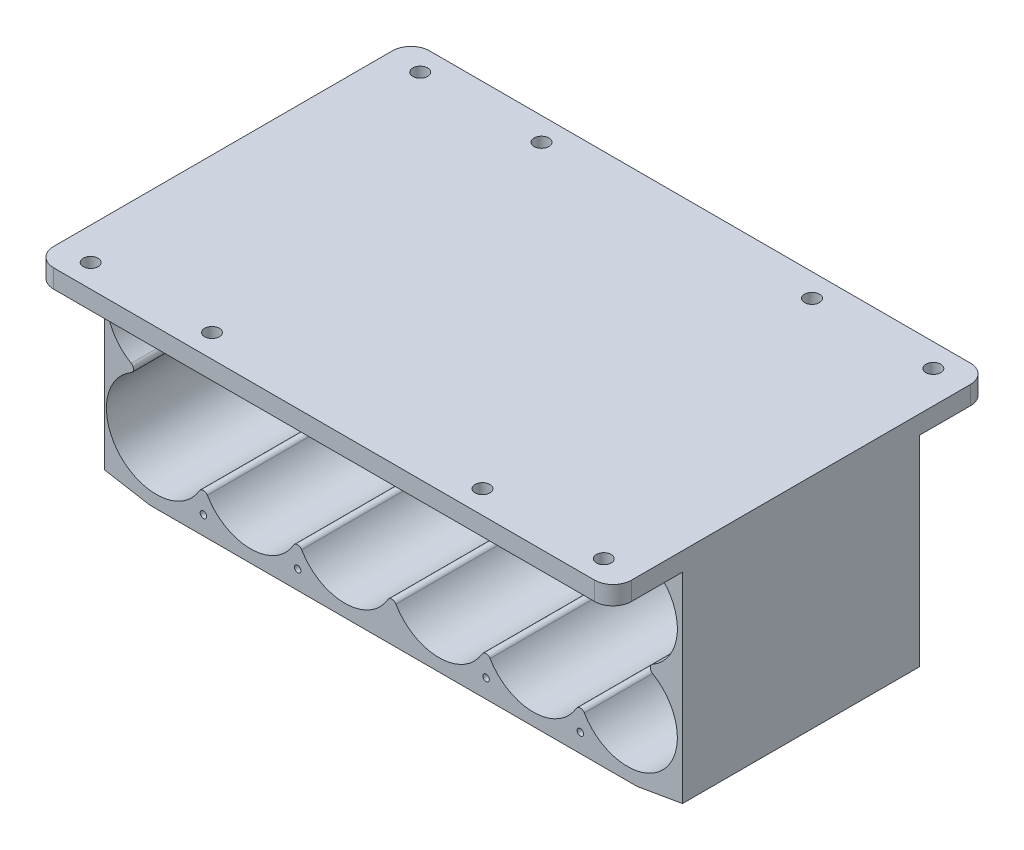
from build123d import *
from build123d.topology import SkipClean

# Parameters (mm, degrees)
SKETCH1_W            = 156
SKETCH1_H            = 65
BOSS_EXTRUDE1_DEPTH  = 1.27
SKETCH2_W            = 65
SKETCH2_H            = 52
BOSS_EXTRUDE2_DEPTH  = 1.27
SKETCH3_W            = 65
SKETCH3_H            = 52
BOSS_EXTRUDE3_DEPTH  = 1.27
BOSS_EXTRUDE4_DEPTH  = 65
BOSS_EXTRUDE5_DEPTH  = 65
BOSS_EXTRUDE6_DEPTH  = 65
FILLET2_R            = 1.27
BOSS_EXTRUDE10_DEPTH = 5.08
FILLET3_R            = 5.08
SKETCH14_R           = 2.032
CUT_EXTRUDE3_DEPTH   = 188.254847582
SKETCH16_R           = 0.889
CUT_EXTRUDE5_DEPTH   = 187.871158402
SKETCH18_W           = 0.332425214
SKETCH18_H           = 3.704166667
SKETCH18_W_2         = 0.332425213
CUT_EXTRUDE7_DEPTH   = 1.016
CUT_EXTRUDE8_DEPTH   = 187.871158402


with BuildPart() as part:
    # Sketch1 → Boss-Extrude1 (new body)
    with BuildSketch(Plane(origin=(0, 0, 0), x_dir=(1, 0, 0), z_dir=(0, 1, 0))):
        with Locations((78, 32.5)):
            Rectangle(SKETCH1_W, SKETCH1_H)
    extrude(amount=BOSS_EXTRUDE1_DEPTH)

    # Sketch2 → Boss-Extrude2 (add)
    with BuildSketch(Plane.ZY):
        with Locations((-32.5, -24.73)):
            Rectangle(SKETCH2_W, SKETCH2_H)
    extrude(amount=BOSS_EXTRUDE2_DEPTH)

    # Sketch3 → Boss-Extrude3 (add)
    with BuildSketch(Plane(origin=(156, 0, 0), x_dir=(0, 0, -1), z_dir=(1, 0, 0))):
        with Locations((32.5, -24.73)):
            Rectangle(SKETCH3_W, SKETCH3_H)
    extrude(amount=BOSS_EXTRUDE3_DEPTH)

    # Sketch5 → Boss-Extrude4 (add)
    with BuildSketch(Plane(origin=(0, 0, -65), x_dir=(-1, 0, 0), z_dir=(0, 0, -1))):
        with BuildLine():
            Line((-69.128148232, 0), (-85.971851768, 0))
            ThreePointArc((-85.971851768, 0), (-80.796829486, -3.246829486), (-77.55, -8.421851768))
            ThreePointArc((-77.55, -8.421851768), (-74.303170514, -3.246829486), (-69.128148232, 0))
        make_face()
        with BuildLine():
            Line((-156, -38.775), (-156, 0))
            Line((-156, 0), (-146.678148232, 0))
            ThreePointArc((-146.678148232, 0), (-153.332252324, -4.997220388), (-155.862, -12.925))
            ThreePointArc((-155.862, -12.925), (-153.332252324, -20.852779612), (-146.678148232, -25.85))
            ThreePointArc((-146.678148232, -25.85), (-153.332252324, -30.847220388), (-155.862, -38.775))
            Line((-155.862, -38.775), (-156, -38.775))
        make_face()
        with BuildLine():
            Line((-120.828148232, 0), (-137.671851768, 0))
            ThreePointArc((-137.671851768, 0), (-132.496829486, -3.246829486), (-129.25, -8.421851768))
            ThreePointArc((-129.25, -8.421851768), (-126.003170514, -3.246829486), (-120.828148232, 0))
        make_face()
        with BuildLine():
            Line((-94.978148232, 0), (-111.821851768, 0))
            ThreePointArc((-111.821851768, 0), (-106.646829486, -3.246829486), (-103.4, -8.421851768))
            ThreePointArc((-103.4, -8.421851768), (-100.153170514, -3.246829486), (-94.978148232, 0))
        make_face()
        with BuildLine():
            Line((-43.278148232, 0), (-60.121851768, 0))
            ThreePointArc((-60.121851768, 0), (-54.946829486, -3.246829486), (-51.7, -8.421851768))
            ThreePointArc((-51.7, -8.421851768), (-48.453170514, -3.246829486), (-43.278148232, 0))
        make_face()
        with BuildLine():
            Line((-17.428148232, 0), (-34.271851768, 0))
            ThreePointArc((-34.271851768, 0), (-29.096829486, -3.246829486), (-25.85, -8.421851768))
            ThreePointArc((-25.85, -8.421851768), (-22.603170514, -3.246829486), (-17.428148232, 0))
        make_face()
        with BuildLine():
            Line((0, -8.421851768), (0, 0))
            Line((0, 0), (-8.421851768, 0))
            ThreePointArc((-8.421851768, 0), (-3.246829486, -3.246829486), (0, -8.421851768))
        make_face()
        with BuildLine():
            Line((0, -34.271851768), (0, -17.428148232))
            ThreePointArc((0, -17.428148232), (-3.246829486, -22.603170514), (-8.421851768, -25.85))
            ThreePointArc((-8.421851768, -25.85), (-3.246829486, -29.096829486), (0, -34.271851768))
        make_face()
    extrude(amount=-BOSS_EXTRUDE4_DEPTH)

    # Sketch6 → Boss-Extrude5 (add)
    with BuildSketch(Plane(origin=(0, 0, -65), x_dir=(-1, 0, 0), z_dir=(0, 0, -1))):
        Polygon((0, -50.73), (-11.43, -52.705), (-144.57, -52.705), (-156, -50.73), (-157.27, -50.73), (-157.27, -53.732604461), (-144.842288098, -55.88), (-11.157711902, -55.88), (1.27, -53.732604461), (1.27, -50.73), align=None)
    extrude(amount=-BOSS_EXTRUDE5_DEPTH)

    # Sketch7 → Boss-Extrude6 (add)
    with BuildSketch(Plane(origin=(0, 0, -65), x_dir=(-1, 0, 0), z_dir=(0, 0, -1))):
        with BuildLine():
            Line((-155.852569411, -39.283), (-155.862, -38.775))
            Line((-155.862, -38.775), (-156, -38.775))
            Line((-156, -38.775), (-156, -50.73))
            Line((-156, -50.73), (-144.57, -52.705))
            Line((-144.57, -52.705), (-11.43, -52.705))
            Line((-11.43, -52.705), (0, -50.73))
            Line((0, -50.73), (0, -43.278148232))
            ThreePointArc((0, -43.278148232), (-12.925, -52.462), (-25.85, -43.278148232))
            ThreePointArc((-25.85, -43.278148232), (-38.775, -52.462), (-51.7, -43.278148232))
            ThreePointArc((-51.7, -43.278148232), (-64.625, -52.462), (-77.55, -43.278148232))
            ThreePointArc((-77.55, -43.278148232), (-90.475, -52.462), (-103.4, -43.278148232))
            ThreePointArc((-103.4, -43.278148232), (-116.325, -52.462), (-129.25, -43.278148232))
            ThreePointArc((-129.25, -43.278148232), (-144.207705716, -52.310216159), (-155.852569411, -39.283))
        make_face()
    extrude(amount=-BOSS_EXTRUDE6_DEPTH)

    # Fillet2
    fillet2_edges = [part.edges().sort_by_distance(p)[0] for p in [
        (129.25, -8.421851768, -32.5),
        (146.678148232, -25.85, -32.5),
        (25.85, -43.278148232, -32.5),
        (129.25, -43.278148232, -32.5),
        (103.4, -43.278148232, -32.5),
        (77.55, -43.278148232, -32.5),
        (51.7, -43.278148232, -32.5),
        (77.55, -8.421851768, -32.5),
        (8.421851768, -25.85, -32.5),
        (25.85, -8.421851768, -32.5),
        (51.7, -8.421851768, -32.5),
        (103.4, -8.421851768, -32.5),
    ]]
    fillet(fillet2_edges, radius=FILLET2_R)

    # Sketch13 → Boss-Extrude10 (add)
    with BuildSketch(Plane(origin=(0, 1.27, 0), x_dir=(1, 0, 0), z_dir=(0, 1, 0))):
        Polygon((-1.27, 65), (-1.27, 84.05), (157.27, 84.05), (157.27, 65), (157.27, 0), (157.27, -19.05), (-1.27, -19.05), (-1.27, 0), align=None)
    extrude(amount=BOSS_EXTRUDE10_DEPTH)

    # Fillet3
    fillet3_edges = [part.edges().sort_by_distance(p)[0] for p in [
        (-1.27, 3.81, -84.05),
        (-1.27, 3.81, 19.05),
        (157.27, 3.81, -84.05),
        (157.27, 3.81, 19.05),
    ]]
    fillet(fillet3_edges, radius=FILLET3_R)

    # Sketch14 → Cut-Extrude3 (cut, through all)
    with BuildSketch(Plane(origin=(0, 1.27, 0), x_dir=(-1, 0, 0), z_dir=(0, -1, 0))):
        with Locations(Location((-148.38, -12.7, 0), (0, 0, 90))):
            Circle(SKETCH14_R)
        with Locations(Location((-7.62, -12.7, 0), (0, 0, 90))):
            Circle(SKETCH14_R)
        with Locations(Location((-115.095, 77.7, 0), (0, 0, 90))):
            Circle(SKETCH14_R)
        with Locations(Location((-40.905, -12.7, 0), (0, 0, 90))):
            Circle(SKETCH14_R)
        with Locations(Location((-115.095, -12.7, 0), (0, 0, 270))):
            Circle(SKETCH14_R)
        with Locations(Location((-40.905, 77.7, 0), (0, 0, 270))):
            Circle(SKETCH14_R)
        with Locations(Location((-7.62, 77.7, 0), (0, 0, 270))):
            Circle(SKETCH14_R)
        with Locations(Location((-148.38, 77.7, 0), (0, 0, 270))):
            Circle(SKETCH14_R)
    extrude(amount=-CUT_EXTRUDE3_DEPTH, mode=Mode.SUBTRACT)

    # Sketch16 → Cut-Extrude5 (cut, through all)
    with BuildSketch(Plane(origin=(0, 0, -65), x_dir=(-1, 0, 0), z_dir=(0, 0, -1))):
        with Locations((-25.85, -50.8)):
            Circle(SKETCH16_R)
        with Locations((-51.7, -50.8)):
            Circle(SKETCH16_R)
        with Locations((-129.25, -1.662604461)):
            Circle(SKETCH16_R)
        with Locations((-103.4, -50.8)):
            Circle(SKETCH16_R)
        with Locations((-129.25, -50.8)):
            Circle(SKETCH16_R)
        with Locations((-103.4, -1.662604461)):
            Circle(SKETCH16_R)
        with Locations((-51.7, -1.662604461)):
            Circle(SKETCH16_R)
        with Locations((-25.85, -1.662604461)):
            Circle(SKETCH16_R)
    extrude(amount=-CUT_EXTRUDE5_DEPTH, mode=Mode.SUBTRACT)

    # Sketch18 → Cut-Extrude7 (cut)
    # profile 1 of 51: a face of its own
    with BuildSketch(Plane(origin=(0, -55.88, 0), x_dir=(-1, 0, 0), z_dir=(0, -1, 0))):
        with BuildLine():
            Line((-24.944102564, 33.25), (-26.183064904, 33.25))
            add(Edge.make_bspline(
                [(-26.183064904, 33.25), (-26.243714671, 33.250313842), (-26.361269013, 33.250922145), (-26.532197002, 33.260575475), (-26.692350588, 33.273408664), (-26.84144676, 33.294935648), (-26.980455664, 33.317256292), (-27.107966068, 33.350017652), (-27.22504603, 33.386203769), (-27.365635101, 33.44188102), (-27.525152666, 33.528348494), (-27.6966042, 33.656587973), (-27.845640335, 33.810336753), (-27.972365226, 33.985545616), (-28.074064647, 34.178295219), (-28.146708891, 34.384438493), (-28.19337832, 34.600507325), (-28.198117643, 34.748642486), (-28.200512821, 34.823507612)],
                knots=[0, 0, 0, 0, 1.00128172, 1.940733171, 2.826250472, 3.653024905, 4.427672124, 5.149348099, 5.824709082, 6.450061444, 7.643590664, 8.808605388, 9.972104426, 11.165284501, 12.367876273, 13.557044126, 14.765369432, 16, 16, 16, 16], degree=3))
            add(Edge.make_bspline(
                [(-28.200512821, 34.823507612), (-28.198556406, 34.893643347), (-28.194711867, 35.031466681), (-28.157153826, 35.232373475), (-28.100460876, 35.424221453), (-28.018649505, 35.605161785), (-27.914333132, 35.773604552), (-27.787416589, 35.926676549), (-27.636928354, 36.061372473), (-27.523940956, 36.136332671), (-27.466548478, 36.174409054)],
                knots=[0, 0, 0, 0, 1.044356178, 2.052258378, 3.035953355, 4.020338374, 5.002448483, 5.980768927, 6.974322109, 8, 8, 8, 8], degree=3))
            add(Edge.make_bspline(
                [(-27.466548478, 36.174409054), (-27.538690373, 36.202091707), (-27.676715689, 36.255055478), (-27.866902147, 36.349057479), (-28.030815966, 36.450515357), (-28.170569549, 36.560172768), (-28.287673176, 36.681610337), (-28.39199379, 36.811629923), (-28.480527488, 36.954759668), (-28.556066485, 37.107898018), (-28.615905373, 37.27023401), (-28.657441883, 37.440553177), (-28.68378447, 37.616926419), (-28.687229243, 37.736798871), (-28.688974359, 37.797526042)],
                knots=[0, 0, 0, 0, 1.272200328, 2.434034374, 3.488177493, 4.442517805, 5.351202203, 6.260825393, 7.183200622, 8.11705787, 9.069326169, 10.026320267, 11.000137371, 12, 12, 12, 12], degree=3))
            add(Edge.make_bspline(
                [(-28.688974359, 37.797526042), (-28.687201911, 37.859514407), (-28.68371457, 37.981478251), (-28.65799048, 38.160649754), (-28.61442217, 38.331867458), (-28.554454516, 38.496271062), (-28.476283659, 38.652897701), (-28.38184514, 38.802978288), (-28.268499, 38.944288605), (-28.140860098, 39.07887924), (-27.998451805, 39.201956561), (-27.841529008, 39.307725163), (-27.674113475, 39.399081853), (-27.49391265, 39.472527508), (-27.302205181, 39.530022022), (-27.098946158, 39.569773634), (-26.884250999, 39.596665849), (-26.736911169, 39.598869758), (-26.66135016, 39.6)],
                knots=[0, 0, 0, 0, 0.978522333, 1.925270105, 2.85076145, 3.763600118, 4.682725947, 5.609499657, 6.557784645, 7.537954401, 8.534920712, 9.522742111, 10.520247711, 11.5409147, 12.58930695, 13.675078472, 14.807699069, 16, 16, 16, 16], degree=3))
            Line((-26.66135016, 39.6), (-24.944102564, 39.6))
            Line((-24.944102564, 39.6), (-24.944102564, 33.25))
        make_face()
        with BuildLine():
            Line((-25.513974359, 33.901282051), (-25.513974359, 35.936538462))
            Line((-25.513974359, 35.936538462), (-25.896856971, 35.936538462))
            add(Edge.make_bspline(
                [(-25.896856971, 35.936538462), (-25.952826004, 35.935818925), (-26.060969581, 35.934428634), (-26.217994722, 35.930320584), (-26.36338672, 35.919321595), (-26.497646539, 35.907688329), (-26.619874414, 35.889775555), (-26.730479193, 35.86785512), (-26.83045555, 35.84487565), (-26.945694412, 35.805682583), (-27.076395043, 35.748365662), (-27.214750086, 35.657236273), (-27.339275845, 35.551728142), (-27.442002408, 35.426579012), (-27.527526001, 35.291429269), (-27.585105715, 35.145271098), (-27.625252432, 34.993141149), (-27.628826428, 34.888224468), (-27.630641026, 34.834955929)],
                knots=[0, 0, 0, 0, 1.156584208, 2.234756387, 3.244705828, 4.168772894, 5.018724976, 5.795346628, 6.498686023, 7.135894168, 8.308330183, 9.43588092, 10.547699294, 11.667188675, 12.76860303, 13.837480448, 14.902040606, 16, 16, 16, 16], degree=3))
            add(Edge.make_bspline(
                [(-27.630641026, 34.834955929), (-27.629756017, 34.799690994), (-27.628019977, 34.730514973), (-27.611653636, 34.629729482), (-27.589068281, 34.533821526), (-27.551819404, 34.445376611), (-27.507689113, 34.361289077), (-27.451124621, 34.284215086), (-27.385900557, 34.212066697), (-27.309857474, 34.146777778), (-27.223306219, 34.08772772), (-27.123505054, 34.038571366), (-27.013167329, 33.994886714), (-26.889992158, 33.961772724), (-26.756433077, 33.933024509), (-26.61045245, 33.914896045), (-26.452930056, 33.903250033), (-26.343788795, 33.901952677), (-26.287371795, 33.901282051)],
                knots=[0, 0, 0, 0, 0.911412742, 1.787835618, 2.63643285, 3.453173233, 4.262886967, 5.08783453, 5.918594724, 6.773969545, 7.67442701, 8.62112486, 9.645634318, 10.739428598, 11.916091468, 13.177237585, 14.540865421, 16, 16, 16, 16], degree=3))
            Line((-26.287371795, 33.901282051), (-25.513974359, 33.901282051))
        make_face(mode=Mode.SUBTRACT)
        with BuildLine():
            Line((-25.513974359, 36.587820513), (-25.513974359, 38.948717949))
            Line((-25.513974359, 38.948717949), (-26.325532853, 38.948717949))
            add(Edge.make_bspline(
                [(-26.325532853, 38.948717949), (-26.383618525, 38.947954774), (-26.495571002, 38.946483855), (-26.657334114, 38.942993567), (-26.806467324, 38.930044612), (-26.94421232, 38.917629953), (-27.06993177, 38.897348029), (-27.18484851, 38.877708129), (-27.286337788, 38.848807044), (-27.405086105, 38.80903864), (-27.537904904, 38.74548346), (-27.6829493, 38.652020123), (-27.810703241, 38.538174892), (-27.919093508, 38.407088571), (-28.009215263, 38.266028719), (-28.071561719, 38.114717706), (-28.111958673, 37.958209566), (-28.116716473, 37.851195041), (-28.119102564, 37.797526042)],
                knots=[0, 0, 0, 0, 1.16016216, 2.236059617, 3.229676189, 4.14889023, 4.996733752, 5.772278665, 6.474820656, 7.101410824, 8.271817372, 9.403828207, 10.537358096, 11.673541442, 12.791884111, 13.865947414, 14.929748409, 16, 16, 16, 16], degree=3))
            add(Edge.make_bspline(
                [(-28.119102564, 37.797526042), (-28.11861549, 37.763968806), (-28.117649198, 37.697395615), (-28.102460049, 37.599650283), (-28.081381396, 37.504497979), (-28.050317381, 37.413231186), (-28.012738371, 37.324278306), (-27.963162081, 37.240533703), (-27.907240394, 37.1584325), (-27.820626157, 37.053415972), (-27.692927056, 36.933879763), (-27.511398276, 36.818308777), (-27.306147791, 36.723594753), (-27.156931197, 36.683554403), (-27.07984976, 36.662870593)],
                knots=[0, 0, 0, 0, 0.723354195, 1.435040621, 2.129761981, 2.824182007, 3.512608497, 4.209435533, 4.920062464, 5.654614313, 7.143585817, 8.671381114, 10.280521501, 12, 12, 12, 12], degree=3))
            add(Edge.make_bspline(
                [(-27.07984976, 36.662870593), (-27.048954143, 36.656601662), (-26.981966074, 36.643009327), (-26.872731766, 36.628670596), (-26.747607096, 36.615808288), (-26.60712687, 36.606543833), (-26.45073238, 36.596598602), (-26.278473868, 36.592868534), (-26.090229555, 36.588315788), (-25.959614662, 36.587989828), (-25.89176883, 36.587820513)],
                knots=[0, 0, 0, 0, 0.634452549, 1.375623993, 2.216454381, 3.166361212, 4.209414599, 5.370755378, 6.634280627, 8, 8, 8, 8], degree=3))
            Line((-25.89176883, 36.587820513), (-25.513974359, 36.587820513))
        make_face(mode=Mode.SUBTRACT)
    # profile 2 of 51: a face of its own
    with BuildSketch(Plane(origin=(0, -55.88, 0), x_dir=(-1, 0, 0), z_dir=(0, -1, 0))):
        Polygon((-32.596666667, 33.25), (-35.527435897, 39.6), (-34.907954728, 39.6), (-33.969192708, 37.56474359), (-31.090576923, 37.56474359), (-30.125102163, 39.6), (-29.503076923, 39.6), (-32.51525641, 33.25), align=None)
        Polygon((-32.549601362, 34.487690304), (-31.39968149, 36.913461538), (-33.668992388, 36.913461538), align=None, mode=Mode.SUBTRACT)
    # profile 3 of 51: a face of its own
    with BuildSketch(Plane(origin=(0, -55.88, 0), x_dir=(-1, 0, 0), z_dir=(0, -1, 0))):
        Polygon((-35.771666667, 33.901282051), (-35.771666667, 33.25), (-39.109487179, 33.25), (-39.109487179, 33.901282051), (-37.725512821, 33.901282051), (-37.725512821, 39.6), (-37.155641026, 39.6), (-37.155641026, 33.901282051), align=None)
    # profile 4 of 51: a face of its own
    with BuildSketch(Plane(origin=(0, -55.88, 0), x_dir=(-1, 0, 0), z_dir=(0, -1, 0))):
        Polygon((-39.516538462, 33.901282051), (-39.516538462, 33.25), (-42.854358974, 33.25), (-42.854358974, 33.901282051), (-41.470384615, 33.901282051), (-41.470384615, 39.6), (-40.900512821, 39.6), (-40.900512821, 33.901282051), align=None)
    # profile 5 of 51: a face of its own
    with BuildSketch(Plane(origin=(0, -55.88, 0), x_dir=(-1, 0, 0), z_dir=(0, -1, 0))):
        Polygon((-43.994102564, 33.25), (-47.576153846, 33.25), (-47.576153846, 33.901282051), (-44.563974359, 33.901282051), (-44.563974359, 35.855128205), (-47.576153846, 35.855128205), (-47.576153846, 36.506410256), (-44.563974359, 36.506410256), (-44.563974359, 38.948717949), (-47.576153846, 38.948717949), (-47.576153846, 39.6), (-43.994102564, 39.6), align=None)
    # profile 6 of 51: a face of its own
    with BuildSketch(Plane(origin=(0, -55.88, 0), x_dir=(-1, 0, 0), z_dir=(0, -1, 0))):
        with BuildLine():
            Line((-48.715897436, 33.25), (-49.986660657, 33.25))
            add(Edge.make_bspline(
                [(-49.986660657, 33.25), (-50.071462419, 33.250282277), (-50.234291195, 33.250824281), (-50.467559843, 33.253846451), (-50.679517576, 33.262508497), (-50.87005357, 33.269962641), (-51.03916433, 33.283555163), (-51.187368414, 33.296546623), (-51.313983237, 33.313553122), (-51.390629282, 33.329347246), (-51.425332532, 33.336498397)],
                knots=[0, 0, 0, 0, 1.410062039, 2.707475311, 3.878576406, 4.937260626, 5.877586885, 6.699081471, 7.410979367, 8, 8, 8, 8], degree=3))
            add(Edge.make_bspline(
                [(-51.425332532, 33.336498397), (-51.471791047, 33.347975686), (-51.56371699, 33.370685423), (-51.696057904, 33.418709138), (-51.822218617, 33.474193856), (-51.941737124, 33.539860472), (-52.054582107, 33.614600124), (-52.160742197, 33.698713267), (-52.258793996, 33.792920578), (-52.352226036, 33.893319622), (-52.433810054, 34.004281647), (-52.507257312, 34.120175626), (-52.568913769, 34.243232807), (-52.61743052, 34.372832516), (-52.658103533, 34.507703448), (-52.685439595, 34.649178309), (-52.702464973, 34.796796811), (-52.704147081, 34.897238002), (-52.705, 34.948167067)],
                knots=[0, 0, 0, 0, 1.027276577, 2.032638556, 3.019345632, 3.985365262, 4.957888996, 5.923693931, 6.890056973, 7.876427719, 8.865527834, 9.843495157, 10.821038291, 11.815616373, 12.812734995, 13.843357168, 14.906466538, 16, 16, 16, 16], degree=3))
            add(Edge.make_bspline(
                [(-52.705, 34.948167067), (-52.702334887, 35.032776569), (-52.697134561, 35.19787162), (-52.648646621, 35.437466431), (-52.56922704, 35.660972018), (-52.459770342, 35.868077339), (-52.320446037, 36.054854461), (-52.153009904, 36.218352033), (-51.958317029, 36.356433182), (-51.776219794, 36.45116902), (-51.615288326, 36.512126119), (-51.482410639, 36.555231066), (-51.337353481, 36.587973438), (-51.182197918, 36.617731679), (-51.015745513, 36.640439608), (-50.838331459, 36.656566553), (-50.649512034, 36.666936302), (-50.520081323, 36.668451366), (-50.453497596, 36.669230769)],
                knots=[0, 0, 0, 0, 1.260402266, 2.459371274, 3.627181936, 4.786749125, 5.93865593, 7.087644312, 8.261344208, 9.485713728, 10.136162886, 10.825977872, 11.566646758, 12.35154167, 13.181268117, 14.0701832, 15.007234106, 16, 16, 16, 16], degree=3))
            Line((-50.453497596, 36.669230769), (-52.786410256, 39.6))
            Line((-52.786410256, 39.6), (-52.081702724, 39.6))
            Line((-52.081702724, 39.6), (-49.748790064, 36.669230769))
            Line((-49.748790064, 36.669230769), (-49.285769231, 36.669230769))
            Line((-49.285769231, 36.669230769), (-49.285769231, 39.6))
            Line((-49.285769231, 39.6), (-48.715897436, 39.6))
            Line((-48.715897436, 39.6), (-48.715897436, 33.25))
        make_face()
        with BuildLine():
            Line((-49.285769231, 33.901282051), (-49.285769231, 36.017948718))
            Line((-49.285769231, 36.017948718), (-50.448409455, 36.026852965))
            add(Edge.make_bspline(
                [(-50.448409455, 36.026852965), (-50.502692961, 36.026876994), (-50.607909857, 36.026923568), (-50.760129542, 36.019677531), (-50.901862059, 36.011435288), (-51.032563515, 35.99882507), (-51.152298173, 35.982583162), (-51.260986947, 35.962235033), (-51.358870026, 35.938628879), (-51.472666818, 35.901718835), (-51.601200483, 35.845762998), (-51.738007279, 35.75899861), (-51.857640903, 35.65406987), (-51.957103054, 35.532568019), (-52.036991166, 35.398404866), (-52.092480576, 35.254616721), (-52.129047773, 35.103469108), (-52.133078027, 34.999688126), (-52.135128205, 34.946895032)],
                knots=[0, 0, 0, 0, 1.146399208, 2.222048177, 3.218135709, 4.144938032, 4.994811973, 5.769438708, 6.479732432, 7.119818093, 8.294689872, 9.430121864, 10.527913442, 11.641375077, 12.733452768, 13.811150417, 14.886538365, 16, 16, 16, 16], degree=3))
            add(Edge.make_bspline(
                [(-52.135128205, 34.946895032), (-52.132974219, 34.895819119), (-52.128705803, 34.794605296), (-52.093062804, 34.646764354), (-52.034863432, 34.506187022), (-51.95520343, 34.374807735), (-51.856058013, 34.256433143), (-51.740575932, 34.155459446), (-51.611474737, 34.071573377), (-51.491789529, 34.016225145), (-51.384030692, 33.983658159), (-51.290900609, 33.960017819), (-51.18475412, 33.943461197), (-51.066840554, 33.928233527), (-50.936641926, 33.915338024), (-50.794078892, 33.906778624), (-50.639253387, 33.901662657), (-50.531943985, 33.901411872), (-50.476394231, 33.901282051)],
                knots=[0, 0, 0, 0, 1.100596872, 2.180981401, 3.259506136, 4.371595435, 5.481727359, 6.576991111, 7.667816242, 8.793363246, 9.406619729, 10.09427138, 10.864108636, 11.721733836, 12.6590937, 13.685439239, 14.801845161, 16, 16, 16, 16], degree=3))
            Line((-50.476394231, 33.901282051), (-49.285769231, 33.901282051))
        make_face(mode=Mode.SUBTRACT)
    # profile 7 of 51: a face of its own
    with BuildSketch(Plane(origin=(0, -55.88, 0), x_dir=(-1, 0, 0), z_dir=(0, -1, 0))):
        Polygon((-53.600512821, 33.25), (-54.253066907, 33.25), (-55.921977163, 35.978515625), (-57.588343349, 33.25), (-58.240897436, 33.25), (-56.205641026, 36.581460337), (-56.205641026, 39.6), (-55.635769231, 39.6), (-55.635769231, 36.581460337), align=None)
    # profile 8 of 51: a face of its own
    with BuildSketch(Plane(origin=(0, -55.88, 0), x_dir=(-1, 0, 0), z_dir=(0, -1, 0))):
        Polygon((-61.415897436, 39.6), (-62.25416867, 33.25), (-62.335578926, 33.25), (-64.95724359, 38.46025641), (-67.572548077, 33.25), (-67.655230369, 33.25), (-68.498589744, 39.6), (-67.926173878, 39.6), (-67.318141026, 35.030849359), (-65.025933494, 39.6), (-64.897457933, 39.6), (-62.596346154, 35.020673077), (-61.989585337, 39.6), align=None)
    # profile 9 of 51: a face of its own
    with BuildSketch(Plane(origin=(0, -55.88, 0), x_dir=(-1, 0, 0), z_dir=(0, -1, 0))):
        with BuildLine():
            add(Edge.make_bspline(
                [(-72.772628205, 33.087179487), (-72.890221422, 33.090107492), (-73.121184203, 33.095858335), (-73.460313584, 33.141332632), (-73.785043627, 33.21618062), (-74.095568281, 33.321874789), (-74.390679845, 33.458919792), (-74.671311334, 33.625295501), (-74.93649814, 33.822637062), (-75.185554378, 34.046259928), (-75.411922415, 34.292068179), (-75.60889929, 34.555960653), (-75.776544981, 34.832625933), (-75.913517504, 35.123865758), (-76.021145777, 35.428379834), (-76.09537271, 35.747982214), (-76.142798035, 36.080550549), (-76.148341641, 36.307385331), (-76.151153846, 36.422455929)],
                knots=[0, 0, 0, 0, 1.065027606, 2.091802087, 3.093458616, 4.079833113, 5.057734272, 6.036020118, 7.030157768, 8.047461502, 9.064242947, 10.052216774, 11.02588392, 11.989864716, 12.962978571, 13.945936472, 14.957997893, 16, 16, 16, 16], degree=3))
            add(Edge.make_bspline(
                [(-76.151153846, 36.422455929), (-76.148340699, 36.536678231), (-76.14279566, 36.761823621), (-76.095334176, 37.092290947), (-76.020814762, 37.409929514), (-75.914848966, 37.714000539), (-75.777775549, 38.004653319), (-75.609866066, 38.281512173), (-75.413331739, 38.546174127), (-75.18789182, 38.793178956), (-74.941709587, 39.019567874), (-74.679447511, 39.219699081), (-74.401422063, 39.386419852), (-74.11197254, 39.525439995), (-73.808218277, 39.630729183), (-73.492301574, 39.707455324), (-73.162431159, 39.754402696), (-72.937723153, 39.759983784), (-72.823509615, 39.762820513)],
                knots=[0, 0, 0, 0, 1.043683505, 2.0572211, 3.045299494, 4.022276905, 4.994977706, 5.977452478, 6.97747046, 8.003698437, 9.029677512, 10.031249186, 11.013723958, 11.988083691, 12.9614021, 13.946617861, 14.956316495, 16, 16, 16, 16], degree=3))
            add(Edge.make_bspline(
                [(-72.823509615, 39.762820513), (-72.708439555, 39.76000986), (-72.481605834, 39.754469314), (-72.148620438, 39.706963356), (-71.828790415, 39.63270397), (-71.523100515, 39.526478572), (-71.231450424, 39.38971154), (-70.953868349, 39.221645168), (-70.690020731, 39.023602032), (-70.442592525, 38.798339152), (-70.216476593, 38.552628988), (-70.017594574, 38.290711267), (-69.850497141, 38.015076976), (-69.713672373, 37.726862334), (-69.605449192, 37.426812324), (-69.531592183, 37.11303952), (-69.483813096, 36.787302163), (-69.478306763, 36.56551881), (-69.475512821, 36.452984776)],
                knots=[0, 0, 0, 0, 1.053167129, 2.076072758, 3.073341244, 4.055601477, 5.033424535, 6.017524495, 7.021518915, 8.049444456, 9.077120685, 10.074910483, 11.055688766, 12.022980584, 12.991883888, 13.970269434, 14.970104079, 16, 16, 16, 16], degree=3))
            add(Edge.make_bspline(
                [(-69.475512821, 36.452984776), (-69.476481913, 36.377450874), (-69.478407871, 36.227335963), (-69.501628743, 36.004425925), (-69.535255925, 35.785076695), (-69.583701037, 35.570025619), (-69.646191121, 35.359237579), (-69.72319955, 35.153143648), (-69.811451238, 34.95004622), (-69.916527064, 34.753810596), (-70.031167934, 34.564128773), (-70.156172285, 34.383372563), (-70.292411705, 34.21477076), (-70.437940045, 34.055614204), (-70.594771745, 33.908619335), (-70.760546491, 33.770581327), (-70.936131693, 33.642929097), (-71.121805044, 33.528343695), (-71.312832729, 33.423095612), (-71.510600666, 33.335222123), (-71.710936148, 33.257553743), (-71.91560381, 33.195830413), (-72.124130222, 33.146710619), (-72.336776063, 33.113334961), (-72.553322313, 33.090062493), (-72.699211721, 33.088144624), (-72.772628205, 33.087179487)],
                knots=[0, 0, 0, 0, 1.037115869, 2.061148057, 3.07517727, 4.084041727, 5.086514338, 6.092668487, 7.104487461, 8.125783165, 9.147610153, 10.147694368, 11.141876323, 12.122903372, 13.107606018, 14.091946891, 15.084523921, 16.086505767, 17.087268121, 18.077809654, 19.05670789, 20.036870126, 21.011670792, 21.99694167, 22.991993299, 24, 24, 24, 24], degree=3))
        make_face()
        with BuildLine():
            add(Edge.make_bspline(
                [(-72.800612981, 33.738461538), (-72.740351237, 33.739193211), (-72.620403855, 33.740649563), (-72.442101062, 33.759952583), (-72.26607939, 33.787240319), (-72.092725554, 33.82697312), (-71.921884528, 33.877883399), (-71.753366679, 33.940750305), (-71.587021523, 34.01414316), (-71.424370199, 34.099335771), (-71.268010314, 34.194827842), (-71.11700236, 34.295508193), (-70.977113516, 34.407083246), (-70.845641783, 34.525415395), (-70.722906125, 34.65213391), (-70.608890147, 34.786305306), (-70.503706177, 34.928537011), (-70.40861501, 35.078236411), (-70.323991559, 35.234569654), (-70.248224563, 35.394547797), (-70.185416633, 35.560051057), (-70.13566339, 35.730046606), (-70.093434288, 35.903785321), (-70.066945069, 36.082213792), (-70.047457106, 36.264716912), (-70.046080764, 36.388056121), (-70.045384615, 36.450440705)],
                knots=[0, 0, 0, 0, 1.008431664, 2.007222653, 2.999229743, 3.989431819, 4.982149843, 5.98167215, 6.998687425, 8.024288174, 9.053028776, 10.065052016, 11.06063401, 12.045759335, 13.024701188, 14.011819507, 14.991481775, 15.984022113, 16.97831254, 17.965966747, 18.945551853, 19.938269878, 20.93007375, 21.936103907, 22.956087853, 24, 24, 24, 24], degree=3))
            add(Edge.make_bspline(
                [(-70.045384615, 36.450440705), (-70.047702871, 36.542172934), (-70.052263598, 36.722638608), (-70.092025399, 36.987133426), (-70.153759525, 37.24157162), (-70.243262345, 37.48443664), (-70.357440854, 37.716811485), (-70.496715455, 37.937791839), (-70.662361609, 38.147312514), (-70.850410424, 38.343813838), (-71.056036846, 38.52309698), (-71.274277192, 38.680687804), (-71.503404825, 38.813320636), (-71.742099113, 38.924198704), (-71.992397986, 39.007729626), (-72.252696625, 39.067287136), (-72.523000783, 39.10588805), (-72.7071974, 39.109637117), (-72.800612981, 39.111538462)],
                knots=[0, 0, 0, 0, 1.032022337, 2.030307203, 3.003823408, 3.974715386, 4.937372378, 5.913284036, 6.909147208, 7.938749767, 8.970518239, 9.975863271, 10.963918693, 11.946286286, 12.933361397, 13.927862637, 14.949112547, 16, 16, 16, 16], degree=3))
            add(Edge.make_bspline(
                [(-72.800612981, 39.111538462), (-72.863404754, 39.110676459), (-72.987939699, 39.10896685), (-73.1731665, 39.091723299), (-73.3550736, 39.064126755), (-73.533324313, 39.024196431), (-73.708154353, 38.974885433), (-73.879028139, 38.913710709), (-74.04591912, 38.840412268), (-74.209534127, 38.758592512), (-74.36632927, 38.666315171), (-74.514523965, 38.564924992), (-74.655092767, 38.457136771), (-74.78632453, 38.339661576), (-74.908547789, 38.214011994), (-75.020526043, 38.079272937), (-75.12566097, 37.938106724), (-75.220085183, 37.788445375), (-75.305869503, 37.633349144), (-75.379410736, 37.472905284), (-75.442254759, 37.308129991), (-75.492904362, 37.138860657), (-75.532616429, 36.965489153), (-75.559974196, 36.787764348), (-75.579112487, 36.606046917), (-75.580554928, 36.483140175), (-75.581282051, 36.421183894)],
                knots=[0, 0, 0, 0, 1.047362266, 2.077233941, 3.100744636, 4.115120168, 5.122788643, 6.129711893, 7.140355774, 8.162227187, 9.180148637, 10.17298275, 11.156396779, 12.133377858, 13.108923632, 14.078087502, 15.054351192, 16.043448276, 17.028082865, 18.009331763, 18.985518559, 19.968016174, 20.954783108, 21.950335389, 22.966780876, 24, 24, 24, 24], degree=3))
            add(Edge.make_bspline(
                [(-75.581282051, 36.421183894), (-75.580554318, 36.359651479), (-75.579110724, 36.2375906), (-75.559983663, 36.057140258), (-75.532586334, 35.880695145), (-75.493102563, 35.708947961), (-75.442211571, 35.54185492), (-75.379460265, 35.379572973), (-75.305464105, 35.221497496), (-75.220540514, 35.068019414), (-75.125080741, 34.920744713), (-75.020768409, 34.779953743), (-74.905810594, 34.648278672), (-74.783461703, 34.522513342), (-74.65078023, 34.405173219), (-74.507742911, 34.296712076), (-74.357911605, 34.192241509), (-74.197896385, 34.099788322), (-74.033352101, 34.01396372), (-73.864338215, 33.940803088), (-73.692968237, 33.877604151), (-73.519013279, 33.827192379), (-73.34277384, 33.787201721), (-73.164200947, 33.759962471), (-72.983360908, 33.740647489), (-72.861722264, 33.739192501), (-72.800612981, 33.738461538)],
                knots=[0, 0, 0, 0, 1.02988216, 2.042960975, 3.035124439, 4.018561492, 4.99104521, 5.957523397, 6.929462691, 7.91146347, 8.892205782, 9.866320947, 10.842813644, 11.816825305, 12.802668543, 13.805243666, 14.821427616, 15.858893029, 16.897256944, 17.927432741, 18.940436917, 19.95373962, 20.957947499, 21.96413624, 22.977215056, 24, 24, 24, 24], degree=3))
        make_face(mode=Mode.SUBTRACT)
    # profile 10 of 51: a face of its own
    with BuildSketch(Plane(origin=(0, -55.88, 0), x_dir=(-1, 0, 0), z_dir=(0, -1, 0))):
        with BuildLine():
            Line((-77.453717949, 39.6), (-77.453717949, 33.25))
            Line((-77.453717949, 33.25), (-78.735929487, 33.25))
            add(Edge.make_bspline(
                [(-78.735929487, 33.25), (-78.847452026, 33.25080076), (-79.062912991, 33.252347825), (-79.374263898, 33.262213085), (-79.661932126, 33.279488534), (-79.925754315, 33.305137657), (-80.166154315, 33.335923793), (-80.382747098, 33.375076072), (-80.575883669, 33.421121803), (-80.694663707, 33.460394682), (-80.750833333, 33.478966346)],
                knots=[0, 0, 0, 0, 1.314317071, 2.539253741, 3.67075822, 4.709970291, 5.662644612, 6.526156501, 7.303037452, 8, 8, 8, 8], degree=3))
            add(Edge.make_bspline(
                [(-80.750833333, 33.478966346), (-80.82430893, 33.506953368), (-80.969593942, 33.562292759), (-81.176340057, 33.666842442), (-81.371628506, 33.784817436), (-81.553917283, 33.918922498), (-81.723608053, 34.067443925), (-81.882835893, 34.229180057), (-82.027036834, 34.408448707), (-82.161184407, 34.599687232), (-82.278598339, 34.804635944), (-82.382134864, 35.019189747), (-82.470539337, 35.242932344), (-82.539518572, 35.477496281), (-82.596507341, 35.720628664), (-82.634745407, 35.974170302), (-82.660145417, 36.236643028), (-82.662685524, 36.414761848), (-82.663974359, 36.505138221)],
                knots=[0, 0, 0, 0, 0.984696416, 1.947063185, 2.89840987, 3.841051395, 4.778753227, 5.721858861, 6.681155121, 7.65838316, 8.646299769, 9.637283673, 10.641736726, 11.657050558, 12.698485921, 13.768600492, 14.86780186, 16, 16, 16, 16], degree=3))
            add(Edge.make_bspline(
                [(-82.663974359, 36.505138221), (-82.662832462, 36.583626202), (-82.660582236, 36.738294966), (-82.640401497, 36.966247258), (-82.611012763, 37.187419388), (-82.565721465, 37.400840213), (-82.510068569, 37.607946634), (-82.441378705, 37.807758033), (-82.359963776, 38.000410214), (-82.265545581, 38.184372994), (-82.162161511, 38.359199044), (-82.049507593, 38.522118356), (-81.931441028, 38.674927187), (-81.803655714, 38.814173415), (-81.670382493, 38.94419321), (-81.527088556, 39.059218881), (-81.378260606, 39.164590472), (-81.219427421, 39.257108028), (-81.049285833, 39.339405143), (-80.863391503, 39.408905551), (-80.662422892, 39.468715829), (-80.445048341, 39.516368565), (-80.211992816, 39.554779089), (-79.962624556, 39.580358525), (-79.697410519, 39.597704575), (-79.515293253, 39.599220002), (-79.42155649, 39.6)],
                knots=[0, 0, 0, 0, 1.105894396, 2.179280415, 3.222964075, 4.248423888, 5.251546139, 6.243661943, 7.223682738, 8.196462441, 9.155694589, 10.083899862, 10.986397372, 11.874737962, 12.745335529, 13.607670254, 14.461432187, 15.313100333, 16.195087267, 17.121790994, 18.106827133, 19.14775296, 20.255889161, 21.433815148, 22.679170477, 24, 24, 24, 24], degree=3))
            Line((-79.42155649, 39.6), (-77.453717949, 39.6))
        make_face()
        with BuildLine():
            Line((-78.023589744, 38.948717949), (-78.752465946, 38.948717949))
            add(Edge.make_bspline(
                [(-78.752465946, 38.948717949), (-78.857201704, 38.948267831), (-79.058646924, 38.94740209), (-79.348312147, 38.939805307), (-79.612979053, 38.927392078), (-79.85268522, 38.910020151), (-80.067295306, 38.887035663), (-80.257257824, 38.861409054), (-80.421950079, 38.82948225), (-80.521607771, 38.800542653), (-80.567660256, 38.787169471)],
                knots=[0, 0, 0, 0, 1.375205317, 2.645023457, 3.804390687, 4.853969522, 5.800190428, 6.637939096, 7.370582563, 8, 8, 8, 8], degree=3))
            add(Edge.make_bspline(
                [(-80.567660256, 38.787169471), (-80.625624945, 38.766757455), (-80.740169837, 38.726420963), (-80.905036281, 38.652815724), (-81.058875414, 38.56573505), (-81.204251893, 38.468366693), (-81.340231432, 38.359207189), (-81.466184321, 38.237909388), (-81.583105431, 38.105877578), (-81.689122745, 37.962666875), (-81.785006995, 37.809866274), (-81.867850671, 37.64764598), (-81.937686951, 37.476916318), (-81.994982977, 37.298271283), (-82.03965423, 37.111604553), (-82.07110455, 36.916447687), (-82.090593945, 36.712877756), (-82.092920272, 36.574296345), (-82.094102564, 36.503866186)],
                knots=[0, 0, 0, 0, 0.998420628, 1.972994, 2.929372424, 3.86770908, 4.81360496, 5.759023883, 6.706048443, 7.676227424, 8.651287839, 9.634325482, 10.632389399, 11.645655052, 12.680158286, 13.74837235, 14.855672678, 16, 16, 16, 16], degree=3))
            add(Edge.make_bspline(
                [(-82.094102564, 36.503866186), (-82.093170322, 36.429601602), (-82.091338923, 36.28370817), (-82.068358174, 36.069633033), (-82.034703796, 35.86376955), (-81.9862946, 35.665969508), (-81.923754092, 35.47649025), (-81.848919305, 35.294261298), (-81.758058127, 35.121627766), (-81.655193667, 34.957127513), (-81.539709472, 34.803251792), (-81.412117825, 34.661803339), (-81.273764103, 34.532518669), (-81.125285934, 34.41519194), (-80.964607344, 34.311909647), (-80.79444733, 34.220031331), (-80.612408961, 34.141966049), (-80.4857464, 34.100460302), (-80.421376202, 34.079366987)],
                knots=[0, 0, 0, 0, 1.122272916, 2.204715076, 3.251197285, 4.274229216, 5.279697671, 6.265416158, 7.248880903, 8.225321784, 9.195852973, 10.153576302, 11.101466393, 12.055578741, 13.010401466, 13.985536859, 14.976245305, 16, 16, 16, 16], degree=3))
            add(Edge.make_bspline(
                [(-80.421376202, 34.079366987), (-80.368124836, 34.064641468), (-80.254897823, 34.033330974), (-80.070131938, 33.99917637), (-79.86218731, 33.969051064), (-79.630140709, 33.943545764), (-79.374256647, 33.925244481), (-79.094338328, 33.911507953), (-78.79026476, 33.902243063), (-78.579476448, 33.901610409), (-78.470074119, 33.901282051)],
                knots=[0, 0, 0, 0, 0.674548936, 1.434276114, 2.292660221, 3.240891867, 4.284742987, 5.42552168, 6.663806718, 8, 8, 8, 8], degree=3))
            Line((-78.470074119, 33.901282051), (-78.023589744, 33.901282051))
            Line((-78.023589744, 33.901282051), (-78.023589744, 38.948717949))
        make_face(mode=Mode.SUBTRACT)
    # profile 11 of 51: a face of its own
    with BuildSketch(Plane(origin=(0, -55.88, 0), x_dir=(-1, 0, 0), z_dir=(0, -1, 0))):
        with BuildLine():
            Line((-83.966538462, 33.25), (-84.536410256, 33.25))
            Line((-84.536410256, 33.25), (-84.536410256, 37.054657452))
            add(Edge.make_bspline(
                [(-84.536410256, 37.054657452), (-84.536325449, 37.108506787), (-84.536164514, 37.210695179), (-84.537239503, 37.356143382), (-84.540250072, 37.485451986), (-84.542148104, 37.599119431), (-84.546370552, 37.69662413), (-84.549814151, 37.778494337), (-84.554242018, 37.84434239), (-84.559563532, 37.882770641), (-84.561850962, 37.899288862)],
                knots=[0, 0, 0, 0, 1.528628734, 2.90083645, 4.128790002, 5.200304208, 6.127813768, 6.898992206, 7.526736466, 8, 8, 8, 8], degree=3))
            add(Edge.make_bspline(
                [(-84.561850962, 37.899288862), (-84.571128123, 37.95934447), (-84.589037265, 38.075279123), (-84.636790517, 38.240167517), (-84.699932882, 38.389561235), (-84.780402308, 38.525129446), (-84.879651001, 38.647825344), (-85.002104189, 38.758828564), (-85.147509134, 38.858458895), (-85.3125596, 38.945852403), (-85.488529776, 39.018334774), (-85.668980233, 39.072596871), (-85.850463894, 39.105799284), (-85.971980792, 39.109634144), (-86.032323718, 39.111538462)],
                knots=[0, 0, 0, 0, 1.042923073, 2.013316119, 2.939979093, 3.821796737, 4.712412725, 5.640305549, 6.650442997, 7.732186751, 8.842579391, 9.91407549, 10.964170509, 12, 12, 12, 12], degree=3))
            add(Edge.make_bspline(
                [(-86.032323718, 39.111538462), (-86.08413301, 39.109601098), (-86.187452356, 39.10573756), (-86.340883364, 39.081515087), (-86.490795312, 39.038729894), (-86.635978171, 38.980417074), (-86.774192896, 38.908822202), (-86.901723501, 38.822459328), (-87.017226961, 38.723327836), (-87.121389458, 38.611892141), (-87.212053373, 38.48746937), (-87.290101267, 38.350707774), (-87.353870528, 38.200516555), (-87.385905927, 38.094670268), (-87.402305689, 38.040484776)],
                knots=[0, 0, 0, 0, 0.994543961, 1.983343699, 2.972712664, 3.980751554, 4.981834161, 5.954730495, 6.930176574, 7.89761099, 8.875938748, 9.87834379, 10.913868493, 12, 12, 12, 12], degree=3))
            add(Edge.make_bspline(
                [(-87.402305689, 38.040484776), (-87.407748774, 38.018080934), (-87.419878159, 37.968156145), (-87.431212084, 37.883753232), (-87.44301678, 37.784168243), (-87.4512075, 37.668685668), (-87.459192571, 37.537692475), (-87.463969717, 37.390506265), (-87.466177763, 37.227661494), (-87.466835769, 37.114019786), (-87.467179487, 37.054657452)],
                knots=[0, 0, 0, 0, 0.558680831, 1.244966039, 2.062412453, 2.990489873, 4.051219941, 5.244515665, 6.560634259, 8, 8, 8, 8], degree=3))
            Line((-87.467179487, 37.054657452), (-87.467179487, 33.25))
            Line((-87.467179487, 33.25), (-88.037051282, 33.25))
            Line((-88.037051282, 33.25), (-88.037051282, 37.085186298))
            add(Edge.make_bspline(
                [(-88.037051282, 37.085186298), (-88.036595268, 37.154308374), (-88.035705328, 37.289204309), (-88.027832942, 37.486863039), (-88.015639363, 37.674410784), (-87.997220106, 37.851611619), (-87.976839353, 38.018664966), (-87.947925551, 38.174958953), (-87.917176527, 38.321819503), (-87.878586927, 38.459517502), (-87.832682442, 38.59013063), (-87.778016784, 38.716125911), (-87.711437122, 38.836369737), (-87.636073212, 38.953066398), (-87.550382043, 39.065140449), (-87.455094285, 39.17346157), (-87.348684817, 39.276605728), (-87.233835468, 39.37506604), (-87.111478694, 39.467282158), (-86.980241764, 39.545796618), (-86.84247385, 39.612244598), (-86.699636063, 39.668840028), (-86.549314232, 39.710225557), (-86.393380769, 39.741297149), (-86.230739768, 39.758874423), (-86.120133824, 39.761493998), (-86.064124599, 39.762820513)],
                knots=[0, 0, 0, 0, 1.316485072, 2.56920066, 3.767172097, 4.895413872, 5.962239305, 6.971350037, 7.921780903, 8.819233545, 9.69278517, 10.557066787, 11.431700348, 12.307563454, 13.200791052, 14.11626757, 15.05287325, 16.020813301, 16.99640464, 17.967304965, 18.928075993, 19.907403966, 20.889159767, 21.893313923, 22.933205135, 24, 24, 24, 24], degree=3))
            add(Edge.make_bspline(
                [(-86.064124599, 39.762820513), (-86.003038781, 39.761397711), (-85.883188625, 39.758606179), (-85.706595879, 39.742585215), (-85.537274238, 39.712485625), (-85.373571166, 39.673911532), (-85.217068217, 39.621579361), (-85.067811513, 39.557277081), (-84.924087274, 39.483866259), (-84.789133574, 39.397119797), (-84.661843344, 39.30252862), (-84.54616563, 39.198630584), (-84.439163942, 39.089382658), (-84.345554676, 38.970671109), (-84.261797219, 38.84492607), (-84.189737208, 38.711556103), (-84.127840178, 38.570739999), (-84.09589763, 38.472852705), (-84.079749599, 38.423367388)],
                knots=[0, 0, 0, 0, 1.138939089, 2.234594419, 3.301501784, 4.342532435, 5.367382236, 6.373123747, 7.370098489, 8.372230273, 9.360297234, 10.323289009, 11.268038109, 12.20748145, 13.137029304, 14.081414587, 15.030090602, 16, 16, 16, 16], degree=3))
            add(Edge.make_bspline(
                [(-84.079749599, 38.423367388), (-84.070356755, 38.389562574), (-84.049983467, 38.316239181), (-84.028166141, 38.19488798), (-84.009825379, 38.055160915), (-83.992579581, 37.897048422), (-83.982403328, 37.720427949), (-83.973481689, 37.525376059), (-83.96647561, 37.3116569), (-83.966516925, 37.162786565), (-83.966538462, 37.085186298)],
                knots=[0, 0, 0, 0, 0.625038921, 1.35572334, 2.194682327, 3.136881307, 4.189498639, 5.346923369, 6.617055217, 8, 8, 8, 8], degree=3))
            Line((-83.966538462, 37.085186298), (-83.966538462, 33.25))
        make_face()
    # profile 12 of 51: a face of its own
    with BuildSketch(Plane(origin=(0, -55.88, 0), x_dir=(-1, 0, 0), z_dir=(0, -1, 0))):
        Polygon((-89.746666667, 33.25), (-90.316538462, 33.25), (-90.316538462, 38.948717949), (-92.758846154, 38.948717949), (-92.758846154, 39.6), (-89.746666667, 39.6), align=None)
    # profile 13 of 51: a face of its own
    with BuildSketch(Plane(origin=(0, -55.88, 0), x_dir=(-1, 0, 0), z_dir=(0, -1, 0))):
        Polygon((-93.817179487, 33.25), (-97.399230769, 33.25), (-97.399230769, 33.901282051), (-94.387051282, 33.901282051), (-94.387051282, 35.855128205), (-97.399230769, 35.855128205), (-97.399230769, 36.506410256), (-94.387051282, 36.506410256), (-94.387051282, 38.948717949), (-97.399230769, 38.948717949), (-97.399230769, 39.6), (-93.817179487, 39.6), align=None)
    # profile 14 of 51: a face of its own
    with BuildSketch(Plane(origin=(0, -55.88, 0), x_dir=(-1, 0, 0), z_dir=(0, -1, 0))):
        Polygon((-101.761039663, 33.25), (-102.935128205, 33.25), (-102.935128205, 39.6), (-102.36525641, 39.6), (-102.36525641, 33.901282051), (-101.388333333, 33.901282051), align=None)
    # profile 15 of 51: a face of its own
    with BuildSketch(Plane(origin=(0, -55.88, 0), x_dir=(-1, 0, 0), z_dir=(0, -1, 0))):
        with BuildLine():
            add(Edge.make_bspline(
                [(-105.296025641, 36.427544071), (-105.29662076, 36.325767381), (-105.297776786, 36.128064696), (-105.310637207, 35.839983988), (-105.332001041, 35.569727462), (-105.361278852, 35.317282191), (-105.396907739, 35.082582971), (-105.444470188, 34.866257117), (-105.498558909, 34.667303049), (-105.561247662, 34.485073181), (-105.631980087, 34.317108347), (-105.708977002, 34.160316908), (-105.795241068, 34.014886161), (-105.886028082, 33.878673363), (-105.984515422, 33.753049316), (-106.090360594, 33.638578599), (-106.202631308, 33.533487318), (-106.321858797, 33.439503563), (-106.446906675, 33.357609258), (-106.574075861, 33.283373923), (-106.706993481, 33.224651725), (-106.842381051, 33.174437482), (-106.981329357, 33.134661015), (-107.123898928, 33.10699336), (-107.270217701, 33.089683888), (-107.368970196, 33.088022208), (-107.419052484, 33.087179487)],
                knots=[0, 0, 0, 0, 1.64625301, 3.197870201, 4.6634513, 6.030635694, 7.308242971, 8.501545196, 9.611429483, 10.641742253, 11.616230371, 12.55791849, 13.464870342, 14.34944951, 15.20427819, 16.044004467, 16.869007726, 17.689551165, 18.496129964, 19.285613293, 20.0683943, 20.843080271, 21.620342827, 22.403213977, 23.190190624, 24, 24, 24, 24], degree=3))
            add(Edge.make_bspline(
                [(-107.419052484, 33.087179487), (-107.469578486, 33.087880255), (-107.570107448, 33.089274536), (-107.718198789, 33.10889988), (-107.863710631, 33.13423088), (-108.004435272, 33.174857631), (-108.143033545, 33.223472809), (-108.276058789, 33.287619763), (-108.408207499, 33.357384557), (-108.533476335, 33.442491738), (-108.655608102, 33.536549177), (-108.770093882, 33.643328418), (-108.879860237, 33.759874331), (-108.980761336, 33.888786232), (-109.077121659, 34.02808752), (-109.165283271, 34.178945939), (-109.247079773, 34.341027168), (-109.324048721, 34.513579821), (-109.391356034, 34.701213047), (-109.451197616, 34.90275653), (-109.500247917, 35.12003534), (-109.540811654, 35.351839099), (-109.572296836, 35.599316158), (-109.595211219, 35.861965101), (-109.607319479, 36.139950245), (-109.609599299, 36.330010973), (-109.610769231, 36.427544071)],
                knots=[0, 0, 0, 0, 0.810910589, 1.61342667, 2.396193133, 3.181089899, 3.963115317, 4.752255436, 5.550715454, 6.36105385, 7.181178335, 8.024612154, 8.872680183, 9.750181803, 10.651284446, 11.591556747, 12.554036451, 13.566402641, 14.62422919, 15.753422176, 16.94128843, 18.199818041, 19.531985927, 20.947085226, 22.433341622, 24, 24, 24, 24], degree=3))
            add(Edge.make_bspline(
                [(-109.610769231, 36.427544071), (-109.609572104, 36.52465052), (-109.607234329, 36.714282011), (-109.595486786, 36.991034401), (-109.571682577, 37.252250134), (-109.542669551, 37.498307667), (-109.500838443, 37.72888536), (-109.45426792, 37.945221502), (-109.394864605, 38.145283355), (-109.329153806, 38.331308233), (-109.253255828, 38.503129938), (-109.172075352, 38.664542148), (-109.082597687, 38.814544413), (-108.988086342, 38.954728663), (-108.885274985, 39.082534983), (-108.776994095, 39.200384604), (-108.661397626, 39.307349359), (-108.538637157, 39.402517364), (-108.412184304, 39.488265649), (-108.280009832, 39.560518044), (-108.145207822, 39.623507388), (-108.00637616, 39.674143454), (-107.864400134, 39.714171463), (-107.718768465, 39.741420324), (-107.570087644, 39.76062734), (-107.469571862, 39.762086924), (-107.419052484, 39.762820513)],
                knots=[0, 0, 0, 0, 1.561431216, 3.049195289, 4.452146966, 5.778046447, 7.031138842, 8.218704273, 9.334037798, 10.384210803, 11.388620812, 12.352076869, 13.287433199, 14.19507451, 15.06813243, 15.922055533, 16.766344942, 17.596869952, 18.417486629, 19.220035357, 20.016159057, 20.807716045, 21.59340902, 22.384936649, 23.188266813, 24, 24, 24, 24], degree=3))
            add(Edge.make_bspline(
                [(-107.419052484, 39.762820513), (-107.368971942, 39.761970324), (-107.270222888, 39.760293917), (-107.123878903, 39.743092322), (-106.98151605, 39.715042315), (-106.842849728, 39.67695055), (-106.707596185, 39.628538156), (-106.577080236, 39.566959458), (-106.449578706, 39.495537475), (-106.325671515, 39.414282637), (-106.207727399, 39.321162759), (-106.095043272, 39.218189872), (-105.990568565, 39.10271025), (-105.892760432, 38.976567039), (-105.801220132, 38.840011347), (-105.715321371, 38.69346725), (-105.638558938, 38.535148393), (-105.566222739, 38.366271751), (-105.502457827, 38.182702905), (-105.446779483, 37.983067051), (-105.399837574, 37.766002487), (-105.362447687, 37.531498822), (-105.331817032, 37.279919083), (-105.310658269, 37.010862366), (-105.297783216, 36.724904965), (-105.29662219, 36.528473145), (-105.296025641, 36.427544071)],
                knots=[0, 0, 0, 0, 0.810976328, 1.599087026, 2.383086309, 3.159618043, 3.926613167, 4.707144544, 5.494386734, 6.292609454, 7.104690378, 7.92621526, 8.762510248, 9.62398222, 10.509836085, 11.424023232, 12.373226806, 13.358118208, 14.398657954, 15.5185989, 16.713620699, 17.994156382, 19.364120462, 20.818119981, 22.365111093, 24, 24, 24, 24], degree=3))
        make_face()
        with BuildLine():
            add(Edge.make_bspline(
                [(-105.865897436, 36.425), (-105.866118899, 36.509815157), (-105.866548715, 36.674424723), (-105.877452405, 36.913207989), (-105.892629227, 37.136295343), (-105.91172255, 37.343599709), (-105.940317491, 37.53439659), (-105.972760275, 37.709479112), (-106.011673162, 37.868523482), (-106.057941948, 38.012918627), (-106.110643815, 38.144712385), (-106.168093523, 38.267406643), (-106.230323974, 38.382493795), (-106.298762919, 38.489558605), (-106.374390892, 38.588003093), (-106.45551985, 38.678294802), (-106.542621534, 38.76006609), (-106.663170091, 38.85711204), (-106.821542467, 38.958577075), (-107.022105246, 39.045846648), (-107.228283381, 39.101044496), (-107.368264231, 39.108044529), (-107.438133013, 39.111538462)],
                knots=[0, 0, 0, 0, 1.459193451, 2.832007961, 4.111736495, 5.306635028, 6.412683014, 7.430020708, 8.369596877, 9.227877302, 10.036669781, 10.810175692, 11.557788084, 12.286326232, 12.994037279, 13.69140682, 14.37267704, 15.047194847, 16.352618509, 17.594157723, 18.799169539, 20, 20, 20, 20], degree=3))
            add(Edge.make_bspline(
                [(-107.438133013, 39.111538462), (-107.508402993, 39.108474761), (-107.64869369, 39.102358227), (-107.854731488, 39.04897553), (-108.053099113, 38.962192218), (-108.20964874, 38.863044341), (-108.328418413, 38.768018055), (-108.413546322, 38.687092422), (-108.491671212, 38.596453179), (-108.565770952, 38.498665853), (-108.633732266, 38.391853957), (-108.695532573, 38.276533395), (-108.751926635, 38.152383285), (-108.784055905, 38.065715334), (-108.800482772, 38.021404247)],
                knots=[0, 0, 0, 0, 1.353621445, 2.702441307, 4.075953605, 5.516772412, 6.261413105, 7.007624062, 7.778524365, 8.566925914, 9.372323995, 10.217594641, 11.088702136, 12, 12, 12, 12], degree=3))
            add(Edge.make_bspline(
                [(-108.800482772, 38.021404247), (-108.819626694, 37.964744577), (-108.858497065, 37.849701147), (-108.908592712, 37.671241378), (-108.94804508, 37.484002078), (-108.983538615, 37.289102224), (-109.007764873, 37.08510448), (-109.027264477, 36.872640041), (-109.038750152, 36.651548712), (-109.040173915, 36.501334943), (-109.040897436, 36.425)],
                knots=[0, 0, 0, 0, 0.884706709, 1.796334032, 2.740027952, 3.714592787, 4.726048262, 5.777819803, 6.87074269, 8, 8, 8, 8], degree=3))
            add(Edge.make_bspline(
                [(-109.040897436, 36.425), (-109.040099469, 36.348666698), (-109.038538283, 36.19932397), (-109.02828115, 35.980835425), (-109.011798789, 35.772955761), (-108.989490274, 35.5754964), (-108.958865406, 35.388808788), (-108.922087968, 35.212625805), (-108.878970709, 35.04699486), (-108.829513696, 34.891489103), (-108.773777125, 34.746666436), (-108.712202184, 34.612215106), (-108.64650286, 34.487409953), (-108.575096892, 34.372652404), (-108.498994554, 34.267272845), (-108.415463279, 34.173697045), (-108.329808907, 34.087372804), (-108.207990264, 33.99059697), (-108.049805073, 33.891143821), (-107.851611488, 33.802110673), (-107.646489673, 33.749418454), (-107.507535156, 33.74211121), (-107.438133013, 33.738461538)],
                knots=[0, 0, 0, 0, 1.313528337, 2.569860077, 3.762944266, 4.901481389, 5.988248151, 7.017139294, 7.997571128, 8.932104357, 9.823695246, 10.66607014, 11.475539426, 12.248954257, 12.990316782, 13.708962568, 14.405488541, 15.08007697, 16.381737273, 17.610043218, 18.806313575, 20, 20, 20, 20], degree=3))
            add(Edge.make_bspline(
                [(-107.438133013, 33.738461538), (-107.367887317, 33.742115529), (-107.227267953, 33.749430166), (-107.020000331, 33.801924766), (-106.82062027, 33.890510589), (-106.662768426, 33.990719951), (-106.542664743, 34.086996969), (-106.457196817, 34.169167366), (-106.376537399, 34.258614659), (-106.301271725, 34.356612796), (-106.233250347, 34.463473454), (-106.170263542, 34.577726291), (-106.113272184, 34.70023829), (-106.060371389, 34.831959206), (-106.01459354, 34.97659162), (-105.973433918, 35.135604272), (-105.941664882, 35.311825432), (-105.913456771, 35.503518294), (-105.892134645, 35.711069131), (-105.877558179, 35.934684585), (-105.866515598, 36.174300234), (-105.866107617, 36.339759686), (-105.865897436, 36.425)],
                knots=[0, 0, 0, 0, 1.207779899, 2.417760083, 3.652287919, 4.947299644, 5.621638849, 6.297435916, 6.984320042, 7.691843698, 8.42018894, 9.161205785, 9.934506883, 10.743085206, 11.601138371, 12.542248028, 13.566483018, 14.679455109, 15.87477181, 17.154161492, 18.533899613, 20, 20, 20, 20], degree=3))
        make_face(mode=Mode.SUBTRACT)
    # profile 16 of 51: a face of its own
    with BuildSketch(Plane(origin=(0, -55.88, 0), x_dir=(-1, 0, 0), z_dir=(0, -1, 0))):
        with BuildLine():
            add(Edge.make_bspline(
                [(-110.180641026, 36.427544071), (-110.181236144, 36.325767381), (-110.182392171, 36.128064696), (-110.195252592, 35.839983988), (-110.216616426, 35.569727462), (-110.245894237, 35.317282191), (-110.281523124, 35.082582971), (-110.329085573, 34.866257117), (-110.383174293, 34.667303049), (-110.445863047, 34.485073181), (-110.516595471, 34.317108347), (-110.593592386, 34.160316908), (-110.679856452, 34.014886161), (-110.770643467, 33.878673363), (-110.869130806, 33.753049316), (-110.974975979, 33.638578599), (-111.087246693, 33.533487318), (-111.206474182, 33.439503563), (-111.33152206, 33.357609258), (-111.458691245, 33.283373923), (-111.591608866, 33.224651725), (-111.726996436, 33.174437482), (-111.865944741, 33.134661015), (-112.008514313, 33.10699336), (-112.154833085, 33.089683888), (-112.253585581, 33.088022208), (-112.303667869, 33.087179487)],
                knots=[0, 0, 0, 0, 1.64625301, 3.197870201, 4.6634513, 6.030635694, 7.308242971, 8.501545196, 9.611429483, 10.641742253, 11.616230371, 12.55791849, 13.464870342, 14.34944951, 15.20427819, 16.044004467, 16.869007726, 17.689551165, 18.496129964, 19.285613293, 20.0683943, 20.843080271, 21.620342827, 22.403213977, 23.190190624, 24, 24, 24, 24], degree=3))
            add(Edge.make_bspline(
                [(-112.303667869, 33.087179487), (-112.354193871, 33.087880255), (-112.454722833, 33.089274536), (-112.602814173, 33.10889988), (-112.748326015, 33.13423088), (-112.889050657, 33.174857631), (-113.02764893, 33.223472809), (-113.160674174, 33.287619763), (-113.292822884, 33.357384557), (-113.41809172, 33.442491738), (-113.540223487, 33.536549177), (-113.654709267, 33.643328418), (-113.764475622, 33.759874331), (-113.865376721, 33.888786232), (-113.961737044, 34.02808752), (-114.049898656, 34.178945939), (-114.131695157, 34.341027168), (-114.208664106, 34.513579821), (-114.275971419, 34.701213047), (-114.335813, 34.90275653), (-114.384863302, 35.12003534), (-114.425427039, 35.351839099), (-114.456912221, 35.599316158), (-114.479826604, 35.861965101), (-114.491934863, 36.139950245), (-114.494214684, 36.330010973), (-114.495384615, 36.427544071)],
                knots=[0, 0, 0, 0, 0.810910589, 1.61342667, 2.396193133, 3.181089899, 3.963115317, 4.752255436, 5.550715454, 6.36105385, 7.181178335, 8.024612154, 8.872680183, 9.750181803, 10.651284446, 11.591556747, 12.554036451, 13.566402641, 14.62422919, 15.753422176, 16.94128843, 18.199818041, 19.531985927, 20.947085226, 22.433341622, 24, 24, 24, 24], degree=3))
            add(Edge.make_bspline(
                [(-114.495384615, 36.427544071), (-114.494187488, 36.52465052), (-114.491849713, 36.714282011), (-114.480102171, 36.991034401), (-114.456297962, 37.252250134), (-114.427284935, 37.498307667), (-114.385453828, 37.72888536), (-114.338883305, 37.945221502), (-114.279479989, 38.145283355), (-114.21376919, 38.331308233), (-114.137871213, 38.503129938), (-114.056690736, 38.664542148), (-113.967213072, 38.814544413), (-113.872701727, 38.954728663), (-113.769890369, 39.082534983), (-113.66160948, 39.200384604), (-113.54601301, 39.307349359), (-113.423252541, 39.402517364), (-113.296799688, 39.488265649), (-113.164625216, 39.560518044), (-113.029823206, 39.623507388), (-112.890991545, 39.674143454), (-112.749015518, 39.714171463), (-112.60338385, 39.741420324), (-112.454703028, 39.76062734), (-112.354187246, 39.762086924), (-112.303667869, 39.762820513)],
                knots=[0, 0, 0, 0, 1.561431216, 3.049195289, 4.452146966, 5.778046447, 7.031138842, 8.218704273, 9.334037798, 10.384210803, 11.388620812, 12.352076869, 13.287433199, 14.19507451, 15.06813243, 15.922055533, 16.766344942, 17.596869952, 18.417486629, 19.220035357, 20.016159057, 20.807716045, 21.59340902, 22.384936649, 23.188266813, 24, 24, 24, 24], degree=3))
            add(Edge.make_bspline(
                [(-112.303667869, 39.762820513), (-112.253587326, 39.761970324), (-112.154838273, 39.760293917), (-112.008494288, 39.743092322), (-111.866131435, 39.715042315), (-111.727465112, 39.67695055), (-111.59221157, 39.628538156), (-111.46169562, 39.566959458), (-111.334194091, 39.495537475), (-111.2102869, 39.414282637), (-111.092342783, 39.321162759), (-110.979658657, 39.218189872), (-110.87518395, 39.10271025), (-110.777375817, 38.976567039), (-110.685835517, 38.840011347), (-110.599936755, 38.69346725), (-110.523174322, 38.535148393), (-110.450838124, 38.366271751), (-110.387073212, 38.182702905), (-110.331394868, 37.983067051), (-110.284452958, 37.766002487), (-110.247063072, 37.531498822), (-110.216432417, 37.279919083), (-110.195273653, 37.010862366), (-110.182398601, 36.724904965), (-110.181237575, 36.528473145), (-110.180641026, 36.427544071)],
                knots=[0, 0, 0, 0, 0.810976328, 1.599087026, 2.383086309, 3.159618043, 3.926613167, 4.707144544, 5.494386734, 6.292609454, 7.104690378, 7.92621526, 8.762510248, 9.62398222, 10.509836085, 11.424023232, 12.373226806, 13.358118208, 14.398657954, 15.5185989, 16.713620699, 17.994156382, 19.364120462, 20.818119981, 22.365111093, 24, 24, 24, 24], degree=3))
        make_face()
        with BuildLine():
            add(Edge.make_bspline(
                [(-110.750512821, 36.425), (-110.750734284, 36.509815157), (-110.7511641, 36.674424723), (-110.76206779, 36.913207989), (-110.777244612, 37.136295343), (-110.796337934, 37.343599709), (-110.824932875, 37.53439659), (-110.85737566, 37.709479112), (-110.896288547, 37.868523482), (-110.942557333, 38.012918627), (-110.995259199, 38.144712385), (-111.052708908, 38.267406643), (-111.114939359, 38.382493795), (-111.183378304, 38.489558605), (-111.259006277, 38.588003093), (-111.340135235, 38.678294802), (-111.427236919, 38.76006609), (-111.547785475, 38.85711204), (-111.706157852, 38.958577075), (-111.90672063, 39.045846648), (-112.112898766, 39.101044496), (-112.252879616, 39.108044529), (-112.322748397, 39.111538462)],
                knots=[0, 0, 0, 0, 1.459193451, 2.832007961, 4.111736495, 5.306635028, 6.412683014, 7.430020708, 8.369596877, 9.227877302, 10.036669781, 10.810175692, 11.557788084, 12.286326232, 12.994037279, 13.69140682, 14.37267704, 15.047194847, 16.352618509, 17.594157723, 18.799169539, 20, 20, 20, 20], degree=3))
            add(Edge.make_bspline(
                [(-112.322748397, 39.111538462), (-112.393018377, 39.108474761), (-112.533309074, 39.102358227), (-112.739346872, 39.04897553), (-112.937714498, 38.962192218), (-113.094264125, 38.863044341), (-113.213033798, 38.768018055), (-113.298161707, 38.687092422), (-113.376286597, 38.596453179), (-113.450386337, 38.498665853), (-113.518347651, 38.391853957), (-113.580147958, 38.276533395), (-113.636542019, 38.152383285), (-113.66867129, 38.065715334), (-113.685098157, 38.021404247)],
                knots=[0, 0, 0, 0, 1.353621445, 2.702441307, 4.075953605, 5.516772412, 6.261413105, 7.007624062, 7.778524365, 8.566925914, 9.372323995, 10.217594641, 11.088702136, 12, 12, 12, 12], degree=3))
            add(Edge.make_bspline(
                [(-113.685098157, 38.021404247), (-113.704242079, 37.964744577), (-113.743112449, 37.849701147), (-113.793208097, 37.671241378), (-113.832660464, 37.484002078), (-113.868153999, 37.289102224), (-113.892380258, 37.08510448), (-113.911879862, 36.872640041), (-113.923365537, 36.651548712), (-113.924789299, 36.501334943), (-113.925512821, 36.425)],
                knots=[0, 0, 0, 0, 0.884706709, 1.796334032, 2.740027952, 3.714592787, 4.726048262, 5.777819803, 6.87074269, 8, 8, 8, 8], degree=3))
            add(Edge.make_bspline(
                [(-113.925512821, 36.425), (-113.924714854, 36.348666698), (-113.923153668, 36.19932397), (-113.912896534, 35.980835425), (-113.896414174, 35.772955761), (-113.874105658, 35.5754964), (-113.84348079, 35.388808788), (-113.806703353, 35.212625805), (-113.763586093, 35.04699486), (-113.714129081, 34.891489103), (-113.65839251, 34.746666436), (-113.596817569, 34.612215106), (-113.531118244, 34.487409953), (-113.459712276, 34.372652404), (-113.383609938, 34.267272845), (-113.300078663, 34.173697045), (-113.214424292, 34.087372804), (-113.092605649, 33.99059697), (-112.934420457, 33.891143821), (-112.736226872, 33.802110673), (-112.531105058, 33.749418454), (-112.39215054, 33.74211121), (-112.322748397, 33.738461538)],
                knots=[0, 0, 0, 0, 1.313528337, 2.569860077, 3.762944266, 4.901481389, 5.988248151, 7.017139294, 7.997571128, 8.932104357, 9.823695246, 10.66607014, 11.475539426, 12.248954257, 12.990316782, 13.708962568, 14.405488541, 15.08007697, 16.381737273, 17.610043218, 18.806313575, 20, 20, 20, 20], degree=3))
            add(Edge.make_bspline(
                [(-112.322748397, 33.738461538), (-112.252502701, 33.742115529), (-112.111883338, 33.749430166), (-111.904615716, 33.801924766), (-111.705235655, 33.890510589), (-111.547383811, 33.990719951), (-111.427280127, 34.086996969), (-111.341812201, 34.169167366), (-111.261152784, 34.258614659), (-111.18588711, 34.356612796), (-111.117865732, 34.463473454), (-111.054878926, 34.577726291), (-110.997887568, 34.70023829), (-110.944986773, 34.831959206), (-110.899208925, 34.97659162), (-110.858049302, 35.135604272), (-110.826280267, 35.311825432), (-110.798072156, 35.503518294), (-110.77675003, 35.711069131), (-110.762173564, 35.934684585), (-110.751130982, 36.174300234), (-110.750723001, 36.339759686), (-110.750512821, 36.425)],
                knots=[0, 0, 0, 0, 1.207779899, 2.417760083, 3.652287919, 4.947299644, 5.621638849, 6.297435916, 6.984320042, 7.691843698, 8.42018894, 9.161205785, 9.934506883, 10.743085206, 11.601138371, 12.542248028, 13.566483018, 14.679455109, 15.87477181, 17.154161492, 18.533899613, 20, 20, 20, 20], degree=3))
        make_face(mode=Mode.SUBTRACT)
    # profile 17 of 51: a face of its own
    with BuildSketch(Plane(origin=(0, -55.88, 0), x_dir=(-1, 0, 0), z_dir=(0, -1, 0))):
        Polygon((-117.670384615, 33.25), (-118.259336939, 33.25), (-119.502115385, 37.906921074), (-121.350382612, 33.25), (-121.433064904, 33.25), (-123.246987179, 37.875120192), (-124.496125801, 33.25), (-125.078717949, 33.25), (-123.366558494, 39.6), (-123.285148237, 39.6), (-121.374551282, 34.743369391), (-119.441057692, 39.6), (-119.359647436, 39.6), align=None)
    # profile 18 of 51: a face of its own
    with BuildSketch(Plane(origin=(0, -55.88, 0), x_dir=(-1, 0, 0), z_dir=(0, -1, 0))):
        Polygon((-126.544102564, 33.25), (-127.113974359, 33.25), (-127.113974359, 35.855128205), (-130.370384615, 35.855128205), (-130.370384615, 33.25), (-130.94025641, 33.25), (-130.94025641, 39.6), (-130.370384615, 39.6), (-130.370384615, 36.506410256), (-127.113974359, 36.506410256), (-127.113974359, 39.6), (-126.544102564, 39.6), align=None)
    # profile 19 of 51: a face of its own
    with BuildSketch(Plane(origin=(0, -55.88, 0), x_dir=(-1, 0, 0), z_dir=(0, -1, 0))):
        with BuildLine():
            Line((-35.798803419, 49.275524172), (-35.507931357, 49.498130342))
            add(Edge.make_bspline(
                [(-35.507931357, 49.498130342), (-35.487181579, 49.473401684), (-35.445961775, 49.424277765), (-35.379650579, 49.355291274), (-35.310527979, 49.290681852), (-35.238690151, 49.230034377), (-35.162474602, 49.175786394), (-35.084785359, 49.123713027), (-35.002799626, 49.078121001), (-34.890004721, 49.022424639), (-34.7418744, 48.965572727), (-34.556047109, 48.916675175), (-34.361794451, 48.885841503), (-34.229298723, 48.882479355), (-34.16190605, 48.880769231)],
                knots=[0, 0, 0, 0, 0.75789156, 1.505565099, 2.245254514, 2.979266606, 3.711207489, 4.440978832, 5.174393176, 5.91211879, 7.394186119, 8.890401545, 10.418332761, 12, 12, 12, 12], degree=3))
            add(Edge.make_bspline(
                [(-34.16190605, 48.880769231), (-34.124776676, 48.881198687), (-34.050862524, 48.882053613), (-33.941161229, 48.893253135), (-33.833300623, 48.909175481), (-33.727681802, 48.932226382), (-33.624514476, 48.962236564), (-33.523013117, 48.997430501), (-33.424373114, 49.041225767), (-33.327407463, 49.089591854), (-33.234511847, 49.144236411), (-33.146599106, 49.203821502), (-33.064065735, 49.267758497), (-32.986701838, 49.335896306), (-32.915286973, 49.409030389), (-32.849062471, 49.486339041), (-32.788112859, 49.568171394), (-32.732501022, 49.654136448), (-32.682759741, 49.743809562), (-32.639625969, 49.83680555), (-32.60316527, 49.932769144), (-32.57358605, 50.031494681), (-32.550436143, 50.132632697), (-32.534411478, 50.236545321), (-32.523315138, 50.343050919), (-32.522467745, 50.415238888), (-32.522040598, 50.451626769)],
                knots=[0, 0, 0, 0, 1.054960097, 2.100129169, 3.131228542, 4.15308236, 5.169990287, 6.183953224, 7.204064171, 8.235355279, 9.262684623, 10.264978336, 11.252191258, 12.228402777, 13.192898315, 14.155264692, 15.119862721, 16.091023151, 17.063429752, 18.032246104, 19.00241354, 19.978852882, 20.959535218, 21.948948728, 22.966123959, 24, 24, 24, 24], degree=3))
            add(Edge.make_bspline(
                [(-32.522040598, 50.451626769), (-32.523379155, 50.506374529), (-32.526007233, 50.613864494), (-32.549297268, 50.771330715), (-32.58497304, 50.922328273), (-32.6375659, 51.065834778), (-32.703709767, 51.203046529), (-32.786239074, 51.332299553), (-32.882184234, 51.455487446), (-32.992529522, 51.569626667), (-33.113612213, 51.673885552), (-33.243519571, 51.765696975), (-33.381933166, 51.842230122), (-33.527323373, 51.90591636), (-33.68080936, 51.954871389), (-33.842115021, 51.989335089), (-34.010889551, 52.011816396), (-34.126215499, 52.013968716), (-34.184908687, 52.015064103)],
                knots=[0, 0, 0, 0, 1.029159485, 2.020618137, 2.987588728, 3.942669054, 4.889339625, 5.846988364, 6.821327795, 7.821533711, 8.827683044, 9.822769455, 10.807800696, 11.797391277, 12.803701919, 13.832062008, 14.896664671, 16, 16, 16, 16], degree=3))
            add(Edge.make_bspline(
                [(-34.184908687, 52.015064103), (-34.2495757, 52.013276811), (-34.37685585, 52.009758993), (-34.563512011, 51.979957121), (-34.74219653, 51.931635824), (-34.912919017, 51.864010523), (-35.075198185, 51.77609976), (-35.229287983, 51.66952784), (-35.375318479, 51.543281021), (-35.463129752, 51.44688471), (-35.507931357, 51.397702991)],
                knots=[0, 0, 0, 0, 1.028121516, 2.023589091, 2.998037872, 3.967518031, 4.937445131, 5.927275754, 6.942489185, 8, 8, 8, 8], degree=3))
            Line((-35.507931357, 51.397702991), (-35.798803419, 51.6180831))
            add(Edge.make_bspline(
                [(-35.798803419, 51.6180831), (-35.775394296, 51.648285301), (-35.728688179, 51.708545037), (-35.653073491, 51.793514), (-35.573361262, 51.873367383), (-35.489336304, 51.947689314), (-35.40088893, 52.016851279), (-35.308057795, 52.08053169), (-35.21130591, 52.139436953), (-35.110512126, 52.192827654), (-35.005670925, 52.24033646), (-34.897680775, 52.281859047), (-34.786343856, 52.316725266), (-34.672538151, 52.346020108), (-34.55509431, 52.366942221), (-34.435356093, 52.383593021), (-34.312208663, 52.39347371), (-34.229200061, 52.394472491), (-34.187134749, 52.394978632)],
                knots=[0, 0, 0, 0, 0.986880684, 1.969034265, 2.935876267, 3.899990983, 4.864973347, 5.834408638, 6.8063673, 7.789580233, 8.778939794, 9.778051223, 10.776304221, 11.791326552, 12.811423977, 13.855999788, 14.91350973, 16, 16, 16, 16], degree=3))
            add(Edge.make_bspline(
                [(-34.187134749, 52.394978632), (-34.147295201, 52.394701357), (-34.068517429, 52.394153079), (-33.952207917, 52.385271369), (-33.838977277, 52.37315373), (-33.729149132, 52.354907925), (-33.622124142, 52.333376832), (-33.518872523, 52.304514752), (-33.418378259, 52.272183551), (-33.321045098, 52.234184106), (-33.226790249, 52.19130448), (-33.135917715, 52.142841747), (-33.048469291, 52.08920344), (-32.963585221, 52.031571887), (-32.882519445, 51.968095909), (-32.804569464, 51.899657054), (-32.729298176, 51.826485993), (-32.682728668, 51.77372294), (-32.659314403, 51.747194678)],
                knots=[0, 0, 0, 0, 1.114604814, 2.203992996, 3.262667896, 4.300477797, 5.318619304, 6.316056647, 7.298880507, 8.271930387, 9.238335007, 10.195173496, 11.151986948, 12.108099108, 13.064862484, 14.031167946, 15.010108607, 16, 16, 16, 16], degree=3))
            add(Edge.make_bspline(
                [(-32.659314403, 51.747194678), (-32.621814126, 51.701112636), (-32.547266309, 51.609504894), (-32.451847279, 51.461049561), (-32.37044143, 51.306187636), (-32.303887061, 51.144022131), (-32.252765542, 50.974490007), (-32.21682379, 50.79786399), (-32.193630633, 50.614497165), (-32.190968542, 50.489788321), (-32.189615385, 50.42639807)],
                knots=[0, 0, 0, 0, 0.994611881, 1.977215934, 2.950189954, 3.921972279, 4.908960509, 5.911694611, 6.938501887, 8, 8, 8, 8], degree=3))
            add(Edge.make_bspline(
                [(-32.189615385, 50.42639807), (-32.19126866, 50.359773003), (-32.194521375, 50.228692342), (-32.22192852, 50.036275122), (-32.266552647, 49.852191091), (-32.328000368, 49.675731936), (-32.409066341, 49.507907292), (-32.507203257, 49.348008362), (-32.623369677, 49.196165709), (-32.756106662, 49.054320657), (-32.901706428, 48.92463663), (-33.057616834, 48.810540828), (-33.223544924, 48.715590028), (-33.397659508, 48.636219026), (-33.581265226, 48.575211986), (-33.773970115, 48.532504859), (-33.975412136, 48.505922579), (-34.112849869, 48.50256215), (-34.182682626, 48.500854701)],
                knots=[0, 0, 0, 0, 1.032901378, 2.032168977, 3.007206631, 3.966850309, 4.924221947, 5.891988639, 6.871730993, 7.884084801, 8.900290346, 9.89161143, 10.874607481, 11.860025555, 12.854717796, 13.869097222, 14.917278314, 16, 16, 16, 16], degree=3))
            add(Edge.make_bspline(
                [(-34.182682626, 48.500854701), (-34.225242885, 48.501365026), (-34.309486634, 48.502375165), (-34.434109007, 48.512223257), (-34.555435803, 48.528645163), (-34.673804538, 48.551025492), (-34.789410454, 48.578862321), (-34.901734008, 48.613717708), (-35.010453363, 48.655860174), (-35.116301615, 48.702763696), (-35.217921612, 48.756480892), (-35.315262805, 48.814869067), (-35.407534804, 48.879052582), (-35.49533742, 48.948095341), (-35.578264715, 49.022528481), (-35.657561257, 49.101100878), (-35.730872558, 49.185896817), (-35.776118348, 49.245593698), (-35.798803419, 49.275524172)],
                knots=[0, 0, 0, 0, 1.096566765, 2.170543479, 3.218870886, 4.250164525, 5.273529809, 6.281496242, 7.278154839, 8.276706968, 9.263143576, 10.238168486, 11.199979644, 12.157579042, 13.114563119, 14.070017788, 15.032356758, 16, 16, 16, 16], degree=3))
        make_face()
    # profile 20 of 51: a face of its own
    with BuildSketch(Plane(origin=(0, -55.88, 0), x_dir=(-1, 0, 0), z_dir=(0, -1, 0))):
        with BuildLine():
            add(Edge.make_bspline(
                [(-38.291992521, 48.500854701), (-38.360588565, 48.502562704), (-38.495316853, 48.505917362), (-38.693142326, 48.532444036), (-38.882568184, 48.576105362), (-39.063707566, 48.637760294), (-39.235855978, 48.717703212), (-39.39955768, 48.814755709), (-39.554249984, 48.929871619), (-39.699532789, 49.060318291), (-39.83158081, 49.203706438), (-39.946483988, 49.357643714), (-40.044277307, 49.519031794), (-40.124177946, 49.688921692), (-40.186961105, 49.866554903), (-40.230260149, 50.052989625), (-40.257924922, 50.24698782), (-40.261158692, 50.37930811), (-40.262799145, 50.446432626)],
                knots=[0, 0, 0, 0, 1.065027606, 2.091802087, 3.093458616, 4.079833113, 5.057734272, 6.036020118, 7.030157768, 8.047461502, 9.064242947, 10.052216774, 11.02588392, 11.989864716, 12.962978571, 13.945936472, 14.957997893, 16, 16, 16, 16], degree=3))
            add(Edge.make_bspline(
                [(-40.262799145, 50.446432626), (-40.261158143, 50.513062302), (-40.257923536, 50.644397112), (-40.230237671, 50.837169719), (-40.186768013, 51.022458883), (-40.124954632, 51.199833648), (-40.044995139, 51.369381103), (-39.94704794, 51.530882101), (-39.832402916, 51.685268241), (-39.700896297, 51.829354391), (-39.557289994, 51.961414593), (-39.404303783, 52.078157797), (-39.242122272, 52.17541158), (-39.073276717, 52.256506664), (-38.89608673, 52.317925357), (-38.711801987, 52.362682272), (-38.519377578, 52.390068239), (-38.388297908, 52.393323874), (-38.321673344, 52.394978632)],
                knots=[0, 0, 0, 0, 1.043683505, 2.0572211, 3.045299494, 4.022276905, 4.994977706, 5.977452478, 6.97747046, 8.003698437, 9.029677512, 10.031249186, 11.013723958, 11.988083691, 12.9614021, 13.946617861, 14.956316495, 16, 16, 16, 16], degree=3))
            add(Edge.make_bspline(
                [(-38.321673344, 52.394978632), (-38.254549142, 52.393339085), (-38.122229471, 52.3901071), (-37.927987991, 52.362395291), (-37.741420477, 52.319077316), (-37.563101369, 52.2571125), (-37.392972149, 52.177331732), (-37.231049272, 52.079293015), (-37.077138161, 51.963767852), (-36.932805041, 51.832364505), (-36.800904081, 51.689033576), (-36.68488957, 51.536248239), (-36.587416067, 51.37546157), (-36.507601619, 51.207336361), (-36.44447143, 51.032307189), (-36.401388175, 50.849273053), (-36.373517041, 50.659259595), (-36.370305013, 50.529885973), (-36.368675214, 50.464241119)],
                knots=[0, 0, 0, 0, 1.053167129, 2.076072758, 3.073341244, 4.055601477, 5.033424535, 6.017524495, 7.021518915, 8.049444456, 9.077120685, 10.074910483, 11.055688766, 12.022980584, 12.991883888, 13.970269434, 14.970104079, 16, 16, 16, 16], degree=3))
            add(Edge.make_bspline(
                [(-36.368675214, 50.464241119), (-36.369240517, 50.420179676), (-36.370363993, 50.332612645), (-36.383909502, 50.20258179), (-36.403525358, 50.074628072), (-36.431785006, 49.949181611), (-36.468237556, 49.826221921), (-36.513159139, 49.706000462), (-36.564639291, 49.587526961), (-36.625933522, 49.473056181), (-36.692807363, 49.362408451), (-36.765726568, 49.256967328), (-36.845199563, 49.158616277), (-36.930091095, 49.065774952), (-37.021576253, 48.980027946), (-37.118278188, 48.899505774), (-37.22070289, 48.825041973), (-37.329012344, 48.758200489), (-37.44044516, 48.696805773), (-37.55580979, 48.645546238), (-37.672672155, 48.600239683), (-37.792061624, 48.564234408), (-37.913702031, 48.535581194), (-38.037745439, 48.51611206), (-38.164064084, 48.502536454), (-38.249166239, 48.501417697), (-38.291992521, 48.500854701)],
                knots=[0, 0, 0, 0, 1.037115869, 2.061148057, 3.07517727, 4.084041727, 5.086514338, 6.092668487, 7.104487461, 8.125783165, 9.147610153, 10.147694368, 11.141876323, 12.122903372, 13.107606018, 14.091946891, 15.084523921, 16.086505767, 17.087268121, 18.077809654, 19.05670789, 20.036870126, 21.011670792, 21.99694167, 22.991993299, 24, 24, 24, 24], degree=3))
        make_face()
        with BuildLine():
            add(Edge.make_bspline(
                [(-38.308316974, 48.880769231), (-38.27316429, 48.88119604), (-38.203194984, 48.882045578), (-38.099185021, 48.893305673), (-37.996505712, 48.909223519), (-37.895382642, 48.932400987), (-37.795725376, 48.962098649), (-37.697423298, 48.998771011), (-37.600388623, 49.04158351), (-37.505508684, 49.091279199), (-37.414298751, 49.146982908), (-37.326210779, 49.205713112), (-37.244608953, 49.27079856), (-37.167917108, 49.339825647), (-37.096321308, 49.413744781), (-37.029811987, 49.492011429), (-36.968454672, 49.574979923), (-36.912984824, 49.662304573), (-36.863621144, 49.753498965), (-36.81942373, 49.846819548), (-36.782785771, 49.943363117), (-36.753763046, 50.042527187), (-36.729129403, 50.143874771), (-36.713677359, 50.247958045), (-36.70230938, 50.354418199), (-36.701506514, 50.426366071), (-36.701100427, 50.462757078)],
                knots=[0, 0, 0, 0, 1.008431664, 2.007222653, 2.999229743, 3.989431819, 4.982149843, 5.98167215, 6.998687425, 8.024288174, 9.053028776, 10.065052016, 11.06063401, 12.045759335, 13.024701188, 14.011819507, 14.991481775, 15.984022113, 16.97831254, 17.965966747, 18.945551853, 19.938269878, 20.93007375, 21.936103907, 22.956087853, 24, 24, 24, 24], degree=3))
            add(Edge.make_bspline(
                [(-36.701100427, 50.462757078), (-36.702452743, 50.516267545), (-36.705113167, 50.621539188), (-36.728307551, 50.775827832), (-36.764319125, 50.924250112), (-36.816529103, 51.065921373), (-36.883133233, 51.201473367), (-36.96437675, 51.330378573), (-37.061003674, 51.452598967), (-37.170698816, 51.567224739), (-37.290647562, 51.671806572), (-37.41795443, 51.763734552), (-37.551612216, 51.841103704), (-37.690850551, 51.905782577), (-37.836858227, 51.954508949), (-37.9886991, 51.989250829), (-38.146376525, 52.011768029), (-38.253824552, 52.013954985), (-38.308316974, 52.015064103)],
                knots=[0, 0, 0, 0, 1.032022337, 2.030307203, 3.003823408, 3.974715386, 4.937372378, 5.913284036, 6.909147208, 7.938749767, 8.970518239, 9.975863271, 10.963918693, 11.946286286, 12.933361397, 13.927862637, 14.949112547, 16, 16, 16, 16], degree=3))
            add(Edge.make_bspline(
                [(-38.308316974, 52.015064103), (-38.344945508, 52.014561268), (-38.417590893, 52.013563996), (-38.52563986, 52.003505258), (-38.631752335, 51.987407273), (-38.735731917, 51.964114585), (-38.837716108, 51.935349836), (-38.937392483, 51.89966458), (-39.034745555, 51.856907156), (-39.130187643, 51.809178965), (-39.221651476, 51.755350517), (-39.308098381, 51.696206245), (-39.390096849, 51.633329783), (-39.466648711, 51.564802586), (-39.537945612, 51.491506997), (-39.60326626, 51.412909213), (-39.664594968, 51.330562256), (-39.719675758, 51.243259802), (-39.769716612, 51.152787), (-39.812615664, 51.059194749), (-39.849274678, 50.963075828), (-39.87882028, 50.864335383), (-39.901985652, 50.763202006), (-39.917944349, 50.659529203), (-39.929108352, 50.553527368), (-39.929949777, 50.481831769), (-39.930373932, 50.445690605)],
                knots=[0, 0, 0, 0, 1.047362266, 2.077233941, 3.100744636, 4.115120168, 5.122788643, 6.129711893, 7.140355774, 8.162227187, 9.180148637, 10.17298275, 11.156396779, 12.133377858, 13.108923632, 14.078087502, 15.054351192, 16.043448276, 17.028082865, 18.009331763, 18.985518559, 19.968016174, 20.954783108, 21.950335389, 22.966780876, 24, 24, 24, 24], degree=3))
            add(Edge.make_bspline(
                [(-39.930373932, 50.445690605), (-39.92994942, 50.409796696), (-39.929107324, 50.338594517), (-39.917949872, 50.233331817), (-39.901968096, 50.130405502), (-39.878935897, 50.030219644), (-39.849249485, 49.932748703), (-39.812644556, 49.838084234), (-39.769480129, 49.745873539), (-39.719941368, 49.656344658), (-39.664256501, 49.570434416), (-39.60340764, 49.48830635), (-39.536348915, 49.411495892), (-39.464978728, 49.338132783), (-39.387581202, 49.269684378), (-39.304142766, 49.206415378), (-39.216741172, 49.145474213), (-39.12339896, 49.091543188), (-39.027414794, 49.041478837), (-38.92882336, 48.998801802), (-38.82885754, 48.961935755), (-38.727383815, 48.932528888), (-38.624577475, 48.909201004), (-38.520409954, 48.893311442), (-38.414919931, 48.882044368), (-38.343964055, 48.881195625), (-38.308316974, 48.880769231)],
                knots=[0, 0, 0, 0, 1.02988216, 2.042960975, 3.035124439, 4.018561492, 4.99104521, 5.957523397, 6.929462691, 7.91146347, 8.892205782, 9.866320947, 10.842813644, 11.816825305, 12.802668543, 13.805243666, 14.821427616, 15.858893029, 16.897256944, 17.927432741, 18.940436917, 19.95373962, 20.957947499, 21.96413624, 22.977215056, 24, 24, 24, 24], degree=3))
        make_face(mode=Mode.SUBTRACT)
    # profile 21 of 51: a face of its own
    with BuildSketch(Plane(origin=(0, -55.88, 0), x_dir=(-1, 0, 0), z_dir=(0, -1, 0))):
        Polygon((-40.83267094, 52.3), (-41.321662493, 48.595833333), (-41.36915181, 48.595833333), (-42.898456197, 51.635149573), (-44.424050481, 48.595833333), (-44.472281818, 48.595833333), (-44.964241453, 52.3), (-44.630332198, 52.3), (-44.275646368, 49.634662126), (-42.938525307, 52.3), (-42.86358123, 52.3), (-41.521266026, 49.628725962), (-41.167322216, 52.3), align=None)
    # profile 22 of 51: a face of its own
    with BuildSketch(Plane(origin=(0, -55.88, 0), x_dir=(-1, 0, 0), z_dir=(0, -1, 0))):
        with BuildLine():
            Line((-45.724070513, 48.595833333), (-46.450508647, 48.595833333))
            add(Edge.make_bspline(
                [(-46.450508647, 48.595833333), (-46.500473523, 48.595888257), (-46.596208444, 48.595993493), (-46.733490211, 48.599184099), (-46.858172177, 48.603445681), (-46.969985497, 48.609353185), (-47.0692742, 48.616334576), (-47.155589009, 48.626126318), (-47.229608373, 48.636350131), (-47.273959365, 48.646744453), (-47.294186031, 48.651484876)],
                knots=[0, 0, 0, 0, 1.415646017, 2.712440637, 3.8905458, 4.950247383, 5.884950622, 6.709939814, 7.411656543, 8, 8, 8, 8], degree=3))
            add(Edge.make_bspline(
                [(-47.294186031, 48.651484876), (-47.319790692, 48.658493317), (-47.370396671, 48.672345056), (-47.443319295, 48.700084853), (-47.512688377, 48.732991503), (-47.578794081, 48.770439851), (-47.640503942, 48.814198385), (-47.69974466, 48.86174151), (-47.755273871, 48.914991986), (-47.806253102, 48.973879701), (-47.853487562, 49.036475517), (-47.89302619, 49.104375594), (-47.927940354, 49.175224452), (-47.95514928, 49.250751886), (-47.976536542, 49.329960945), (-47.992112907, 49.413057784), (-48.00212417, 49.499863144), (-48.003074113, 49.559195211), (-48.003557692, 49.589398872)],
                knots=[0, 0, 0, 0, 0.999333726, 1.975119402, 2.933498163, 3.889020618, 4.832249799, 5.779334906, 6.747801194, 7.724875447, 8.710438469, 9.696133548, 10.679360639, 11.681339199, 12.714023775, 13.766351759, 14.862936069, 16, 16, 16, 16], degree=3))
            add(Edge.make_bspline(
                [(-48.003557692, 49.589398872), (-48.003111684, 49.619855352), (-48.00223904, 49.679445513), (-47.991765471, 49.76662338), (-47.977657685, 49.849933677), (-47.955964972, 49.929191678), (-47.927553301, 50.003926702), (-47.894224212, 50.075280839), (-47.854024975, 50.142040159), (-47.807834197, 50.204447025), (-47.756450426, 50.262560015), (-47.700091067, 50.315958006), (-47.638983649, 50.364328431), (-47.573322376, 50.407779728), (-47.502467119, 50.445304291), (-47.427492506, 50.478914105), (-47.347746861, 50.507140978), (-47.2925627, 50.521989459), (-47.264505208, 50.529538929)],
                knots=[0, 0, 0, 0, 1.121902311, 2.195077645, 3.232258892, 4.234102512, 5.217864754, 6.176164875, 7.132989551, 8.084763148, 9.034132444, 9.988522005, 10.94243251, 11.903244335, 12.886203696, 13.894208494, 14.929344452, 16, 16, 16, 16], degree=3))
            add(Edge.make_bspline(
                [(-47.264505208, 50.529538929), (-47.241298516, 50.534470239), (-47.190439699, 50.545277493), (-47.10668557, 50.557424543), (-47.009121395, 50.567386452), (-46.89807913, 50.576682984), (-46.773299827, 50.581608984), (-46.635069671, 50.587392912), (-46.482920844, 50.590122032), (-46.376801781, 50.590294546), (-46.321397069, 50.590384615)],
                knots=[0, 0, 0, 0, 0.601372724, 1.317943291, 2.144091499, 3.08771165, 4.142394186, 5.309582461, 6.595334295, 8, 8, 8, 8], degree=3))
            Line((-46.321397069, 50.590384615), (-46.056495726, 50.590384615))
            Line((-46.056495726, 50.590384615), (-46.056495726, 52.3))
            Line((-46.056495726, 52.3), (-45.724070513, 52.3))
            Line((-45.724070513, 52.3), (-45.724070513, 48.595833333))
        make_face()
        with BuildLine():
            Line((-46.056495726, 48.975747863), (-46.056495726, 50.210470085))
            Line((-46.056495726, 50.210470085), (-46.705021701, 50.218632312))
            add(Edge.make_bspline(
                [(-46.705021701, 50.218632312), (-46.736687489, 50.218653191), (-46.79781764, 50.218693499), (-46.886360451, 50.21440348), (-46.968309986, 50.209736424), (-47.043787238, 50.202188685), (-47.112447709, 50.192982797), (-47.174457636, 50.180674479), (-47.230311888, 50.168120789), (-47.294649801, 50.14633791), (-47.36671501, 50.113475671), (-47.444931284, 50.064391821), (-47.511760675, 50.002558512), (-47.569103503, 49.932284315), (-47.614429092, 49.85402488), (-47.647278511, 49.770524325), (-47.667329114, 49.682099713), (-47.669849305, 49.621657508), (-47.671132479, 49.590882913)],
                knots=[0, 0, 0, 0, 1.160501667, 2.240324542, 3.248665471, 4.168823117, 5.020172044, 5.786515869, 6.485785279, 7.116517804, 8.272762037, 9.381837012, 10.485674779, 11.594342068, 12.695271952, 13.786226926, 14.872841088, 16, 16, 16, 16], degree=3))
            add(Edge.make_bspline(
                [(-47.671132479, 49.590882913), (-47.669792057, 49.561105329), (-47.667127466, 49.501911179), (-47.647444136, 49.415115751), (-47.614081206, 49.332564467), (-47.569066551, 49.254925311), (-47.513097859, 49.184837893), (-47.447597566, 49.124382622), (-47.373584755, 49.075451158), (-47.305274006, 49.042877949), (-47.244141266, 49.023776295), (-47.191297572, 49.009985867), (-47.131328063, 49.000474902), (-47.064800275, 48.991374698), (-46.991799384, 48.984028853), (-46.911861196, 48.978927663), (-46.825251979, 48.97597352), (-46.76512774, 48.975824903), (-46.733960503, 48.975747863)],
                knots=[0, 0, 0, 0, 1.12039168, 2.227199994, 3.330242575, 4.460839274, 5.593542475, 6.693949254, 7.801736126, 8.92216649, 9.528704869, 10.210659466, 10.975987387, 11.81211542, 12.738540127, 13.736887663, 14.826846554, 16, 16, 16, 16], degree=3))
            Line((-46.733960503, 48.975747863), (-46.056495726, 48.975747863))
        make_face(mode=Mode.SUBTRACT)
    # profile 23 of 51: a face of its own
    with BuildSketch(Plane(origin=(0, -55.88, 0), x_dir=(-1, 0, 0), z_dir=(0, -1, 0))):
        Polygon((-48.763386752, 48.595833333), (-49.095811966, 48.595833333), (-49.095811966, 51.92008547), (-50.520491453, 51.92008547), (-50.520491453, 52.3), (-48.763386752, 52.3), align=None)
    # profile 24 of 51: a face of its own
    with BuildSketch(Plane(origin=(0, -55.88, 0), x_dir=(-1, 0, 0), z_dir=(0, -1, 0))):
        with Locations((-51.304065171, 50.447916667)):
            Rectangle(SKETCH18_W, SKETCH18_H)
    # profile 25 of 51: a face of its own
    with BuildSketch(Plane(origin=(0, -55.88, 0), x_dir=(-1, 0, 0), z_dir=(0, -1, 0))):
        Polygon((-52.277596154, 48.595833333), (-54.367126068, 48.595833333), (-54.367126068, 48.975747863), (-52.610021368, 48.975747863), (-52.610021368, 50.115491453), (-54.367126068, 50.115491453), (-54.367126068, 50.495405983), (-52.610021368, 50.495405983), (-52.610021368, 51.92008547), (-54.367126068, 51.92008547), (-54.367126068, 52.3), (-52.277596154, 52.3), align=None)
    # profile 26 of 51: a face of its own
    with BuildSketch(Plane(origin=(0, -55.88, 0), x_dir=(-1, 0, 0), z_dir=(0, -1, 0))):
        with BuildLine():
            Line((-54.652061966, 51.585434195), (-54.965194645, 51.397702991))
            add(Edge.make_bspline(
                [(-54.965194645, 51.397702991), (-54.994318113, 51.446454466), (-55.050117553, 51.539860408), (-55.143199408, 51.666075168), (-55.239648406, 51.773350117), (-55.340178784, 51.861061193), (-55.444176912, 51.930116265), (-55.552321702, 51.979013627), (-55.664248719, 52.009510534), (-55.740421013, 52.013214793), (-55.778449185, 52.015064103)],
                knots=[0, 0, 0, 0, 1.272034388, 2.437168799, 3.508375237, 4.49857839, 5.41946034, 6.295179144, 7.148887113, 8, 8, 8, 8], degree=3))
            add(Edge.make_bspline(
                [(-55.778449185, 52.015064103), (-55.810919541, 52.014138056), (-55.875292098, 52.012302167), (-55.97024455, 51.995374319), (-56.062001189, 51.967680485), (-56.149648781, 51.930138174), (-56.230869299, 51.883991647), (-56.303222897, 51.829572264), (-56.364356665, 51.766706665), (-56.41489771, 51.697661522), (-56.454462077, 51.623878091), (-56.482613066, 51.54717346), (-56.500696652, 51.46803641), (-56.502989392, 51.414370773), (-56.504145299, 51.387314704)],
                knots=[0, 0, 0, 0, 1.095645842, 2.172120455, 3.244862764, 4.326153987, 5.384857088, 6.392105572, 7.372507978, 8.334705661, 9.272564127, 10.189475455, 11.087205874, 12, 12, 12, 12], degree=3))
            add(Edge.make_bspline(
                [(-56.504145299, 51.387314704), (-56.502618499, 51.356463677), (-56.499526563, 51.293986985), (-56.472277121, 51.201652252), (-56.430668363, 51.109881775), (-56.391560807, 51.053105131), (-56.371323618, 51.023724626)],
                knots=[0, 0, 0, 0, 0.938992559, 1.901562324, 2.914110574, 4, 4, 4, 4], degree=3))
            add(Edge.make_bspline(
                [(-56.371323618, 51.023724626), (-56.354788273, 51.002462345), (-56.319972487, 50.957693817), (-56.259237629, 50.892224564), (-56.190178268, 50.822904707), (-56.111006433, 50.751117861), (-56.022876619, 50.675395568), (-55.924789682, 50.597142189), (-55.81789094, 50.515190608), (-55.742492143, 50.461063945), (-55.703505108, 50.433076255)],
                knots=[0, 0, 0, 0, 0.722283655, 1.520795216, 2.39349503, 3.346893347, 4.386874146, 5.510198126, 6.712579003, 8, 8, 8, 8], degree=3))
            add(Edge.make_bspline(
                [(-55.703505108, 50.433076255), (-55.664538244, 50.405311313), (-55.590036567, 50.352226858), (-55.485767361, 50.273543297), (-55.39265275, 50.201145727), (-55.310218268, 50.136042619), (-55.240596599, 50.075394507), (-55.18124257, 50.022451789), (-55.134345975, 49.974387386), (-55.108249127, 49.943232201), (-55.096532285, 49.929244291)],
                knots=[0, 0, 0, 0, 1.452255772, 2.776602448, 3.96446981, 5.032613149, 5.964194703, 6.766668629, 7.446264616, 8, 8, 8, 8], degree=3))
            add(Edge.make_bspline(
                [(-55.096532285, 49.929244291), (-55.080159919, 49.907440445), (-55.047961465, 49.864560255), (-55.005413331, 49.79755687), (-54.969532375, 49.729098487), (-54.940654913, 49.658936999), (-54.917302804, 49.587599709), (-54.901067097, 49.514551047), (-54.891059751, 49.44028691), (-54.890026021, 49.390321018), (-54.889508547, 49.365308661)],
                knots=[0, 0, 0, 0, 1.068019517, 2.100403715, 3.106014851, 4.09224787, 5.069873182, 6.043214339, 7.020455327, 8, 8, 8, 8], degree=3))
            add(Edge.make_bspline(
                [(-54.889508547, 49.365308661), (-54.890883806, 49.326115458), (-54.893604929, 49.24856678), (-54.91680779, 49.135341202), (-54.952998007, 49.026905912), (-55.005356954, 48.925674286), (-55.07003005, 48.831789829), (-55.146797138, 48.746917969), (-55.237095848, 48.6739801), (-55.337621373, 48.611977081), (-55.446369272, 48.562512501), (-55.560656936, 48.526469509), (-55.679970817, 48.505346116), (-55.761052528, 48.50236655), (-55.802193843, 48.500854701)],
                knots=[0, 0, 0, 0, 1.005367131, 1.989245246, 2.955191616, 3.932180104, 4.904534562, 5.875498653, 6.859376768, 7.874484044, 8.900379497, 9.918679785, 10.943926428, 12, 12, 12, 12], degree=3))
            add(Edge.make_bspline(
                [(-55.802193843, 48.500854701), (-55.845857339, 48.502311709), (-55.932447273, 48.50520113), (-56.059854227, 48.531869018), (-56.183253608, 48.573303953), (-56.282148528, 48.622652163), (-56.359576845, 48.671408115), (-56.418562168, 48.715929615), (-56.478661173, 48.76707401), (-56.539226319, 48.825924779), (-56.600856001, 48.89130329), (-56.663266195, 48.96376344), (-56.727040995, 49.04265211), (-56.768055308, 49.098983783), (-56.789081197, 49.127862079)],
                knots=[0, 0, 0, 0, 1.286534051, 2.551350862, 3.822568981, 5.117864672, 5.799956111, 6.519305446, 7.295594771, 8.126302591, 9.008831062, 9.944975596, 10.946496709, 12, 12, 12, 12], degree=3))
            Line((-56.789081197, 49.127862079), (-56.488562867, 49.355662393))
            add(Edge.make_bspline(
                [(-56.488562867, 49.355662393), (-56.470418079, 49.332283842), (-56.435475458, 49.287262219), (-56.38240415, 49.224233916), (-56.332458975, 49.166582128), (-56.282874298, 49.116638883), (-56.237472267, 49.07066368), (-56.192623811, 49.032001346), (-56.150061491, 48.99942447), (-56.096534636, 48.964613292), (-56.028555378, 48.93093322), (-55.944016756, 48.901976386), (-55.855613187, 48.884180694), (-55.795597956, 48.881918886), (-55.765092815, 48.880769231)],
                knots=[0, 0, 0, 0, 1.181426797, 2.275151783, 3.28963443, 4.225459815, 5.084396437, 5.868484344, 6.587427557, 7.222918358, 8.415355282, 9.605213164, 10.782753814, 12, 12, 12, 12], degree=3))
            add(Edge.make_bspline(
                [(-55.765092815, 48.880769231), (-55.726818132, 48.882030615), (-55.653009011, 48.884463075), (-55.548465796, 48.911728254), (-55.453828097, 48.953183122), (-55.372708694, 49.012960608), (-55.30572966, 49.084226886), (-55.256678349, 49.165501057), (-55.227351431, 49.255265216), (-55.223761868, 49.317851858), (-55.221933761, 49.349726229)],
                knots=[0, 0, 0, 0, 1.144248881, 2.206576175, 3.214949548, 4.222996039, 5.203671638, 6.127710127, 7.046472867, 8, 8, 8, 8], degree=3))
            add(Edge.make_bspline(
                [(-55.221933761, 49.349726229), (-55.222393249, 49.369561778), (-55.223318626, 49.409509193), (-55.23435137, 49.46840745), (-55.250815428, 49.526612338), (-55.274152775, 49.584459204), (-55.305868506, 49.643596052), (-55.348944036, 49.703685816), (-55.402847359, 49.766232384), (-55.44421674, 49.806872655), (-55.466058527, 49.828329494)],
                knots=[0, 0, 0, 0, 0.858500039, 1.728959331, 2.587258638, 3.476905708, 4.426389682, 5.487945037, 6.673710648, 8, 8, 8, 8], degree=3))
            add(Edge.make_bspline(
                [(-55.466058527, 49.828329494), (-55.474166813, 49.835565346), (-55.493430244, 49.852756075), (-55.528647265, 49.880899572), (-55.575153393, 49.915615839), (-55.631734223, 49.958570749), (-55.699433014, 50.00839863), (-55.778257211, 50.06446237), (-55.867328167, 50.12858198), (-55.930533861, 50.173410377), (-55.963954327, 50.197113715)],
                knots=[0, 0, 0, 0, 0.420754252, 0.999615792, 1.744751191, 2.668019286, 3.750313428, 4.999500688, 6.413464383, 8, 8, 8, 8], degree=3))
            add(Edge.make_bspline(
                [(-55.963954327, 50.197113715), (-56.004156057, 50.226367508), (-56.082001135, 50.283013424), (-56.192764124, 50.368119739), (-56.29319209, 50.451356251), (-56.38364506, 50.532186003), (-56.464991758, 50.610013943), (-56.536412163, 50.685716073), (-56.598230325, 50.758795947), (-56.665690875, 50.851851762), (-56.733806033, 50.967197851), (-56.792209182, 51.108582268), (-56.829364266, 51.250372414), (-56.834189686, 51.345549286), (-56.836570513, 51.392508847)],
                knots=[0, 0, 0, 0, 1.163604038, 2.253157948, 3.268574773, 4.215621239, 5.091738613, 5.902582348, 6.650434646, 7.330118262, 8.591011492, 9.77460283, 10.902005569, 12, 12, 12, 12], degree=3))
            add(Edge.make_bspline(
                [(-56.836570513, 51.392508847), (-56.835873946, 51.425717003), (-56.83449434, 51.491488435), (-56.818676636, 51.58807565), (-56.795419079, 51.681843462), (-56.760756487, 51.771624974), (-56.717427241, 51.858420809), (-56.66467423, 51.94207878), (-56.600743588, 52.021224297), (-56.529724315, 52.097394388), (-56.45083987, 52.166282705), (-56.367364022, 52.227640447), (-56.2797653, 52.280176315), (-56.187043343, 52.321449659), (-56.090725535, 52.354464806), (-55.99035975, 52.378129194), (-55.885730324, 52.392702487), (-55.814608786, 52.394211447), (-55.778449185, 52.394978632)],
                knots=[0, 0, 0, 0, 0.98378539, 1.948466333, 2.894822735, 3.844243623, 4.795447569, 5.768042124, 6.770299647, 7.807997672, 8.852593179, 9.870666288, 10.876941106, 11.874841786, 12.874492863, 13.892063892, 14.928283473, 16, 16, 16, 16], degree=3))
            add(Edge.make_bspline(
                [(-55.778449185, 52.394978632), (-55.750473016, 52.394431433), (-55.694873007, 52.393343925), (-55.612854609, 52.383957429), (-55.532342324, 52.370192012), (-55.454347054, 52.349204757), (-55.377897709, 52.323141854), (-55.303675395, 52.291231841), (-55.231501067, 52.253243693), (-55.161285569, 52.209118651), (-55.09238623, 52.158252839), (-55.025081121, 52.099522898), (-54.959033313, 52.033209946), (-54.893968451, 51.959406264), (-54.831419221, 51.87689193), (-54.769812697, 51.786975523), (-54.709469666, 51.689366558), (-54.671555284, 51.620725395), (-54.652061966, 51.585434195)],
                knots=[0, 0, 0, 0, 0.915366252, 1.81920441, 2.69897508, 3.586533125, 4.459536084, 5.340758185, 6.227946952, 7.126403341, 8.052553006, 9.028121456, 10.047063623, 11.114014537, 12.24582441, 13.433687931, 14.680555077, 16, 16, 16, 16], degree=3))
        make_face()
    # profile 27 of 51: a face of its own
    with BuildSketch(Plane(origin=(0, -55.88, 0), x_dir=(-1, 0, 0), z_dir=(0, -1, 0))):
        Polygon((-58.783632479, 48.595833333), (-59.127188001, 48.595833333), (-59.852142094, 51.312370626), (-60.930297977, 48.595833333), (-60.978529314, 48.595833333), (-62.036650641, 51.293820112), (-62.765314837, 48.595833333), (-63.105160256, 48.595833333), (-62.106400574, 52.3), (-62.058911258, 52.3), (-60.944396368, 49.466965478), (-59.816525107, 52.3), (-59.769035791, 52.3), align=None)
    # profile 28 of 51: a face of its own
    with BuildSketch(Plane(origin=(0, -55.88, 0), x_dir=(-1, 0, 0), z_dir=(0, -1, 0))):
        with Locations((-64.126180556, 50.447916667)):
            Rectangle(SKETCH18_W_2, SKETCH18_H)
    # profile 29 of 51: a face of its own
    with BuildSketch(Plane(origin=(0, -55.88, 0), x_dir=(-1, 0, 0), z_dir=(0, -1, 0))):
        Polygon((-64.672307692, 48.975747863), (-64.672307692, 48.595833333), (-66.619369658, 48.595833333), (-66.619369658, 48.975747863), (-65.812051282, 48.975747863), (-65.812051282, 52.3), (-65.479626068, 52.3), (-65.479626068, 48.975747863), align=None)
    # profile 30 of 51: a face of its own
    with BuildSketch(Plane(origin=(0, -55.88, 0), x_dir=(-1, 0, 0), z_dir=(0, -1, 0))):
        Polygon((-67.284220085, 48.595833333), (-67.616645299, 48.595833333), (-67.616645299, 50.115491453), (-69.516217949, 50.115491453), (-69.516217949, 48.595833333), (-69.848643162, 48.595833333), (-69.848643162, 52.3), (-69.516217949, 52.3), (-69.516217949, 50.495405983), (-67.616645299, 50.495405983), (-67.616645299, 52.3), (-67.284220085, 52.3), align=None)
    # profile 31 of 51: a face of its own
    with BuildSketch(Plane(origin=(0, -55.88, 0), x_dir=(-1, 0, 0), z_dir=(0, -1, 0))):
        Polygon((-72.223108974, 48.595833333), (-74.027702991, 48.595833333), (-74.027702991, 48.975747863), (-72.555534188, 48.975747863), (-72.555534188, 50.115491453), (-74.027702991, 50.115491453), (-74.027702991, 50.495405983), (-72.555534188, 50.495405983), (-72.555534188, 52.3), (-72.223108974, 52.3), align=None)
    # profile 32 of 51: a face of its own
    with BuildSketch(Plane(origin=(0, -55.88, 0), x_dir=(-1, 0, 0), z_dir=(0, -1, 0))):
        Polygon((-76.212211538, 48.595833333), (-77.921826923, 52.3), (-77.560462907, 52.3), (-77.012851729, 51.112767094), (-75.333659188, 51.112767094), (-74.770465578, 52.3), (-74.407617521, 52.3), (-76.164722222, 48.595833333), align=None)
        Polygon((-76.184756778, 49.317819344), (-75.513970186, 50.732852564), (-76.837734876, 50.732852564), align=None, mode=Mode.SUBTRACT)
    # profile 33 of 51: a face of its own
    with BuildSketch(Plane(origin=(0, -55.88, 0), x_dir=(-1, 0, 0), z_dir=(0, -1, 0))):
        Polygon((-80.011356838, 48.595833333), (-81.720972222, 52.3), (-81.359608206, 52.3), (-80.811997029, 51.112767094), (-79.132804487, 51.112767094), (-78.569610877, 52.3), (-78.206762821, 52.3), (-79.963867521, 48.595833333), align=None)
        Polygon((-79.983902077, 49.317819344), (-79.313115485, 50.732852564), (-80.636880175, 50.732852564), align=None, mode=Mode.SUBTRACT)
    # profile 34 of 51: a face of its own
    with BuildSketch(Plane(origin=(0, -55.88, 0), x_dir=(-1, 0, 0), z_dir=(0, -1, 0))):
        Polygon((-85.405104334, 48.500854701), (-85.472628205, 48.500854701), (-85.472628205, 51.065277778), (-85.900032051, 51.065277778), (-85.900032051, 51.445192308), (-85.472628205, 51.445192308), (-85.472628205, 52.3), (-85.140202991, 52.3), (-85.140202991, 51.445192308), (-83.383098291, 51.445192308), align=None)
        Polygon((-85.140202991, 51.065277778), (-85.140202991, 49.45657719), (-84.036076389, 51.065277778), align=None, mode=Mode.SUBTRACT)
    # profile 35 of 51: a face of its own
    with BuildSketch(Plane(origin=(0, -55.88, 0), x_dir=(-1, 0, 0), z_dir=(0, -1, 0))):
        with BuildLine():
            Line((-87.039775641, 52.394978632), (-86.774132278, 52.210215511))
            Line((-86.774132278, 52.210215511), (-87.804056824, 50.704655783))
            add(Edge.make_bspline(
                [(-87.804056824, 50.704655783), (-87.738353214, 50.713066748), (-87.609013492, 50.72962401), (-87.47864051, 50.731787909), (-87.414496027, 50.732852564)],
                knots=[0, 0, 0, 0, 1.015985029, 2, 2, 2, 2], degree=3))
            add(Edge.make_bspline(
                [(-87.414496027, 50.732852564), (-87.375611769, 50.731853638), (-87.29928537, 50.729892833), (-87.187053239, 50.714438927), (-87.079051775, 50.690367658), (-86.975692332, 50.655282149), (-86.87706708, 50.610441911), (-86.782831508, 50.555820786), (-86.693111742, 50.491214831), (-86.608958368, 50.417320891), (-86.53244172, 50.336161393), (-86.464216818, 50.250292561), (-86.407825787, 50.158782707), (-86.360145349, 50.063563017), (-86.324999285, 49.962600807), (-86.298787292, 49.857609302), (-86.282826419, 49.747936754), (-86.280916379, 49.67329998), (-86.279946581, 49.635404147)],
                knots=[0, 0, 0, 0, 1.060682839, 2.082027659, 3.085691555, 4.076014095, 5.054630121, 6.037449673, 7.043289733, 8.066773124, 9.088474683, 10.083546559, 11.053653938, 12.01652662, 12.983553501, 13.964076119, 14.966286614, 16, 16, 16, 16], degree=3))
            add(Edge.make_bspline(
                [(-86.279946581, 49.635404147), (-86.281785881, 49.583580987), (-86.285396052, 49.481862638), (-86.314340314, 49.333208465), (-86.362295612, 49.19257179), (-86.428111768, 49.060109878), (-86.512598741, 48.938865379), (-86.612933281, 48.829249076), (-86.729926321, 48.733216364), (-86.860523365, 48.650760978), (-87.001468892, 48.583993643), (-87.149694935, 48.536558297), (-87.302704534, 48.50625549), (-87.406688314, 48.502662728), (-87.459017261, 48.500854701)],
                knots=[0, 0, 0, 0, 1.023011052, 2.007963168, 2.978169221, 3.950402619, 4.919353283, 5.887490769, 6.876420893, 7.899700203, 8.931203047, 9.947778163, 10.96723692, 12, 12, 12, 12], degree=3))
            add(Edge.make_bspline(
                [(-87.459017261, 48.500854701), (-87.510336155, 48.502784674), (-87.611737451, 48.506598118), (-87.761047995, 48.534771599), (-87.90418086, 48.581749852), (-88.040015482, 48.646966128), (-88.16511747, 48.729253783), (-88.278104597, 48.826458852), (-88.375530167, 48.939697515), (-88.458621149, 49.0655006), (-88.524070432, 49.20151551), (-88.572029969, 49.343216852), (-88.601345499, 49.48975667), (-88.605052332, 49.58901905), (-88.606923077, 49.639114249)],
                knots=[0, 0, 0, 0, 1.026310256, 2.027892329, 3.027798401, 4.032590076, 5.033095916, 6.015299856, 7.004484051, 8.011843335, 9.023241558, 10.015317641, 10.998381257, 12, 12, 12, 12], degree=3))
            add(Edge.make_bspline(
                [(-88.606923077, 49.639114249), (-88.605685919, 49.678003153), (-88.603176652, 49.756879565), (-88.585350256, 49.876391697), (-88.556023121, 49.998408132), (-88.522532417, 50.10191134), (-88.487722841, 50.186794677), (-88.458648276, 50.255108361), (-88.423196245, 50.32591205), (-88.382850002, 50.399717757), (-88.339595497, 50.477600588), (-88.290835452, 50.558112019), (-88.237599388, 50.641707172), (-88.199679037, 50.698059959), (-88.180261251, 50.7269164)],
                knots=[0, 0, 0, 0, 1.179744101, 2.39281581, 3.657884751, 4.98449437, 5.688244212, 6.441097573, 7.23650985, 8.089392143, 8.993247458, 9.939208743, 10.944735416, 12, 12, 12, 12], degree=3))
            Line((-88.180261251, 50.7269164), (-87.039775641, 52.394978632))
        make_face()
        with BuildLine():
            add(Edge.make_bspline(
                [(-87.476083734, 50.352938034), (-87.505540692, 50.352131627), (-87.562883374, 50.350561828), (-87.646900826, 50.34105017), (-87.726160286, 50.324061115), (-87.801171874, 50.300070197), (-87.871844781, 50.269678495), (-87.938201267, 50.232641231), (-87.99956353, 50.188146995), (-88.056150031, 50.138134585), (-88.107504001, 50.083322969), (-88.15178296, 50.024597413), (-88.190120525, 49.963782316), (-88.22070533, 49.899632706), (-88.245353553, 49.833197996), (-88.262552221, 49.763517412), (-88.272051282, 49.691072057), (-88.273673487, 49.641861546), (-88.274497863, 49.616853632)],
                knots=[0, 0, 0, 0, 1.163726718, 2.265380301, 3.334713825, 4.36057981, 5.371541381, 6.368955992, 7.355979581, 8.359691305, 9.348261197, 10.317521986, 11.261029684, 12.183096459, 13.119698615, 14.055740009, 15.011961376, 16, 16, 16, 16], degree=3))
            add(Edge.make_bspline(
                [(-88.274497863, 49.616853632), (-88.273789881, 49.591834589), (-88.272394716, 49.542531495), (-88.261179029, 49.469988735), (-88.24150751, 49.400442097), (-88.21482846, 49.3334359), (-88.180415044, 49.269269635), (-88.13856337, 49.208129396), (-88.0890029, 49.149790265), (-88.032531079, 49.094983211), (-87.970563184, 49.044621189), (-87.904321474, 49.000914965), (-87.835258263, 48.963347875), (-87.762588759, 48.933936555), (-87.68729921, 48.909793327), (-87.608561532, 48.892713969), (-87.52628016, 48.883195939), (-87.470418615, 48.881588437), (-87.441950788, 48.880769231)],
                knots=[0, 0, 0, 0, 0.97180342, 1.915057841, 2.843062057, 3.774592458, 4.711855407, 5.666109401, 6.64802866, 7.681008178, 8.719604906, 9.745767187, 10.760480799, 11.768803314, 12.78696958, 13.829338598, 14.893800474, 16, 16, 16, 16], degree=3))
            add(Edge.make_bspline(
                [(-87.441950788, 48.880769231), (-87.413730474, 48.881589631), (-87.358362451, 48.883199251), (-87.276813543, 48.892697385), (-87.198604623, 48.909903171), (-87.123547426, 48.933948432), (-87.051031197, 48.963184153), (-86.982517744, 49.000914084), (-86.916966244, 49.044854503), (-86.85501626, 49.094918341), (-86.798668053, 49.15005373), (-86.748248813, 49.207869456), (-86.706492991, 49.269302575), (-86.672031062, 49.3334272), (-86.645364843, 49.40044441), (-86.625689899, 49.469988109), (-86.614475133, 49.542531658), (-86.613079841, 49.591834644), (-86.612371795, 49.616853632)],
                knots=[0, 0, 0, 0, 1.099260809, 2.156740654, 3.192227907, 4.212865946, 5.223636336, 6.232338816, 7.252976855, 8.294094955, 9.329582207, 10.320135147, 11.276705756, 12.216244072, 13.150035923, 14.080293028, 15.025837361, 16, 16, 16, 16], degree=3))
            add(Edge.make_bspline(
                [(-86.612371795, 49.616853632), (-86.613013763, 49.641880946), (-86.614279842, 49.691239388), (-86.626470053, 49.763768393), (-86.646910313, 49.833268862), (-86.674014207, 49.900334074), (-86.710388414, 49.964096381), (-86.754593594, 50.02488642), (-86.805598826, 50.08394696), (-86.865075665, 50.137963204), (-86.928943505, 50.188386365), (-86.997544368, 50.232361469), (-87.069499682, 50.269235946), (-87.144347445, 50.300159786), (-87.222647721, 50.323819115), (-87.304291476, 50.341018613), (-87.389293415, 50.350470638), (-87.44687607, 50.352107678), (-87.476083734, 50.352938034)],
                knots=[0, 0, 0, 0, 0.952872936, 1.879239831, 2.791748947, 3.708674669, 4.628500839, 5.580394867, 6.568761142, 7.595635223, 8.636123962, 9.665976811, 10.694276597, 11.712685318, 12.747011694, 13.805940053, 14.887106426, 16, 16, 16, 16], degree=3))
        make_face(mode=Mode.SUBTRACT)
    # profile 36 of 51: a face of its own
    with BuildSketch(Plane(origin=(0, -55.88, 0), x_dir=(-1, 0, 0), z_dir=(0, -1, 0))):
        with BuildLine():
            Line((-94.258151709, 49.275524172), (-93.967279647, 49.498130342))
            add(Edge.make_bspline(
                [(-93.967279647, 49.498130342), (-93.946529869, 49.473401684), (-93.905310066, 49.424277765), (-93.838998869, 49.355291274), (-93.769876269, 49.290681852), (-93.698038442, 49.230034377), (-93.621822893, 49.175786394), (-93.544133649, 49.123713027), (-93.462147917, 49.078121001), (-93.349353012, 49.022424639), (-93.201222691, 48.965572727), (-93.015395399, 48.916675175), (-92.821142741, 48.885841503), (-92.688647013, 48.882479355), (-92.62125434, 48.880769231)],
                knots=[0, 0, 0, 0, 0.75789156, 1.505565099, 2.245254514, 2.979266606, 3.711207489, 4.440978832, 5.174393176, 5.91211879, 7.394186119, 8.890401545, 10.418332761, 12, 12, 12, 12], degree=3))
            add(Edge.make_bspline(
                [(-92.62125434, 48.880769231), (-92.584124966, 48.881198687), (-92.510210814, 48.882053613), (-92.400509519, 48.893253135), (-92.292648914, 48.909175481), (-92.187030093, 48.932226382), (-92.083862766, 48.962236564), (-91.982361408, 48.997430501), (-91.883721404, 49.041225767), (-91.786755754, 49.089591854), (-91.693860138, 49.144236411), (-91.605947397, 49.203821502), (-91.523414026, 49.267758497), (-91.446050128, 49.335896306), (-91.374635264, 49.409030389), (-91.308410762, 49.486339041), (-91.247461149, 49.568171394), (-91.191849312, 49.654136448), (-91.142108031, 49.743809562), (-91.098974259, 49.83680555), (-91.062513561, 49.932769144), (-91.03293434, 50.031494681), (-91.009784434, 50.132632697), (-90.993759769, 50.236545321), (-90.982663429, 50.343050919), (-90.981816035, 50.415238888), (-90.981388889, 50.451626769)],
                knots=[0, 0, 0, 0, 1.054960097, 2.100129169, 3.131228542, 4.15308236, 5.169990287, 6.183953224, 7.204064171, 8.235355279, 9.262684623, 10.264978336, 11.252191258, 12.228402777, 13.192898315, 14.155264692, 15.119862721, 16.091023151, 17.063429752, 18.032246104, 19.00241354, 19.978852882, 20.959535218, 21.948948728, 22.966123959, 24, 24, 24, 24], degree=3))
            add(Edge.make_bspline(
                [(-90.981388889, 50.451626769), (-90.982727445, 50.506374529), (-90.985355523, 50.613864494), (-91.008645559, 50.771330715), (-91.044321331, 50.922328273), (-91.096914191, 51.065834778), (-91.163058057, 51.203046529), (-91.245587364, 51.332299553), (-91.341532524, 51.455487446), (-91.451877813, 51.569626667), (-91.572960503, 51.673885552), (-91.702867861, 51.765696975), (-91.841281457, 51.842230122), (-91.986671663, 51.90591636), (-92.140157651, 51.954871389), (-92.301463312, 51.989335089), (-92.470237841, 52.011816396), (-92.58556379, 52.013968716), (-92.644256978, 52.015064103)],
                knots=[0, 0, 0, 0, 1.029159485, 2.020618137, 2.987588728, 3.942669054, 4.889339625, 5.846988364, 6.821327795, 7.821533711, 8.827683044, 9.822769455, 10.807800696, 11.797391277, 12.803701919, 13.832062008, 14.896664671, 16, 16, 16, 16], degree=3))
            add(Edge.make_bspline(
                [(-92.644256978, 52.015064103), (-92.70892399, 52.013276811), (-92.836204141, 52.009758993), (-93.022860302, 51.979957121), (-93.20154482, 51.931635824), (-93.372267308, 51.864010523), (-93.534546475, 51.77609976), (-93.688636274, 51.66952784), (-93.834666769, 51.543281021), (-93.922478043, 51.44688471), (-93.967279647, 51.397702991)],
                knots=[0, 0, 0, 0, 1.028121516, 2.023589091, 2.998037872, 3.967518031, 4.937445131, 5.927275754, 6.942489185, 8, 8, 8, 8], degree=3))
            Line((-93.967279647, 51.397702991), (-94.258151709, 51.6180831))
            add(Edge.make_bspline(
                [(-94.258151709, 51.6180831), (-94.234742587, 51.648285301), (-94.18803647, 51.708545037), (-94.112421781, 51.793514), (-94.032709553, 51.873367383), (-93.948684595, 51.947689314), (-93.860237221, 52.016851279), (-93.767406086, 52.08053169), (-93.670654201, 52.139436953), (-93.569860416, 52.192827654), (-93.465019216, 52.24033646), (-93.357029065, 52.281859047), (-93.245692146, 52.316725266), (-93.131886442, 52.346020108), (-93.0144426, 52.366942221), (-92.894704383, 52.383593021), (-92.771556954, 52.39347371), (-92.688548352, 52.394472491), (-92.64648304, 52.394978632)],
                knots=[0, 0, 0, 0, 0.986880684, 1.969034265, 2.935876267, 3.899990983, 4.864973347, 5.834408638, 6.8063673, 7.789580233, 8.778939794, 9.778051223, 10.776304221, 11.791326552, 12.811423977, 13.855999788, 14.91350973, 16, 16, 16, 16], degree=3))
            add(Edge.make_bspline(
                [(-92.64648304, 52.394978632), (-92.606643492, 52.394701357), (-92.52786572, 52.394153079), (-92.411556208, 52.385271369), (-92.298325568, 52.37315373), (-92.188497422, 52.354907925), (-92.081472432, 52.333376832), (-91.978220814, 52.304514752), (-91.877726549, 52.272183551), (-91.780393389, 52.234184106), (-91.68613854, 52.19130448), (-91.595266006, 52.142841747), (-91.507817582, 52.08920344), (-91.422933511, 52.031571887), (-91.341867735, 51.968095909), (-91.263917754, 51.899657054), (-91.188646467, 51.826485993), (-91.142076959, 51.77372294), (-91.118662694, 51.747194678)],
                knots=[0, 0, 0, 0, 1.114604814, 2.203992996, 3.262667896, 4.300477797, 5.318619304, 6.316056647, 7.298880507, 8.271930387, 9.238335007, 10.195173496, 11.151986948, 12.108099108, 13.064862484, 14.031167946, 15.010108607, 16, 16, 16, 16], degree=3))
            add(Edge.make_bspline(
                [(-91.118662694, 51.747194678), (-91.081162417, 51.701112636), (-91.0066146, 51.609504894), (-90.91119557, 51.461049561), (-90.82978972, 51.306187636), (-90.763235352, 51.144022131), (-90.712113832, 50.974490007), (-90.676172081, 50.79786399), (-90.652978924, 50.614497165), (-90.650316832, 50.489788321), (-90.648963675, 50.42639807)],
                knots=[0, 0, 0, 0, 0.994611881, 1.977215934, 2.950189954, 3.921972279, 4.908960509, 5.911694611, 6.938501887, 8, 8, 8, 8], degree=3))
            add(Edge.make_bspline(
                [(-90.648963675, 50.42639807), (-90.65061695, 50.359773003), (-90.653869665, 50.228692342), (-90.681276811, 50.036275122), (-90.725900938, 49.852191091), (-90.787348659, 49.675731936), (-90.868414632, 49.507907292), (-90.966551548, 49.348008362), (-91.082717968, 49.196165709), (-91.215454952, 49.054320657), (-91.361054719, 48.92463663), (-91.516965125, 48.810540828), (-91.682893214, 48.715590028), (-91.857007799, 48.636219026), (-92.040613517, 48.575211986), (-92.233318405, 48.532504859), (-92.434760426, 48.505922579), (-92.57219816, 48.50256215), (-92.642030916, 48.500854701)],
                knots=[0, 0, 0, 0, 1.032901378, 2.032168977, 3.007206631, 3.966850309, 4.924221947, 5.891988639, 6.871730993, 7.884084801, 8.900290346, 9.89161143, 10.874607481, 11.860025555, 12.854717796, 13.869097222, 14.917278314, 16, 16, 16, 16], degree=3))
            add(Edge.make_bspline(
                [(-92.642030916, 48.500854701), (-92.684591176, 48.501365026), (-92.768834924, 48.502375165), (-92.893457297, 48.512223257), (-93.014784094, 48.528645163), (-93.133152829, 48.551025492), (-93.248758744, 48.578862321), (-93.361082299, 48.613717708), (-93.469801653, 48.655860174), (-93.575649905, 48.702763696), (-93.677269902, 48.756480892), (-93.774611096, 48.814869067), (-93.866883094, 48.879052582), (-93.95468571, 48.948095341), (-94.037613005, 49.022528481), (-94.116909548, 49.101100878), (-94.190220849, 49.185896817), (-94.235466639, 49.245593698), (-94.258151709, 49.275524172)],
                knots=[0, 0, 0, 0, 1.096566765, 2.170543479, 3.218870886, 4.250164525, 5.273529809, 6.281496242, 7.278154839, 8.276706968, 9.263143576, 10.238168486, 11.199979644, 12.157579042, 13.114563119, 14.070017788, 15.032356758, 16, 16, 16, 16], degree=3))
        make_face()
    # profile 37 of 51: a face of its own
    with BuildSketch(Plane(origin=(0, -55.88, 0), x_dir=(-1, 0, 0), z_dir=(0, -1, 0))):
        Polygon((-95.017980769, 48.595833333), (-96.822574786, 48.595833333), (-96.822574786, 48.975747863), (-95.350405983, 48.975747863), (-95.350405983, 50.115491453), (-96.822574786, 50.115491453), (-96.822574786, 50.495405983), (-95.350405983, 50.495405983), (-95.350405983, 52.3), (-95.017980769, 52.3), align=None)
    # profile 38 of 51: a face of its own
    with BuildSketch(Plane(origin=(0, -55.88, 0), x_dir=(-1, 0, 0), z_dir=(0, -1, 0))):
        with BuildLine():
            Line((-97.487425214, 48.595833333), (-98.228703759, 48.595833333))
            add(Edge.make_bspline(
                [(-98.228703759, 48.595833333), (-98.278171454, 48.595997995), (-98.373154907, 48.596314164), (-98.509228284, 48.598077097), (-98.632870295, 48.603129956), (-98.744016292, 48.607478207), (-98.842664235, 48.615407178), (-98.929116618, 48.62298553), (-99.002975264, 48.632905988), (-99.047685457, 48.642119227), (-99.06792902, 48.646290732)],
                knots=[0, 0, 0, 0, 1.410062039, 2.707475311, 3.878576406, 4.937260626, 5.877586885, 6.699081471, 7.410979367, 8, 8, 8, 8], degree=3))
            add(Edge.make_bspline(
                [(-99.06792902, 48.646290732), (-99.09502982, 48.652985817), (-99.148653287, 48.666233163), (-99.225852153, 48.694246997), (-99.299445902, 48.726613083), (-99.369165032, 48.764918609), (-99.434991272, 48.808516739), (-99.496917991, 48.857582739), (-99.554114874, 48.912537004), (-99.608616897, 48.971103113), (-99.656207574, 49.035830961), (-99.699051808, 49.103435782), (-99.735018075, 49.175219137), (-99.763319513, 49.250818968), (-99.787045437, 49.329493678), (-99.802991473, 49.41202068), (-99.812922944, 49.498131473), (-99.813904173, 49.556722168), (-99.814401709, 49.586430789)],
                knots=[0, 0, 0, 0, 1.027276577, 2.032638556, 3.019345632, 3.985365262, 4.957888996, 5.923693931, 6.890056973, 7.876427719, 8.865527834, 9.843495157, 10.821038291, 11.815616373, 12.812734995, 13.843357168, 14.906466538, 16, 16, 16, 16], degree=3))
            add(Edge.make_bspline(
                [(-99.814401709, 49.586430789), (-99.81284706, 49.635786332), (-99.809813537, 49.732091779), (-99.781528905, 49.871855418), (-99.735200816, 50.002233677), (-99.671351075, 50.123045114), (-99.590078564, 50.231998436), (-99.492407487, 50.327372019), (-99.378836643, 50.407919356), (-99.272613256, 50.463181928), (-99.178736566, 50.498740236), (-99.101224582, 50.523884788), (-99.016607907, 50.542984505), (-98.926100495, 50.56034348), (-98.829003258, 50.573589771), (-98.725511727, 50.582997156), (-98.615367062, 50.589046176), (-98.539865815, 50.589929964), (-98.501025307, 50.590384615)],
                knots=[0, 0, 0, 0, 1.260402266, 2.459371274, 3.627181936, 4.786749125, 5.93865593, 7.087644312, 8.261344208, 9.485713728, 10.136162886, 10.825977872, 11.566646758, 12.35154167, 13.181268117, 14.0701832, 15.007234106, 16, 16, 16, 16], degree=3))
            Line((-98.501025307, 50.590384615), (-99.861891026, 52.3))
            Line((-99.861891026, 52.3), (-99.450811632, 52.3))
            Line((-99.450811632, 52.3), (-98.089945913, 50.590384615))
            Line((-98.089945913, 50.590384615), (-97.819850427, 50.590384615))
            Line((-97.819850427, 50.590384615), (-97.819850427, 52.3))
            Line((-97.819850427, 52.3), (-97.487425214, 52.3))
            Line((-97.487425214, 52.3), (-97.487425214, 48.595833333))
        make_face()
        with BuildLine():
            Line((-97.819850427, 48.975747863), (-97.819850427, 50.210470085))
            Line((-97.819850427, 50.210470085), (-98.498057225, 50.215664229))
            add(Edge.make_bspline(
                [(-98.498057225, 50.215664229), (-98.529722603, 50.215678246), (-98.591099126, 50.215705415), (-98.679893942, 50.21147856), (-98.762571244, 50.206670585), (-98.83881376, 50.199314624), (-98.908658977, 50.189840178), (-98.972060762, 50.177970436), (-99.029159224, 50.164200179), (-99.095540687, 50.142669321), (-99.170518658, 50.110028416), (-99.250322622, 50.059415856), (-99.320108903, 49.998207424), (-99.378128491, 49.927331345), (-99.424729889, 49.849069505), (-99.457098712, 49.765193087), (-99.478429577, 49.677023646), (-99.480780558, 49.61648474), (-99.481976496, 49.585688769)],
                knots=[0, 0, 0, 0, 1.146399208, 2.222048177, 3.218135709, 4.144938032, 4.994811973, 5.769438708, 6.479732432, 7.119818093, 8.294689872, 9.430121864, 10.527913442, 11.641375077, 12.733452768, 13.811150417, 14.886538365, 16, 16, 16, 16], degree=3))
            add(Edge.make_bspline(
                [(-99.481976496, 49.585688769), (-99.480720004, 49.555894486), (-99.478230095, 49.496853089), (-99.457438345, 49.41061254), (-99.423488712, 49.328609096), (-99.377020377, 49.251971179), (-99.31918555, 49.182919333), (-99.251821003, 49.12401801), (-99.176511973, 49.07508447), (-99.106695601, 49.042798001), (-99.04383628, 49.023800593), (-98.989510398, 49.010010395), (-98.927591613, 49.000352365), (-98.858808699, 48.991469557), (-98.782859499, 48.983947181), (-98.69969773, 48.978954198), (-98.609382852, 48.975969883), (-98.5467857, 48.975823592), (-98.514381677, 48.975747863)],
                knots=[0, 0, 0, 0, 1.100596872, 2.180981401, 3.259506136, 4.371595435, 5.481727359, 6.576991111, 7.667816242, 8.793363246, 9.406619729, 10.09427138, 10.864108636, 11.721733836, 12.6590937, 13.685439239, 14.801845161, 16, 16, 16, 16], degree=3))
            Line((-98.514381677, 48.975747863), (-97.819850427, 48.975747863))
        make_face(mode=Mode.SUBTRACT)
    # profile 39 of 51: a face of its own
    with BuildSketch(Plane(origin=(0, -55.88, 0), x_dir=(-1, 0, 0), z_dir=(0, -1, 0))):
        Polygon((-102.50125818, 48.595833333), (-103.186143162, 48.595833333), (-103.186143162, 52.3), (-102.853717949, 52.3), (-102.853717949, 48.975747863), (-102.283846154, 48.975747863), align=None)
    # profile 40 of 51: a face of its own
    with BuildSketch(Plane(origin=(0, -55.88, 0), x_dir=(-1, 0, 0), z_dir=(0, -1, 0))):
        Polygon((-104.800779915, 48.595833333), (-107.080267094, 48.595833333), (-105.133205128, 52.394978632), (-104.846043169, 52.236928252), (-106.517815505, 48.975747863), (-104.800779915, 48.975747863), align=None)
    # profile 41 of 51: a face of its own
    with BuildSketch(Plane(origin=(0, -55.88, 0), x_dir=(-1, 0, 0), z_dir=(0, -1, 0))):
        with BuildLine():
            Line((-109.739668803, 48.595833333), (-109.739668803, 48.975747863))
            Line((-109.739668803, 48.975747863), (-108.479717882, 48.975747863))
            Line((-108.479717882, 48.975747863), (-108.28011435, 49.950020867))
            add(Edge.make_bspline(
                [(-108.28011435, 49.950020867), (-108.319331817, 49.939193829), (-108.395309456, 49.918218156), (-108.507450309, 49.894928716), (-108.613910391, 49.880889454), (-108.682993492, 49.878972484), (-108.716422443, 49.878044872)],
                knots=[0, 0, 0, 0, 1.100273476, 2.13160584, 3.095893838, 4, 4, 4, 4], degree=3))
            add(Edge.make_bspline(
                [(-108.716422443, 49.878044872), (-108.757793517, 49.878910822), (-108.839139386, 49.880613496), (-108.957975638, 49.897925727), (-109.071979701, 49.923018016), (-109.179511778, 49.961614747), (-109.282305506, 50.009052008), (-109.378967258, 50.068024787), (-109.469951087, 50.137692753), (-109.555058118, 50.216626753), (-109.631785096, 50.304511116), (-109.698725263, 50.39908254), (-109.755943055, 50.499285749), (-109.801585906, 50.606042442), (-109.838592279, 50.718346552), (-109.863060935, 50.837140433), (-109.879386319, 50.961435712), (-109.881207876, 51.046425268), (-109.882136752, 51.089764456)],
                knots=[0, 0, 0, 0, 1.052656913, 2.069786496, 3.052102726, 4.020122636, 4.972424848, 5.930457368, 6.896570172, 7.885826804, 8.881139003, 9.861434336, 10.831623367, 11.813212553, 12.812997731, 13.836986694, 14.897002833, 16, 16, 16, 16], degree=3))
            add(Edge.make_bspline(
                [(-109.882136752, 51.089764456), (-109.881432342, 51.119950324), (-109.88003304, 51.179914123), (-109.87293044, 51.26896892), (-109.859210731, 51.356128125), (-109.840988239, 51.441219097), (-109.816757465, 51.524368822), (-109.788103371, 51.605773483), (-109.753806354, 51.685298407), (-109.714668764, 51.762547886), (-109.67014045, 51.836001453), (-109.622618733, 51.906514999), (-109.570836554, 51.972042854), (-109.515700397, 52.03368033), (-109.456151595, 52.089654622), (-109.393651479, 52.142300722), (-109.326802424, 52.189385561), (-109.256782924, 52.232690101), (-109.183642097, 52.271464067), (-109.106636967, 52.303808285), (-109.027458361, 52.332158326), (-108.945400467, 52.355212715), (-108.860622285, 52.373099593), (-108.772831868, 52.385280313), (-108.682469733, 52.394142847), (-108.621218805, 52.394698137), (-108.590278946, 52.394978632)],
                knots=[0, 0, 0, 0, 1.056281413, 2.098288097, 3.122646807, 4.141030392, 5.140675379, 6.150604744, 7.15845591, 8.168533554, 9.177684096, 10.161739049, 11.141561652, 12.097360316, 13.052218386, 13.998410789, 14.954052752, 15.909851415, 16.877523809, 17.846742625, 18.829312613, 19.818263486, 20.826374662, 21.858017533, 22.918014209, 24, 24, 24, 24], degree=3))
            add(Edge.make_bspline(
                [(-108.590278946, 52.394978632), (-108.553371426, 52.394245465), (-108.480760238, 52.392803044), (-108.374361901, 52.377784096), (-108.272056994, 52.35612657), (-108.174269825, 52.324056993), (-108.081460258, 52.282002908), (-107.992281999, 52.232357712), (-107.908367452, 52.172437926), (-107.829121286, 52.104391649), (-107.756426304, 52.028919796), (-107.689502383, 51.948681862), (-107.631554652, 51.861898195), (-107.581203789, 51.770016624), (-107.538371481, 51.672797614), (-107.504692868, 51.570015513), (-107.477518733, 51.462169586), (-107.46602132, 51.38792403), (-107.460181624, 51.350213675)],
                knots=[0, 0, 0, 0, 1.04695683, 2.059763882, 3.044413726, 4.012427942, 4.974081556, 5.932886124, 6.904940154, 7.895678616, 8.893654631, 9.876199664, 10.857615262, 11.850515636, 12.847107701, 13.868396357, 14.917328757, 16, 16, 16, 16], degree=3))
            Line((-107.460181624, 51.350213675), (-107.792606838, 51.350213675))
            add(Edge.make_bspline(
                [(-107.792606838, 51.350213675), (-107.800775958, 51.385544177), (-107.816477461, 51.453451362), (-107.851121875, 51.548746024), (-107.892810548, 51.634018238), (-107.94468125, 51.708731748), (-108.003600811, 51.775401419), (-108.071603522, 51.83468896), (-108.1481115, 51.887531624), (-108.233141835, 51.931938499), (-108.323077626, 51.969290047), (-108.416655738, 51.995958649), (-108.512547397, 52.012098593), (-108.577108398, 52.014071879), (-108.609571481, 52.015064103)],
                knots=[0, 0, 0, 0, 1.136370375, 2.184166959, 3.172867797, 4.104539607, 5.027679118, 5.956634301, 6.927059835, 7.936867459, 8.959641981, 9.976160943, 10.98235693, 12, 12, 12, 12], degree=3))
            add(Edge.make_bspline(
                [(-108.609571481, 52.015064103), (-108.641274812, 52.014188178), (-108.703698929, 52.012463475), (-108.795612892, 51.999403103), (-108.884093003, 51.978760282), (-108.969296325, 51.949840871), (-109.050804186, 51.911582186), (-109.128501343, 51.864583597), (-109.203494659, 51.810017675), (-109.273810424, 51.747650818), (-109.338195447, 51.678883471), (-109.395088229, 51.605355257), (-109.442476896, 51.526914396), (-109.482412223, 51.444922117), (-109.512736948, 51.358478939), (-109.534370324, 51.267990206), (-109.54707356, 51.173232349), (-109.548821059, 51.108600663), (-109.549711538, 51.075666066)],
                knots=[0, 0, 0, 0, 1.027268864, 2.022700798, 3.002744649, 3.968653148, 4.933396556, 5.915045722, 6.907600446, 7.935526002, 8.956456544, 9.95700807, 10.942805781, 11.92166854, 12.907987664, 13.905483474, 14.932689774, 16, 16, 16, 16], degree=3))
            add(Edge.make_bspline(
                [(-109.549711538, 51.075666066), (-109.549148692, 51.045931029), (-109.548051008, 50.987940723), (-109.535069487, 50.903177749), (-109.517584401, 50.822266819), (-109.490007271, 50.745963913), (-109.456510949, 50.673472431), (-109.412866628, 50.606583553), (-109.364614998, 50.542026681), (-109.306830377, 50.484069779), (-109.244262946, 50.430131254), (-109.174926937, 50.3843838), (-109.100803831, 50.345461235), (-109.021720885, 50.313575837), (-108.937590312, 50.288175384), (-108.848364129, 50.270621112), (-108.75402275, 50.260116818), (-108.689490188, 50.258691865), (-108.656318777, 50.257959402)],
                knots=[0, 0, 0, 0, 1.045820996, 2.039596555, 3.013371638, 3.9552447, 4.890047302, 5.817684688, 6.761648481, 7.722253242, 8.692244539, 9.66551337, 10.63924952, 11.635311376, 12.662847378, 13.728455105, 14.832366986, 16, 16, 16, 16], degree=3))
            add(Edge.make_bspline(
                [(-108.656318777, 50.257959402), (-108.62735799, 50.258552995), (-108.568070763, 50.259768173), (-108.476916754, 50.269331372), (-108.38154441, 50.284043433), (-108.281583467, 50.305248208), (-108.17730825, 50.331798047), (-108.068545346, 50.364955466), (-107.95529213, 50.403148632), (-107.879064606, 50.432772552), (-107.840096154, 50.447916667)],
                knots=[0, 0, 0, 0, 0.824638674, 1.688163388, 2.607705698, 3.571998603, 4.597075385, 5.671199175, 6.809488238, 8, 8, 8, 8], degree=3))
            Line((-107.840096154, 50.447916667), (-108.220010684, 48.595833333))
            Line((-108.220010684, 48.595833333), (-109.739668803, 48.595833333))
        make_face()
    # profile 42 of 51: a face of its own
    with BuildSketch(Plane(origin=(0, -55.88, 0), x_dir=(-1, 0, 0), z_dir=(0, -1, 0))):
        with BuildLine():
            add(Edge.make_bspline(
                [(-110.855667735, 51.730128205), (-110.876309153, 51.731313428), (-110.916536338, 51.733623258), (-110.974786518, 51.750599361), (-111.028016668, 51.779242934), (-111.075138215, 51.818599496), (-111.114302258, 51.865585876), (-111.143275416, 51.918680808), (-111.161029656, 51.977099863), (-111.163224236, 52.017907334), (-111.164348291, 52.038808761)],
                knots=[0, 0, 0, 0, 1.020591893, 1.988988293, 2.974634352, 3.991697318, 5.008760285, 5.983632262, 6.967224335, 8, 8, 8, 8], degree=3))
            add(Edge.make_bspline(
                [(-111.164348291, 52.038808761), (-111.163183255, 52.059211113), (-111.160881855, 52.099513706), (-111.143267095, 52.157439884), (-111.114338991, 52.210595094), (-111.074890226, 52.257470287), (-111.028301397, 52.297774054), (-110.974617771, 52.326020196), (-110.916686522, 52.344240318), (-110.876336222, 52.346388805), (-110.855667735, 52.347489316)],
                knots=[0, 0, 0, 0, 1.010056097, 1.99525427, 2.971718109, 3.990441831, 5.01702829, 6.004283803, 6.977741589, 8, 8, 8, 8], degree=3))
            add(Edge.make_bspline(
                [(-110.855667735, 52.347489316), (-110.835014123, 52.346347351), (-110.79445566, 52.34410482), (-110.736307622, 52.326382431), (-110.682949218, 52.297498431), (-110.636348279, 52.257543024), (-110.597216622, 52.210350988), (-110.566945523, 52.157801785), (-110.550736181, 52.09934618), (-110.548248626, 52.059178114), (-110.546987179, 52.038808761)],
                knots=[0, 0, 0, 0, 1.021821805, 2.006599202, 2.982645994, 4.008793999, 5.027082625, 6.009034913, 6.990375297, 8, 8, 8, 8], degree=3))
            add(Edge.make_bspline(
                [(-110.546987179, 52.038808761), (-110.548211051, 52.017941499), (-110.550596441, 51.977270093), (-110.56693815, 51.918319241), (-110.597253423, 51.865830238), (-110.63610111, 51.818527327), (-110.683231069, 51.77951422), (-110.736142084, 51.750242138), (-110.794603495, 51.733756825), (-110.835040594, 51.731353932), (-110.855667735, 51.730128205)],
                knots=[0, 0, 0, 0, 1.032329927, 2.012066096, 2.992413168, 4.009037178, 5.025661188, 6.000112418, 6.979848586, 8, 8, 8, 8], degree=3))
        make_face()
    # profile 43 of 51: a face of its own
    with BuildSketch(Plane(origin=(0, -55.88, 0), x_dir=(-1, 0, 0), z_dir=(0, -1, 0))):
        Polygon((-112.47401459, 48.595833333), (-113.158899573, 48.595833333), (-113.158899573, 52.3), (-112.826474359, 52.3), (-112.826474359, 48.975747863), (-112.256602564, 48.975747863), align=None)
    # profile 44 of 51: a face of its own
    with BuildSketch(Plane(origin=(0, -55.88, 0), x_dir=(-1, 0, 0), z_dir=(0, -1, 0))):
        with BuildLine():
            add(Edge.make_bspline(
                [(-114.536089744, 50.449400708), (-114.536436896, 50.390030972), (-114.537111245, 50.274704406), (-114.544613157, 50.106657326), (-114.557075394, 49.949007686), (-114.574154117, 49.801747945), (-114.594937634, 49.664840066), (-114.622682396, 49.538649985), (-114.65423415, 49.422593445), (-114.690802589, 49.316292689), (-114.73206317, 49.218313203), (-114.776978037, 49.12685153), (-114.827298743, 49.042016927), (-114.880257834, 48.962559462), (-114.937708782, 48.889278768), (-114.9994518, 48.822504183), (-115.064943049, 48.761200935), (-115.134492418, 48.706377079), (-115.207437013, 48.658605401), (-115.281619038, 48.615301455), (-115.359154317, 48.58104684), (-115.438130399, 48.551755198), (-115.519183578, 48.528552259), (-115.602349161, 48.512412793), (-115.687701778, 48.502315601), (-115.745307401, 48.501346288), (-115.774522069, 48.500854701)],
                knots=[0, 0, 0, 0, 1.64625301, 3.197870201, 4.6634513, 6.030635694, 7.308242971, 8.501545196, 9.611429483, 10.641742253, 11.616230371, 12.55791849, 13.464870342, 14.34944951, 15.20427819, 16.044004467, 16.869007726, 17.689551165, 18.496129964, 19.285613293, 20.0683943, 20.843080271, 21.620342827, 22.403213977, 23.190190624, 24, 24, 24, 24], degree=3))
            add(Edge.make_bspline(
                [(-115.774522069, 48.500854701), (-115.80399557, 48.501263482), (-115.862637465, 48.502076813), (-115.94902408, 48.51352493), (-116.033905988, 48.528301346), (-116.115995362, 48.552000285), (-116.196844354, 48.580359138), (-116.274442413, 48.617778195), (-116.351529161, 48.658474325), (-116.424602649, 48.70812018), (-116.495846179, 48.76298702), (-116.562629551, 48.82527491), (-116.626659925, 48.893260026), (-116.685518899, 48.968458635), (-116.741729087, 49.04971772), (-116.793156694, 49.137718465), (-116.84087132, 49.232265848), (-116.885769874, 49.332921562), (-116.925032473, 49.442374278), (-116.959940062, 49.559941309), (-116.988552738, 49.686687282), (-117.012214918, 49.821906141), (-117.030581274, 49.966267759), (-117.043947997, 50.119479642), (-117.051011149, 50.281637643), (-117.052341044, 50.392506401), (-117.053023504, 50.449400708)],
                knots=[0, 0, 0, 0, 0.810910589, 1.61342667, 2.396193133, 3.181089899, 3.963115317, 4.752255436, 5.550715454, 6.36105385, 7.181178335, 8.024612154, 8.872680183, 9.750181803, 10.651284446, 11.591556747, 12.554036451, 13.566402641, 14.62422919, 15.753422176, 16.94128843, 18.199818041, 19.531985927, 20.947085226, 22.433341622, 24, 24, 24, 24], degree=3))
            add(Edge.make_bspline(
                [(-117.053023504, 50.449400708), (-117.05232518, 50.506046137), (-117.050961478, 50.616664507), (-117.044108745, 50.7781034), (-117.030222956, 50.930479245), (-117.013298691, 51.074012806), (-116.988897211, 51.20851646), (-116.961731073, 51.334712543), (-116.927079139, 51.451415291), (-116.88874784, 51.559929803), (-116.844474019, 51.660159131), (-116.797118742, 51.754316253), (-116.744923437, 51.841817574), (-116.689791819, 51.92359172), (-116.629818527, 51.998145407), (-116.566654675, 52.066891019), (-116.499223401, 52.129287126), (-116.427613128, 52.184801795), (-116.353848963, 52.234821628), (-116.276747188, 52.276968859), (-116.198112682, 52.313712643), (-116.117127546, 52.343250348), (-116.034308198, 52.36660002), (-115.949356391, 52.382495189), (-115.862625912, 52.393699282), (-115.803991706, 52.394550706), (-115.774522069, 52.394978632)],
                knots=[0, 0, 0, 0, 1.561431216, 3.049195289, 4.452146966, 5.778046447, 7.031138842, 8.218704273, 9.334037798, 10.384210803, 11.388620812, 12.352076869, 13.287433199, 14.19507451, 15.06813243, 15.922055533, 16.766344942, 17.596869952, 18.417486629, 19.220035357, 20.016159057, 20.807716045, 21.59340902, 22.384936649, 23.188266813, 24, 24, 24, 24], degree=3))
            add(Edge.make_bspline(
                [(-115.774522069, 52.394978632), (-115.745308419, 52.394482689), (-115.687704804, 52.393504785), (-115.60233748, 52.383470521), (-115.519292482, 52.367108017), (-115.438403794, 52.344887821), (-115.359505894, 52.316647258), (-115.28337159, 52.28072635), (-115.208995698, 52.239063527), (-115.136716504, 52.191664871), (-115.067915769, 52.137344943), (-115.002183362, 52.077277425), (-114.941239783, 52.009914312), (-114.884185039, 51.936330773), (-114.83078653, 51.856673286), (-114.780678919, 51.771189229), (-114.735900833, 51.678836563), (-114.693704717, 51.580325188), (-114.656508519, 51.473243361), (-114.624029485, 51.356789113), (-114.596646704, 51.230168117), (-114.574835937, 51.093374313), (-114.556968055, 50.946619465), (-114.544625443, 50.789669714), (-114.537114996, 50.62286123), (-114.536437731, 50.508276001), (-114.536089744, 50.449400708)],
                knots=[0, 0, 0, 0, 0.810976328, 1.599087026, 2.383086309, 3.159618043, 3.926613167, 4.707144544, 5.494386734, 6.292609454, 7.104690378, 7.92621526, 8.762510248, 9.62398222, 10.509836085, 11.424023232, 12.373226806, 13.358118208, 14.398657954, 15.5185989, 16.713620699, 17.994156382, 19.364120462, 20.818119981, 22.365111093, 24, 24, 24, 24], degree=3))
        make_face()
        with BuildLine():
            add(Edge.make_bspline(
                [(-114.868514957, 50.447916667), (-114.868644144, 50.497392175), (-114.86889487, 50.593414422), (-114.875255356, 50.73270466), (-114.884108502, 50.86283895), (-114.895246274, 50.983766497), (-114.911926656, 51.095064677), (-114.930851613, 51.197196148), (-114.953550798, 51.289972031), (-114.980540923, 51.374202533), (-115.011283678, 51.451082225), (-115.044796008, 51.522653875), (-115.081097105, 51.589788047), (-115.121019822, 51.65224252), (-115.16513614, 51.709668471), (-115.212461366, 51.762338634), (-115.263270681, 51.810038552), (-115.333590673, 51.86664869), (-115.425974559, 51.925836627), (-115.542969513, 51.976743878), (-115.663240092, 52.008942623), (-115.744895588, 52.013025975), (-115.785652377, 52.015064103)],
                knots=[0, 0, 0, 0, 1.459193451, 2.832007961, 4.111736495, 5.306635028, 6.412683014, 7.430020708, 8.369596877, 9.227877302, 10.036669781, 10.810175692, 11.557788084, 12.286326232, 12.994037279, 13.69140682, 14.37267704, 15.047194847, 16.352618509, 17.594157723, 18.799169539, 20, 20, 20, 20], degree=3))
            add(Edge.make_bspline(
                [(-115.785652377, 52.015064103), (-115.826643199, 52.013276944), (-115.908479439, 52.009708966), (-116.028668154, 51.978569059), (-116.144382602, 51.927945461), (-116.235703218, 51.870109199), (-116.304985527, 51.814677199), (-116.354643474, 51.767470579), (-116.400216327, 51.714597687), (-116.443441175, 51.657555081), (-116.483085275, 51.595248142), (-116.519135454, 51.527977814), (-116.55203199, 51.455556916), (-116.570774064, 51.405000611), (-116.580356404, 51.379152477)],
                knots=[0, 0, 0, 0, 1.353621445, 2.702441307, 4.075953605, 5.516772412, 6.261413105, 7.007624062, 7.778524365, 8.566925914, 9.372323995, 10.217594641, 11.088702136, 12, 12, 12, 12], degree=3))
            add(Edge.make_bspline(
                [(-116.580356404, 51.379152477), (-116.591523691, 51.346101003), (-116.614198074, 51.278992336), (-116.643420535, 51.174890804), (-116.666434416, 51.065667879), (-116.687138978, 50.951976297), (-116.701270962, 50.832977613), (-116.712645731, 50.709040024), (-116.719345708, 50.580070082), (-116.720176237, 50.492445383), (-116.720598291, 50.447916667)],
                knots=[0, 0, 0, 0, 0.884706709, 1.796334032, 2.740027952, 3.714592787, 4.726048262, 5.777819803, 6.87074269, 8, 8, 8, 8], degree=3))
            add(Edge.make_bspline(
                [(-116.720598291, 50.447916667), (-116.72013281, 50.403388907), (-116.719222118, 50.316272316), (-116.71323879, 50.188820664), (-116.70362408, 50.067557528), (-116.690610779, 49.9523729), (-116.672746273, 49.843471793), (-116.651292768, 49.740698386), (-116.626141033, 49.644080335), (-116.597291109, 49.553368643), (-116.564778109, 49.468888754), (-116.528859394, 49.390458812), (-116.490534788, 49.317655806), (-116.448881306, 49.250713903), (-116.404488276, 49.189242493), (-116.355761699, 49.13465661), (-116.305796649, 49.084300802), (-116.234735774, 49.027848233), (-116.142461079, 48.969833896), (-116.026848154, 48.917897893), (-115.907193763, 48.887160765), (-115.82613696, 48.882898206), (-115.785652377, 48.880769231)],
                knots=[0, 0, 0, 0, 1.313528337, 2.569860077, 3.762944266, 4.901481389, 5.988248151, 7.017139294, 7.997571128, 8.932104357, 9.823695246, 10.66607014, 11.475539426, 12.248954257, 12.990316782, 13.708962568, 14.405488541, 15.08007697, 16.381737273, 17.610043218, 18.806313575, 20, 20, 20, 20], degree=3))
            add(Edge.make_bspline(
                [(-115.785652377, 48.880769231), (-115.744675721, 48.882900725), (-115.662647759, 48.887167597), (-115.541741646, 48.917789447), (-115.425436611, 48.96946451), (-115.333356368, 49.027919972), (-115.263295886, 49.084081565), (-115.213439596, 49.132014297), (-115.166388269, 49.184191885), (-115.122483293, 49.241357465), (-115.082804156, 49.303692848), (-115.046061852, 49.370340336), (-115.012816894, 49.441805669), (-114.981958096, 49.51864287), (-114.955254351, 49.603011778), (-114.931244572, 49.695769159), (-114.912712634, 49.798564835), (-114.896257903, 49.910385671), (-114.883819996, 50.031456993), (-114.875317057, 50.161899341), (-114.868875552, 50.301675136), (-114.868637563, 50.39819315), (-114.868514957, 50.447916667)],
                knots=[0, 0, 0, 0, 1.207779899, 2.417760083, 3.652287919, 4.947299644, 5.621638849, 6.297435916, 6.984320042, 7.691843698, 8.42018894, 9.161205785, 9.934506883, 10.743085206, 11.601138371, 12.542248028, 13.566483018, 14.679455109, 15.87477181, 17.154161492, 18.533899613, 20, 20, 20, 20], degree=3))
        make_face(mode=Mode.SUBTRACT)
    # profile 45 of 51: a face of its own
    with BuildSketch(Plane(origin=(0, -55.88, 0), x_dir=(-1, 0, 0), z_dir=(0, -1, 0))):
        with BuildLine():
            Line((-118.287745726, 48.453365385), (-118.715149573, 48.453365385))
            add(Edge.make_bspline(
                [(-118.715149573, 48.453365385), (-118.695543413, 48.495769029), (-118.655733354, 48.581869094), (-118.60121409, 48.715117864), (-118.550204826, 48.853696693), (-118.500863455, 48.997008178), (-118.455281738, 49.145857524), (-118.411947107, 49.299924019), (-118.372230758, 49.459108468), (-118.322333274, 49.678596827), (-118.270706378, 49.959298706), (-118.225127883, 50.301965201), (-118.19791158, 50.650043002), (-118.194487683, 50.883930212), (-118.192767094, 51.001464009)],
                knots=[0, 0, 0, 0, 0.641712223, 1.302988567, 1.977069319, 2.670133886, 3.38484911, 4.11528653, 4.868508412, 5.63840624, 7.207200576, 8.78725104, 10.385518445, 12, 12, 12, 12], degree=3))
            add(Edge.make_bspline(
                [(-118.192767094, 51.001464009), (-118.194323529, 51.110321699), (-118.197407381, 51.326007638), (-118.218085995, 51.64677242), (-118.254918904, 51.96110366), (-118.304001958, 52.267701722), (-118.366035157, 52.562052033), (-118.43814897, 52.840404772), (-118.521291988, 53.100609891), (-118.587765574, 53.264748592), (-118.62017094, 53.344764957)],
                knots=[0, 0, 0, 0, 1.089953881, 2.159587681, 3.216624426, 4.25769169, 5.267486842, 6.22737404, 7.135858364, 8, 8, 8, 8], degree=3))
            Line((-118.62017094, 53.344764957), (-118.287745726, 53.344764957))
            add(Edge.make_bspline(
                [(-118.287745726, 53.344764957), (-118.271694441, 53.307013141), (-118.23916085, 53.230495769), (-118.193795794, 53.11231456), (-118.151686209, 52.988918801), (-118.111800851, 52.860696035), (-118.073646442, 52.72772828), (-118.03905725, 52.589520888), (-118.006501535, 52.446504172), (-117.965660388, 52.248859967), (-117.92282894, 51.995636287), (-117.886679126, 51.685574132), (-117.864729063, 51.369331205), (-117.861812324, 51.156333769), (-117.86034188, 51.048953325)],
                knots=[0, 0, 0, 0, 0.628256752, 1.273383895, 1.938261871, 2.624802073, 3.329873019, 4.056622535, 4.806501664, 5.576184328, 7.147446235, 8.737988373, 10.355490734, 12, 12, 12, 12], degree=3))
            add(Edge.make_bspline(
                [(-117.86034188, 51.048953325), (-117.861539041, 50.93291781), (-117.863919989, 50.702143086), (-117.885693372, 50.358335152), (-117.91928013, 50.01887991), (-117.967567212, 49.685475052), (-118.028159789, 49.360428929), (-118.100387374, 49.046229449), (-118.186090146, 48.744281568), (-118.254146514, 48.54951903), (-118.287745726, 48.453365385)],
                knots=[0, 0, 0, 0, 1.053334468, 2.094901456, 3.126281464, 4.149466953, 5.152291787, 6.127297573, 7.075452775, 8, 8, 8, 8], degree=3))
        make_face()
    # profile 46 of 51: a face of its own
    with BuildSketch(Plane(origin=(0, -55.88, 0), x_dir=(-1, 0, 0), z_dir=(0, -1, 0))):
        with BuildLine():
            Line((-122.276848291, 49.593108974), (-122.276848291, 52.3))
            Line((-122.276848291, 52.3), (-121.944423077, 52.3))
            Line((-121.944423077, 52.3), (-121.944423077, 51.831785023))
            add(Edge.make_bspline(
                [(-121.944423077, 51.831785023), (-121.906887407, 51.874101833), (-121.833527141, 51.956806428), (-121.712175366, 52.065519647), (-121.582479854, 52.15427864), (-121.446650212, 52.226324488), (-121.303635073, 52.280634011), (-121.154274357, 52.318894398), (-120.998684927, 52.343783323), (-120.892581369, 52.346242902), (-120.838812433, 52.347489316)],
                knots=[0, 0, 0, 0, 1.074235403, 2.099501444, 3.086304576, 4.053325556, 5.01427503, 5.985443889, 6.979105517, 8, 8, 8, 8], degree=3))
            add(Edge.make_bspline(
                [(-120.838812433, 52.347489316), (-120.791009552, 52.346191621), (-120.696740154, 52.343632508), (-120.558069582, 52.32377264), (-120.424615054, 52.291895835), (-120.296291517, 52.247508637), (-120.173968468, 52.188934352), (-120.05695665, 52.118051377), (-119.944982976, 52.034467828), (-119.840176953, 51.938541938), (-119.743543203, 51.834462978), (-119.658998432, 51.723130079), (-119.587343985, 51.606072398), (-119.528456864, 51.483322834), (-119.482886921, 51.354971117), (-119.451182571, 51.221105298), (-119.431344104, 51.081948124), (-119.428786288, 50.987185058), (-119.427489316, 50.939134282)],
                knots=[0, 0, 0, 0, 1.034036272, 2.039165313, 3.024406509, 3.999331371, 4.971254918, 5.953351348, 6.95522652, 7.989525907, 9.023492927, 10.024309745, 11.009187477, 11.988246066, 12.964946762, 13.950187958, 14.960617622, 16, 16, 16, 16], degree=3))
            add(Edge.make_bspline(
                [(-119.427489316, 50.939134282), (-119.428815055, 50.892076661), (-119.431435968, 50.799046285), (-119.450970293, 50.662229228), (-119.483794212, 50.530436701), (-119.52994619, 50.404156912), (-119.588864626, 50.282881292), (-119.661751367, 50.167558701), (-119.746265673, 50.05642503), (-119.843932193, 49.953044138), (-119.949678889, 49.857896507), (-120.062279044, 49.774109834), (-120.180328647, 49.703408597), (-120.304064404, 49.645935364), (-120.432610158, 49.600263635), (-120.5669424, 49.568426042), (-120.706450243, 49.549710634), (-120.801160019, 49.54699642), (-120.849200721, 49.545619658)],
                knots=[0, 0, 0, 0, 1.02050356, 2.017480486, 2.990790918, 3.96161403, 4.928589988, 5.909588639, 6.91611943, 7.952353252, 8.989586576, 9.99823133, 10.991940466, 11.968822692, 12.952985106, 13.945868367, 14.958059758, 16, 16, 16, 16], degree=3))
            add(Edge.make_bspline(
                [(-120.849200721, 49.545619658), (-120.904446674, 49.547135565), (-121.012781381, 49.550108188), (-121.171464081, 49.575057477), (-121.321648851, 49.616817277), (-121.464636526, 49.673815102), (-121.598417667, 49.750570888), (-121.724278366, 49.845543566), (-121.84072524, 49.961035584), (-121.909259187, 50.048893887), (-121.944423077, 50.093972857)],
                knots=[0, 0, 0, 0, 1.038908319, 2.037250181, 3.012632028, 3.966567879, 4.9252131, 5.905168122, 6.925168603, 8, 8, 8, 8], degree=3))
            Line((-121.944423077, 50.093972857), (-121.944423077, 49.593108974))
            Line((-121.944423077, 49.593108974), (-122.276848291, 49.593108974))
        make_face()
        with BuildLine():
            add(Edge.make_bspline(
                [(-120.853652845, 49.878044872), (-120.805061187, 49.879775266), (-120.709148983, 49.883190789), (-120.568329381, 49.909811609), (-120.433644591, 49.954218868), (-120.305313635, 50.014600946), (-120.186879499, 50.091948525), (-120.07927658, 50.183147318), (-119.985421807, 50.289314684), (-119.906064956, 50.408011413), (-119.840184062, 50.534497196), (-119.794721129, 50.667682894), (-119.764524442, 50.803968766), (-119.761455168, 50.896431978), (-119.75991453, 50.942844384)],
                knots=[0, 0, 0, 0, 1.031179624, 2.035384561, 3.030098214, 4.035455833, 5.037557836, 6.024646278, 7.02156144, 8.035264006, 9.049836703, 10.039645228, 11.015989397, 12, 12, 12, 12], degree=3))
            add(Edge.make_bspline(
                [(-119.75991453, 50.942844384), (-119.761914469, 50.988968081), (-119.765906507, 51.081034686), (-119.793793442, 51.217529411), (-119.842743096, 51.349846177), (-119.907182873, 51.477962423), (-119.987788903, 51.5975445), (-120.081458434, 51.70567219), (-120.189607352, 51.798276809), (-120.309084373, 51.875843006), (-120.436556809, 51.938238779), (-120.570656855, 51.982246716), (-120.709047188, 52.010032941), (-120.803313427, 52.013381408), (-120.850684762, 52.015064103)],
                knots=[0, 0, 0, 0, 0.979235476, 1.954632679, 2.943119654, 3.967171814, 4.992637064, 5.997548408, 6.995574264, 8.005058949, 9.015076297, 9.999929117, 10.994910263, 12, 12, 12, 12], degree=3))
            add(Edge.make_bspline(
                [(-120.850684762, 52.015064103), (-120.898781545, 52.013313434), (-120.994197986, 52.009840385), (-121.135504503, 51.983035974), (-121.272381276, 51.938077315), (-121.403713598, 51.876856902), (-121.525852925, 51.80095848), (-121.634964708, 51.711708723), (-121.729226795, 51.609501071), (-121.806836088, 51.49494624), (-121.868844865, 51.370745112), (-121.912751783, 51.238086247), (-121.939419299, 51.097757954), (-121.942732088, 51.001582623), (-121.944423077, 50.952490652)],
                knots=[0, 0, 0, 0, 1.017730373, 2.019016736, 3.032373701, 4.060729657, 5.079187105, 6.068726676, 7.03591854, 8.011858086, 8.988317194, 9.965225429, 10.961364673, 12, 12, 12, 12], degree=3))
            add(Edge.make_bspline(
                [(-121.944423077, 50.952490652), (-121.943407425, 50.915091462), (-121.941408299, 50.841478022), (-121.926136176, 50.73339286), (-121.901841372, 50.629958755), (-121.867611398, 50.531062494), (-121.822630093, 50.437267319), (-121.768435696, 50.347838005), (-121.703916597, 50.263607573), (-121.631036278, 50.184682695), (-121.550362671, 50.113055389), (-121.464576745, 50.049923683), (-121.373894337, 49.996496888), (-121.278379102, 49.953741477), (-121.178766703, 49.918909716), (-121.074102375, 49.89590394), (-120.965440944, 49.880056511), (-120.891307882, 49.878722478), (-120.853652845, 49.878044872)],
                knots=[0, 0, 0, 0, 1.050062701, 2.066855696, 3.059271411, 4.030305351, 4.999747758, 5.975466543, 6.961907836, 7.974539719, 8.98812422, 9.98710676, 10.961662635, 11.93785114, 12.922015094, 13.919620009, 14.94329489, 16, 16, 16, 16], degree=3))
        make_face(mode=Mode.SUBTRACT)
    # profile 47 of 51: a face of its own
    with BuildSketch(Plane(origin=(0, -55.88, 0), x_dir=(-1, 0, 0), z_dir=(0, -1, 0))):
        with BuildLine():
            Line((-123.369102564, 53.344764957), (-122.941698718, 53.344764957))
            add(Edge.make_bspline(
                [(-122.941698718, 53.344764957), (-122.961644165, 53.302400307), (-123.002098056, 53.216475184), (-123.055930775, 53.082655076), (-123.109319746, 52.944789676), (-123.158048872, 52.801063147), (-123.203986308, 52.652082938), (-123.246849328, 52.497884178), (-123.287083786, 52.338585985), (-123.33656539, 52.119043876), (-123.387862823, 51.838378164), (-123.431303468, 51.495801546), (-123.459048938, 51.148101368), (-123.462398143, 50.914204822), (-123.464081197, 50.796666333)],
                knots=[0, 0, 0, 0, 0.643003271, 1.30415652, 1.980504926, 2.673440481, 3.388022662, 4.121595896, 4.871383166, 5.644451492, 7.212339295, 8.787849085, 10.385818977, 12, 12, 12, 12], degree=3))
            add(Edge.make_bspline(
                [(-123.464081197, 50.796666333), (-123.462533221, 50.6880542), (-123.459459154, 50.472365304), (-123.438590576, 50.15190298), (-123.402815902, 49.837228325), (-123.353511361, 49.530696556), (-123.291965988, 49.23615218), (-123.218200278, 48.958178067), (-123.135778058, 48.697699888), (-123.069126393, 48.533369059), (-123.03667735, 48.453365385)],
                knots=[0, 0, 0, 0, 1.087438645, 2.159504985, 3.213761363, 4.257235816, 5.266994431, 6.225081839, 7.135889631, 8, 8, 8, 8], degree=3))
            Line((-123.03667735, 48.453365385), (-123.369102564, 48.453365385))
            add(Edge.make_bspline(
                [(-123.369102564, 48.453365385), (-123.38547093, 48.491088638), (-123.41860792, 48.567457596), (-123.463607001, 48.685972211), (-123.506654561, 48.809192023), (-123.547573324, 48.937516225), (-123.585240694, 49.070950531), (-123.620063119, 49.209339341), (-123.65252186, 49.35237817), (-123.693681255, 49.550130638), (-123.73443501, 49.80410221), (-123.770061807, 50.11481671), (-123.792129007, 50.431520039), (-123.795040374, 50.644764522), (-123.79650641, 50.752145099)],
                knots=[0, 0, 0, 0, 0.628832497, 1.273041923, 1.938212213, 2.624912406, 3.332619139, 4.058334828, 4.807147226, 5.575734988, 7.147254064, 8.73885462, 10.357830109, 12, 12, 12, 12], degree=3))
            add(Edge.make_bspline(
                [(-123.79650641, 50.752145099), (-123.79530381, 50.867932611), (-123.792912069, 51.098211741), (-123.771219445, 51.441289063), (-123.737333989, 51.779927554), (-123.690130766, 52.112946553), (-123.629625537, 52.437809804), (-123.556242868, 52.75179116), (-123.470814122, 53.053862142), (-123.402720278, 53.248615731), (-123.369102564, 53.344764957)],
                knots=[0, 0, 0, 0, 1.052240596, 2.092704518, 3.122977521, 4.144739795, 5.148662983, 6.125246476, 7.074440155, 8, 8, 8, 8], degree=3))
        make_face()
    # profile 48 of 51: a face of its own
    with BuildSketch(Plane(origin=(0, -55.88, 0), x_dir=(-1, 0, 0), z_dir=(0, -1, 0))):
        with BuildLine():
            Line((-125.601100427, 48.453365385), (-126.028504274, 48.453365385))
            add(Edge.make_bspline(
                [(-126.028504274, 48.453365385), (-126.008898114, 48.495769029), (-125.969088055, 48.581869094), (-125.91456879, 48.715117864), (-125.863559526, 48.853696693), (-125.814218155, 48.997008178), (-125.768636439, 49.145857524), (-125.725301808, 49.299924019), (-125.685585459, 49.459108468), (-125.635687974, 49.678596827), (-125.584061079, 49.959298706), (-125.538482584, 50.301965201), (-125.511266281, 50.650043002), (-125.507842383, 50.883930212), (-125.506121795, 51.001464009)],
                knots=[0, 0, 0, 0, 0.641712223, 1.302988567, 1.977069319, 2.670133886, 3.38484911, 4.11528653, 4.868508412, 5.63840624, 7.207200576, 8.78725104, 10.385518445, 12, 12, 12, 12], degree=3))
            add(Edge.make_bspline(
                [(-125.506121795, 51.001464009), (-125.50767823, 51.110321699), (-125.510762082, 51.326007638), (-125.531440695, 51.64677242), (-125.568273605, 51.96110366), (-125.617356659, 52.267701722), (-125.679389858, 52.562052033), (-125.751503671, 52.840404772), (-125.834646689, 53.100609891), (-125.901120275, 53.264748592), (-125.933525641, 53.344764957)],
                knots=[0, 0, 0, 0, 1.089953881, 2.159587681, 3.216624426, 4.25769169, 5.267486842, 6.22737404, 7.135858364, 8, 8, 8, 8], degree=3))
            Line((-125.933525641, 53.344764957), (-125.601100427, 53.344764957))
            add(Edge.make_bspline(
                [(-125.601100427, 53.344764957), (-125.585049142, 53.307013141), (-125.552515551, 53.230495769), (-125.507150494, 53.11231456), (-125.46504091, 52.988918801), (-125.425155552, 52.860696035), (-125.387001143, 52.72772828), (-125.352411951, 52.589520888), (-125.319856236, 52.446504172), (-125.279015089, 52.248859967), (-125.236183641, 51.995636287), (-125.200033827, 51.685574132), (-125.178083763, 51.369331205), (-125.175167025, 51.156333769), (-125.173696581, 51.048953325)],
                knots=[0, 0, 0, 0, 0.628256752, 1.273383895, 1.938261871, 2.624802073, 3.329873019, 4.056622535, 4.806501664, 5.576184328, 7.147446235, 8.737988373, 10.355490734, 12, 12, 12, 12], degree=3))
            add(Edge.make_bspline(
                [(-125.173696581, 51.048953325), (-125.174893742, 50.93291781), (-125.17727469, 50.702143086), (-125.199048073, 50.358335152), (-125.232634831, 50.01887991), (-125.280921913, 49.685475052), (-125.34151449, 49.360428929), (-125.413742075, 49.046229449), (-125.499444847, 48.744281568), (-125.567501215, 48.54951903), (-125.601100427, 48.453365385)],
                knots=[0, 0, 0, 0, 1.053334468, 2.094901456, 3.126281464, 4.149466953, 5.152291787, 6.127297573, 7.075452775, 8, 8, 8, 8], degree=3))
        make_face()
    # profile 49 of 51: a face of its own
    with BuildSketch(Plane(origin=(0, -55.88, 0), x_dir=(-1, 0, 0), z_dir=(0, -1, 0))):
        Polygon((-127.385659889, 48.595833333), (-128.070544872, 48.595833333), (-128.070544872, 52.3), (-127.738119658, 52.3), (-127.738119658, 48.975747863), (-127.168247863, 48.975747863), align=None)
    # profile 50 of 51: a face of its own
    with BuildSketch(Plane(origin=(0, -55.88, 0), x_dir=(-1, 0, 0), z_dir=(0, -1, 0))):
        with BuildLine():
            add(Edge.make_bspline(
                [(-131.248618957, 50.236440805), (-131.278697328, 50.252247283), (-131.337543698, 50.283171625), (-131.421372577, 50.333115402), (-131.49961353, 50.38393145), (-131.570819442, 50.437446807), (-131.635688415, 50.492523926), (-131.694420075, 50.549017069), (-131.747646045, 50.606747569), (-131.79353778, 50.667199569), (-131.83425555, 50.729298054), (-131.868748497, 50.793808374), (-131.898852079, 50.859798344), (-131.92247964, 50.928269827), (-131.941986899, 50.998283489), (-131.955398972, 51.070778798), (-131.962614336, 51.145268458), (-131.963978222, 51.195611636), (-131.964668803, 51.221102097)],
                knots=[0, 0, 0, 0, 1.264219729, 2.473363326, 3.62979159, 4.734286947, 5.785533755, 6.79450939, 7.765315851, 8.704182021, 9.615576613, 10.525715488, 11.423813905, 12.311666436, 13.218214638, 14.126256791, 15.051260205, 16, 16, 16, 16], degree=3))
            add(Edge.make_bspline(
                [(-131.964668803, 51.221102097), (-131.963856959, 51.256767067), (-131.962250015, 51.327361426), (-131.94810767, 51.431527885), (-131.927217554, 51.533104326), (-131.895483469, 51.630939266), (-131.856433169, 51.725866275), (-131.807156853, 51.816606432), (-131.751542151, 51.905764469), (-131.706816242, 51.960603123), (-131.684185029, 51.988351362)],
                knots=[0, 0, 0, 0, 1.02531512, 2.029483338, 3.018748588, 4.004195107, 4.983200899, 5.966616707, 6.971112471, 8, 8, 8, 8], degree=3))
            add(Edge.make_bspline(
                [(-131.684185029, 51.988351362), (-131.654724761, 52.020729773), (-131.596168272, 52.085086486), (-131.49585634, 52.16864276), (-131.385766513, 52.238862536), (-131.266324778, 52.296088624), (-131.137850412, 52.340629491), (-131.000370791, 52.372636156), (-130.853617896, 52.39096906), (-130.752752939, 52.393619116), (-130.701007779, 52.394978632)],
                knots=[0, 0, 0, 0, 0.954267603, 1.896743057, 2.838368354, 3.796610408, 4.779680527, 5.799409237, 6.871065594, 8, 8, 8, 8], degree=3))
            add(Edge.make_bspline(
                [(-130.701007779, 52.394978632), (-130.651253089, 52.393755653), (-130.554435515, 52.39137586), (-130.413494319, 52.37534015), (-130.281955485, 52.346950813), (-130.15919536, 52.308897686), (-130.046400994, 52.258152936), (-129.943367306, 52.195954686), (-129.84858415, 52.123707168), (-129.765024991, 52.039671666), (-129.69086163, 51.949644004), (-129.625657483, 51.856793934), (-129.571766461, 51.761189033), (-129.525316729, 51.664283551), (-129.490749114, 51.564113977), (-129.466231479, 51.46170828), (-129.450830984, 51.357357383), (-129.448771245, 51.286946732), (-129.447735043, 51.25152494)],
                knots=[0, 0, 0, 0, 1.256864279, 2.445730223, 3.576845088, 4.651810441, 5.686528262, 6.692706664, 7.686234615, 8.689148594, 9.678739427, 10.630299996, 11.55097961, 12.448208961, 13.341360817, 14.221834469, 15.105450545, 16, 16, 16, 16], degree=3))
            add(Edge.make_bspline(
                [(-129.447735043, 51.25152494), (-129.448346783, 51.225533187), (-129.449555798, 51.174164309), (-129.457919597, 51.09827109), (-129.47137741, 51.024406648), (-129.489613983, 50.952279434), (-129.514555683, 50.882270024), (-129.544145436, 50.81401737), (-129.578979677, 50.74752345), (-129.620430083, 50.683800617), (-129.666097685, 50.620591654), (-129.720309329, 50.561035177), (-129.779450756, 50.50163292), (-129.847042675, 50.44599713), (-129.919434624, 50.389531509), (-130.000002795, 50.336955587), (-130.086060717, 50.284166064), (-130.147241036, 50.252622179), (-130.1786253, 50.236440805)],
                knots=[0, 0, 0, 0, 0.941575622, 1.860885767, 2.762557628, 3.660168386, 4.552890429, 5.45184204, 6.353736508, 7.268493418, 8.204037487, 9.175167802, 10.182660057, 11.238220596, 12.344046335, 13.507168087, 14.721227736, 16, 16, 16, 16], degree=3))
            add(Edge.make_bspline(
                [(-130.1786253, 50.236440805), (-130.135718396, 50.212946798), (-130.052768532, 50.167526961), (-129.941884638, 50.085119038), (-129.847956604, 49.994248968), (-129.771982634, 49.894780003), (-129.711997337, 49.789981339), (-129.669587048, 49.680404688), (-129.641904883, 49.567272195), (-129.639100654, 49.490127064), (-129.637692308, 49.451383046)],
                knots=[0, 0, 0, 0, 1.16701039, 2.256125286, 3.287752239, 4.277689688, 5.235169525, 6.160862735, 7.076343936, 8, 8, 8, 8], degree=3))
            add(Edge.make_bspline(
                [(-129.637692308, 49.451383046), (-129.639426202, 49.411911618), (-129.642911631, 49.332567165), (-129.670998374, 49.214422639), (-129.717115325, 49.098322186), (-129.778766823, 48.984534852), (-129.857225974, 48.878245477), (-129.950093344, 48.78214458), (-130.057252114, 48.698719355), (-130.17634697, 48.62819762), (-130.304280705, 48.570526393), (-130.439489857, 48.531155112), (-130.579564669, 48.505260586), (-130.674919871, 48.502337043), (-130.723268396, 48.500854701)],
                knots=[0, 0, 0, 0, 0.888724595, 1.786491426, 2.720083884, 3.697804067, 4.69440576, 5.687697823, 6.7000873, 7.744853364, 8.800284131, 9.853047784, 10.91141782, 12, 12, 12, 12], degree=3))
            add(Edge.make_bspline(
                [(-130.723268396, 48.500854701), (-130.770370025, 48.5023788), (-130.86324907, 48.505384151), (-130.999975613, 48.530697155), (-131.13090924, 48.572500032), (-131.255316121, 48.629435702), (-131.370549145, 48.700379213), (-131.47309587, 48.784722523), (-131.563793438, 48.879776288), (-131.638726, 48.986416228), (-131.698837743, 49.100195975), (-131.742125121, 49.218223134), (-131.769491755, 49.339082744), (-131.77296924, 49.420819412), (-131.774711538, 49.461771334)],
                knots=[0, 0, 0, 0, 1.072634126, 2.115112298, 3.156050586, 4.19761425, 5.225177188, 6.230426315, 7.215180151, 8.209739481, 9.190420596, 10.139012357, 11.067603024, 12, 12, 12, 12], degree=3))
            add(Edge.make_bspline(
                [(-131.774711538, 49.461771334), (-131.773184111, 49.501959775), (-131.770184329, 49.580887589), (-131.745281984, 49.695780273), (-131.702691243, 49.803156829), (-131.645236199, 49.904669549), (-131.569825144, 49.998696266), (-131.477980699, 50.085703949), (-131.370894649, 50.167394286), (-131.290288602, 50.212910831), (-131.248618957, 50.236440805)],
                knots=[0, 0, 0, 0, 0.975463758, 1.915755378, 2.838359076, 3.772025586, 4.738400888, 5.753889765, 6.838863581, 8, 8, 8, 8], degree=3))
        make_face()
        with BuildLine():
            add(Edge.make_bspline(
                [(-130.704717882, 48.880769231), (-130.678734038, 48.88145644), (-130.627898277, 48.882800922), (-130.553373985, 48.889879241), (-130.482449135, 48.903475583), (-130.414735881, 48.922102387), (-130.350002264, 48.945277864), (-130.289732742, 48.975812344), (-130.231901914, 49.009751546), (-130.178406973, 49.049560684), (-130.12998047, 49.092993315), (-130.086727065, 49.138351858), (-130.051488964, 49.18697346), (-130.021172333, 49.236425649), (-129.998658, 49.288759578), (-129.982664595, 49.342829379), (-129.971345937, 49.398977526), (-129.970530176, 49.437228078), (-129.970117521, 49.45657719)],
                knots=[0, 0, 0, 0, 1.20353747, 2.354645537, 3.462130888, 4.543058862, 5.604822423, 6.639552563, 7.666902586, 8.706944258, 9.720926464, 10.677177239, 11.602682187, 12.496457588, 13.358248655, 14.231532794, 15.105417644, 16, 16, 16, 16], degree=3))
            add(Edge.make_bspline(
                [(-129.970117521, 49.45657719), (-129.970870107, 49.475915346), (-129.972357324, 49.51413032), (-129.983121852, 49.570789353), (-130.001120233, 49.625743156), (-130.025799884, 49.679504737), (-130.057471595, 49.731936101), (-130.095911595, 49.783238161), (-130.142787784, 49.832054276), (-130.194553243, 49.879769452), (-130.251097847, 49.92373015), (-130.310515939, 49.962998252), (-130.373241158, 49.994302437), (-130.437395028, 50.021749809), (-130.504334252, 50.042338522), (-130.573597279, 50.057171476), (-130.645110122, 50.066346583), (-130.693560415, 50.067445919), (-130.718074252, 50.068002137)],
                knots=[0, 0, 0, 0, 0.873213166, 1.72559466, 2.594724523, 3.479581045, 4.391597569, 5.35687048, 6.368548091, 7.443976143, 8.534559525, 9.600545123, 10.654815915, 11.696401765, 12.749428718, 13.812189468, 14.893058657, 16, 16, 16, 16], degree=3))
            add(Edge.make_bspline(
                [(-130.718074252, 50.068002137), (-130.749561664, 50.067083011), (-130.812225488, 50.065253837), (-130.904568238, 50.048091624), (-130.994581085, 50.021437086), (-131.080560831, 49.983605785), (-131.160968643, 49.93748034), (-131.233536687, 49.883085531), (-131.295228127, 49.819143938), (-131.347711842, 49.749364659), (-131.388746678, 49.675345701), (-131.420180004, 49.600761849), (-131.438691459, 49.52499876), (-131.441097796, 49.474231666), (-131.442286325, 49.449156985)],
                knots=[0, 0, 0, 0, 1.076561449, 2.142489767, 3.202892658, 4.283174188, 5.348766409, 6.369549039, 7.375093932, 8.378927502, 9.349008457, 10.26378795, 11.142457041, 12, 12, 12, 12], degree=3))
            add(Edge.make_bspline(
                [(-131.442286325, 49.449156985), (-131.441733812, 49.431555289), (-131.440637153, 49.396618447), (-131.431233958, 49.344857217), (-131.416567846, 49.294241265), (-131.395189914, 49.245067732), (-131.369329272, 49.196194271), (-131.336365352, 49.149154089), (-131.298162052, 49.102523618), (-131.254167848, 49.057837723), (-131.204463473, 49.015885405), (-131.148646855, 48.979519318), (-131.087210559, 48.949194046), (-131.020978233, 48.923717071), (-130.949249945, 48.904795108), (-130.87264326, 48.890555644), (-130.79046695, 48.882546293), (-130.733920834, 48.881374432), (-130.704717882, 48.880769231)],
                knots=[0, 0, 0, 0, 0.814035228, 1.61574325, 2.427118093, 3.24780647, 4.092880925, 4.981933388, 5.900917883, 6.880367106, 7.87994501, 8.905470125, 9.95492938, 11.0455354, 12.184050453, 13.382997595, 14.64846247, 16, 16, 16, 16], degree=3))
        make_face(mode=Mode.SUBTRACT)
        with BuildLine():
            add(Edge.make_bspline(
                [(-130.726236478, 50.447916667), (-130.693295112, 50.448502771), (-130.62867219, 50.449652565), (-130.533995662, 50.462444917), (-130.443139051, 50.480264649), (-130.35638127, 50.507253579), (-130.274167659, 50.542369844), (-130.195341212, 50.584011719), (-130.121136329, 50.63392362), (-130.051884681, 50.690895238), (-129.988482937, 50.752634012), (-129.932656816, 50.817838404), (-129.885491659, 50.88562302), (-129.847216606, 50.956073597), (-129.817523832, 51.029034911), (-129.795610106, 51.104549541), (-129.782887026, 51.182828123), (-129.781074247, 51.235897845), (-129.780160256, 51.262655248)],
                knots=[0, 0, 0, 0, 1.140332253, 2.237053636, 3.304055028, 4.344690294, 5.377465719, 6.397042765, 7.428360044, 8.469453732, 9.499453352, 10.490108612, 11.438398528, 12.354680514, 13.261581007, 14.161901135, 15.073242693, 16, 16, 16, 16], degree=3))
            add(Edge.make_bspline(
                [(-129.780160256, 51.262655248), (-129.7816297, 51.295913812), (-129.784555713, 51.362139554), (-129.806936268, 51.459768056), (-129.843691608, 51.554255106), (-129.895255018, 51.644268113), (-129.958150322, 51.728715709), (-130.034611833, 51.803362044), (-130.122775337, 51.867202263), (-130.22191653, 51.920559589), (-130.33059469, 51.962819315), (-130.448138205, 51.993053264), (-130.573750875, 52.012056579), (-130.660374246, 52.014045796), (-130.704717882, 52.015064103)],
                knots=[0, 0, 0, 0, 0.899105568, 1.790333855, 2.694925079, 3.632758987, 4.588257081, 5.534574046, 6.511571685, 7.523527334, 8.572244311, 9.657983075, 10.801090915, 12, 12, 12, 12], degree=3))
            add(Edge.make_bspline(
                [(-130.704717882, 52.015064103), (-130.739376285, 52.014390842), (-130.806901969, 52.013079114), (-130.905451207, 52.001741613), (-130.99823287, 51.983222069), (-131.086135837, 51.958111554), (-131.168505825, 51.924825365), (-131.245230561, 51.883480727), (-131.317354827, 51.836256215), (-131.381796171, 51.780346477), (-131.440389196, 51.720519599), (-131.491712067, 51.657519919), (-131.535146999, 51.591978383), (-131.570159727, 51.523933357), (-131.597963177, 51.4536349), (-131.618006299, 51.380794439), (-131.63035944, 51.305125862), (-131.631609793, 51.253798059), (-131.63224359, 51.227780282)],
                knots=[0, 0, 0, 0, 1.224631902, 2.385975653, 3.500340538, 4.565441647, 5.612488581, 6.63322211, 7.641830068, 8.652595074, 9.641693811, 10.598750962, 11.520088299, 12.415429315, 13.298523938, 14.187139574, 15.081071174, 16, 16, 16, 16], degree=3))
            add(Edge.make_bspline(
                [(-131.63224359, 51.227780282), (-131.631291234, 51.202507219), (-131.629413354, 51.152673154), (-131.617323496, 51.078878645), (-131.596569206, 51.00729172), (-131.566305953, 50.938235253), (-131.529141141, 50.870905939), (-131.483230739, 50.805869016), (-131.429134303, 50.7429444), (-131.366984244, 50.683427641), (-131.299627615, 50.628407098), (-131.228244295, 50.579511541), (-131.152508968, 50.539548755), (-131.07392192, 50.505977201), (-130.991690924, 50.479814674), (-130.906212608, 50.461469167), (-130.817325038, 50.449939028), (-130.756942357, 50.448598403), (-130.726236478, 50.447916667)],
                knots=[0, 0, 0, 0, 0.917336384, 1.808827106, 2.706624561, 3.615530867, 4.539869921, 5.493819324, 6.499753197, 7.547410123, 8.613069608, 9.653934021, 10.682176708, 11.716048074, 12.752411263, 13.808993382, 14.885826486, 16, 16, 16, 16], degree=3))
        make_face(mode=Mode.SUBTRACT)
    # profile 51 of 51: a face of its own
    with BuildSketch(Plane(origin=(0, -55.88, 0), x_dir=(-1, 0, 0), z_dir=(0, -1, 0))):
        with BuildLine():
            Line((-132.866965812, 53.344764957), (-132.439561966, 53.344764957))
            add(Edge.make_bspline(
                [(-132.439561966, 53.344764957), (-132.459507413, 53.302400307), (-132.499961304, 53.216475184), (-132.553794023, 53.082655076), (-132.607182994, 52.944789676), (-132.65591212, 52.801063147), (-132.701849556, 52.652082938), (-132.744712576, 52.497884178), (-132.784947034, 52.338585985), (-132.834428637, 52.119043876), (-132.885726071, 51.838378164), (-132.929166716, 51.495801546), (-132.956912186, 51.148101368), (-132.960261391, 50.914204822), (-132.961944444, 50.796666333)],
                knots=[0, 0, 0, 0, 0.643003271, 1.30415652, 1.980504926, 2.673440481, 3.388022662, 4.121595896, 4.871383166, 5.644451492, 7.212339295, 8.787849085, 10.385818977, 12, 12, 12, 12], degree=3))
            add(Edge.make_bspline(
                [(-132.961944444, 50.796666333), (-132.960396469, 50.6880542), (-132.957322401, 50.472365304), (-132.936453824, 50.15190298), (-132.90067915, 49.837228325), (-132.851374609, 49.530696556), (-132.789829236, 49.23615218), (-132.716063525, 48.958178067), (-132.633641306, 48.697699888), (-132.566989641, 48.533369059), (-132.534540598, 48.453365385)],
                knots=[0, 0, 0, 0, 1.087438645, 2.159504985, 3.213761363, 4.257235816, 5.266994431, 6.225081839, 7.135889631, 8, 8, 8, 8], degree=3))
            Line((-132.534540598, 48.453365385), (-132.866965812, 48.453365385))
            add(Edge.make_bspline(
                [(-132.866965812, 48.453365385), (-132.883334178, 48.491088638), (-132.916471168, 48.567457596), (-132.961470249, 48.685972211), (-133.004517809, 48.809192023), (-133.045436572, 48.937516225), (-133.083103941, 49.070950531), (-133.117926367, 49.209339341), (-133.150385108, 49.35237817), (-133.191544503, 49.550130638), (-133.232298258, 49.80410221), (-133.267925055, 50.11481671), (-133.289992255, 50.431520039), (-133.292903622, 50.644764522), (-133.294369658, 50.752145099)],
                knots=[0, 0, 0, 0, 0.628832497, 1.273041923, 1.938212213, 2.624912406, 3.332619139, 4.058334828, 4.807147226, 5.575734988, 7.147254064, 8.73885462, 10.357830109, 12, 12, 12, 12], degree=3))
            add(Edge.make_bspline(
                [(-133.294369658, 50.752145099), (-133.293167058, 50.867932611), (-133.290775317, 51.098211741), (-133.269082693, 51.441289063), (-133.235197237, 51.779927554), (-133.187994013, 52.112946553), (-133.127488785, 52.437809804), (-133.054106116, 52.75179116), (-132.968677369, 53.053862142), (-132.900583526, 53.248615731), (-132.866965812, 53.344764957)],
                knots=[0, 0, 0, 0, 1.052240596, 2.092704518, 3.122977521, 4.144739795, 5.148662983, 6.125246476, 7.074440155, 8, 8, 8, 8], degree=3))
        make_face()
    extrude(amount=-CUT_EXTRUDE7_DEPTH, mode=Mode.SUBTRACT)

    # Sketch20 → Cut-Extrude8 (cut, through all)
    with SkipClean():  # the faces are left unmerged after this step: merging them gives an invalid solid
        with BuildSketch(Plane(origin=(0, 0, -65), x_dir=(-1, 0, 0), z_dir=(0, 0, -1))):
            with BuildLine():
                Line((-26.612, -38.775), (-142.175, -38.775))
                Line((-142.175, -38.775), (-142.175, -26.612))
                ThreePointArc((-142.175, -26.612), (-153.332252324, -4.997220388), (-129.25, -8.421851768))
                ThreePointArc((-129.25, -8.421851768), (-116.325, 0.762), (-103.4, -8.421851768))
                ThreePointArc((-103.4, -8.421851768), (-90.475, 0.762), (-77.55, -8.421851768))
                ThreePointArc((-77.55, -8.421851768), (-64.625, 0.762), (-51.7, -8.421851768))
                ThreePointArc((-51.7, -8.421851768), (-38.775, 0.762), (-25.85, -8.421851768))
                ThreePointArc((-25.85, -8.421851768), (-3.246829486, -3.246829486), (-8.421851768, -25.85))
                ThreePointArc((-8.421851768, -25.85), (-4.997220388, -49.932252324), (-26.612, -38.775))
            make_face()
        extrude(amount=-CUT_EXTRUDE8_DEPTH, mode=Mode.SUBTRACT)


solid = part.part
